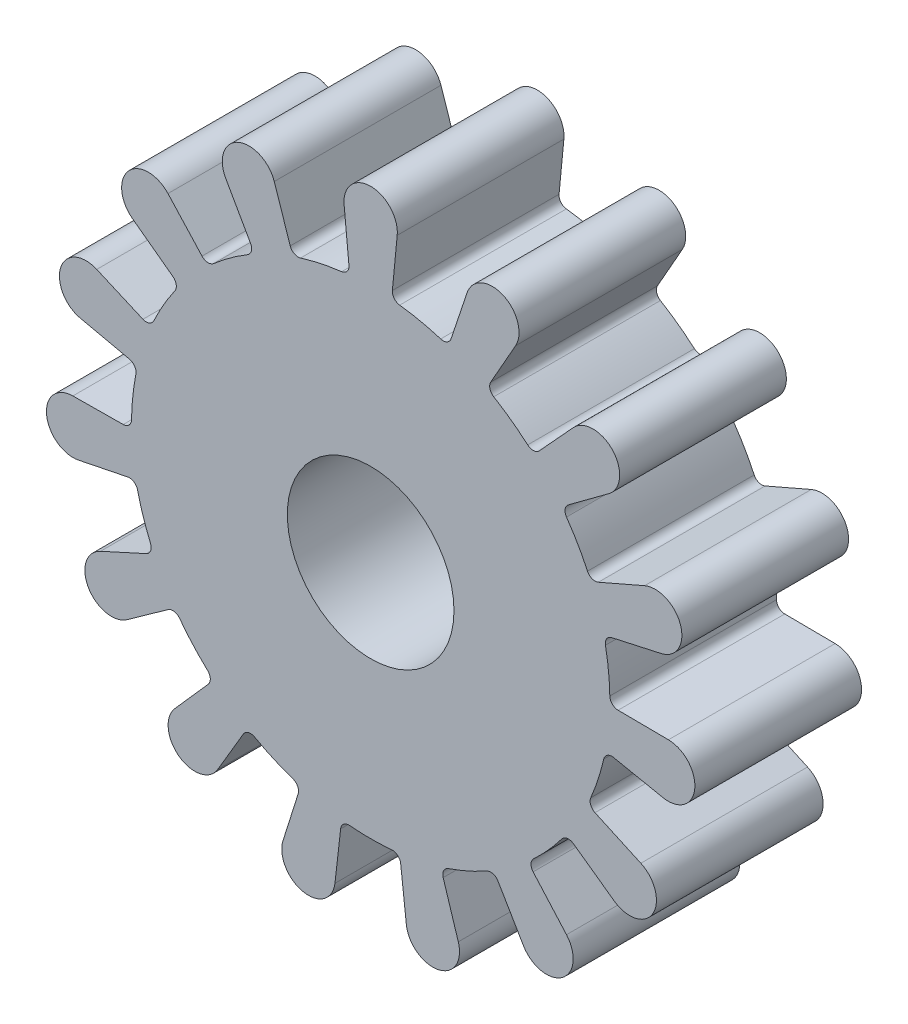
ISO-10303-21;
HEADER;
FILE_DESCRIPTION(('STEP AP214'),'2;1');
FILE_NAME('part.step','',(''),(''),'','','');
FILE_SCHEMA(('AUTOMOTIVE_DESIGN { 1 0 10303 214 1 1 1 1 }'));
ENDSEC;
DATA;
#1=APPLICATION_CONTEXT('core data for automotive mechanical design processes');
#2=APPLICATION_PROTOCOL_DEFINITION('international standard','automotive_design',2000,#1);
#3=PRODUCT_CONTEXT('',#1,'mechanical');
#4=PRODUCT('Part','Part','',(#3));
#5=PRODUCT_RELATED_PRODUCT_CATEGORY('part','',(#4));
#6=PRODUCT_DEFINITION_FORMATION('','',#4);
#7=PRODUCT_DEFINITION_CONTEXT('part definition',#1,'design');
#8=PRODUCT_DEFINITION('design','',#6,#7);
#9=PRODUCT_DEFINITION_SHAPE('','',#8);
#10=(LENGTH_UNIT() NAMED_UNIT(*) SI_UNIT(.MILLI.,.METRE.));
#11=(NAMED_UNIT(*) PLANE_ANGLE_UNIT() SI_UNIT($,.RADIAN.));
#12=(NAMED_UNIT(*) SI_UNIT($,.STERADIAN.) SOLID_ANGLE_UNIT());
#13=UNCERTAINTY_MEASURE_WITH_UNIT(LENGTH_MEASURE(1.E-05),#10,'distance_accuracy_value','');
#14=(GEOMETRIC_REPRESENTATION_CONTEXT(3) GLOBAL_UNCERTAINTY_ASSIGNED_CONTEXT((#13)) GLOBAL_UNIT_ASSIGNED_CONTEXT((#10,
#11,#12)) REPRESENTATION_CONTEXT('',''));
#15=CARTESIAN_POINT('',(0.,0.,0.));
#16=DIRECTION('',(0.,0.,1.));
#17=DIRECTION('',(1.,0.,0.));
#18=AXIS2_PLACEMENT_3D('',#15,#16,#17);
#19=CARTESIAN_POINT('',(-13.4625401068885,6.26757639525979,10.));
#20=DIRECTION('',(0.,0.,1.));
#21=DIRECTION('',(1.,0.,0.));
#22=AXIS2_PLACEMENT_3D('',#19,#20,#21);
#23=PLANE('',#22);
#24=CARTESIAN_POINT('',(-13.4625401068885,6.26757639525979,10.));
#25=DIRECTION('',(0.,0.,-1.));
#26=DIRECTION('',(1.,0.,0.));
#27=AXIS2_PLACEMENT_3D('',#24,#25,#26);
#28=CIRCLE('',#27,0.500000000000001);
#29=CARTESIAN_POINT('',(-13.0092559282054,6.05654688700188,10.));
#30=VERTEX_POINT('',#29);
#31=CARTESIAN_POINT('',(-13.6619146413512,5.80904635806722,10.));
#32=VERTEX_POINT('',#31);
#33=EDGE_CURVE('E799',#30,#32,#28,.T.);
#34=ORIENTED_EDGE('',*,*,#33,.T.);
#35=DIRECTION('',(-0.917060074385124,0.398749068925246,0.));
#36=VECTOR('',#35,1.);
#37=CARTESIAN_POINT('',(-16.4334659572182,7.01415116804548,10.));
#38=LINE('',#37,#36);
#39=CARTESIAN_POINT('',(-16.4334659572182,7.01415116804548,10.));
#40=VERTEX_POINT('',#39);
#41=EDGE_CURVE('E337',#32,#40,#38,.T.);
#42=ORIENTED_EDGE('',*,*,#41,.T.);
#43=CARTESIAN_POINT('',(-17.0714644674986,5.54685504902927,10.));
#44=DIRECTION('',(0.,0.,1.));
#45=DIRECTION('',(1.,0.,0.));
#46=AXIS2_PLACEMENT_3D('',#43,#44,#45);
#47=CIRCLE('',#46,1.6);
#48=CARTESIAN_POINT('',(-17.4177678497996,3.98478143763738,10.));
#49=VERTEX_POINT('',#48);
#50=EDGE_CURVE('E1060',#40,#49,#47,.T.);
#51=ORIENTED_EDGE('',*,*,#50,.T.);
#52=DIRECTION('',(0.976296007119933,-0.216439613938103,0.));
#53=VECTOR('',#52,1.);
#54=CARTESIAN_POINT('',(-17.4177678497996,3.98478143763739,10.));
#55=LINE('',#54,#53);
#56=CARTESIAN_POINT('',(-14.4671928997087,3.33065471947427,10.));
#57=VERTEX_POINT('',#56);
#58=EDGE_CURVE('E1079',#49,#57,#55,.T.);
#59=ORIENTED_EDGE('',*,*,#58,.T.);
#60=CARTESIAN_POINT('',(-14.5754127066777,2.8425067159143,10.));
#61=DIRECTION('',(0.,0.,-1.));
#62=DIRECTION('',(-1.,0.,0.));
#63=AXIS2_PLACEMENT_3D('',#60,#61,#62);
#64=CIRCLE('',#63,0.500000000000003);
#65=CARTESIAN_POINT('',(-14.0846580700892,2.74679941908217,10.));
#66=VERTEX_POINT('',#65);
#67=EDGE_CURVE('E1076',#57,#66,#64,.T.);
#68=ORIENTED_EDGE('',*,*,#67,.T.);
#69=CARTESIAN_POINT('',(0.,0.,10.));
#70=DIRECTION('',(0.,0.,1.));
#71=DIRECTION('',(1.,0.,0.));
#72=AXIS2_PLACEMENT_3D('',#69,#70,#71);
#73=CIRCLE('',#72,14.35);
#74=CARTESIAN_POINT('',(-14.3479662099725,0.241589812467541,10.));
#75=VERTEX_POINT('',#74);
#76=EDGE_CURVE('E1078',#66,#75,#73,.T.);
#77=ORIENTED_EDGE('',*,*,#76,.T.);
#78=CARTESIAN_POINT('',(-14.8478953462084,0.250007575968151,10.));
#79=DIRECTION('',(0.,0.,-1.));
#80=DIRECTION('',(1.,0.,0.));
#81=AXIS2_PLACEMENT_3D('',#78,#79,#80);
#82=CIRCLE('',#81,0.5);
#83=CARTESIAN_POINT('',(-14.8435320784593,-0.249973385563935,10.));
#84=VERTEX_POINT('',#83);
#85=EDGE_CURVE('E1081',#75,#84,#82,.T.);
#86=ORIENTED_EDGE('',*,*,#85,.T.);
#87=DIRECTION('',(-0.999961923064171,-0.00872653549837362,0.));
#88=VECTOR('',#87,1.);
#89=CARTESIAN_POINT('',(-17.8656304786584,-0.276346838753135,10.));
#90=LINE('',#89,#88);
#91=CARTESIAN_POINT('',(-17.8656304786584,-0.276346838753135,10.));
#92=VERTEX_POINT('',#91);
#93=EDGE_CURVE('E1087',#84,#92,#90,.T.);
#94=ORIENTED_EDGE('',*,*,#93,.T.);
#95=CARTESIAN_POINT('',(-17.851668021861,-1.87628591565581,10.));
#96=DIRECTION('',(0.,0.,1.));
#97=DIRECTION('',(1.,0.,0.));
#98=AXIS2_PLACEMENT_3D('',#95,#96,#97);
#99=CIRCLE('',#98,1.6);
#100=CARTESIAN_POINT('',(-17.5326793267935,-3.44416544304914,10.));
#101=VERTEX_POINT('',#100);
#102=EDGE_CURVE('E1089',#92,#101,#99,.T.);
#103=ORIENTED_EDGE('',*,*,#102,.T.);
#104=DIRECTION('',(0.97992470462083,0.199367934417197,0.));
#105=VECTOR('',#104,1.);
#106=CARTESIAN_POINT('',(-17.5326793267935,-3.44416544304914,10.));
#107=LINE('',#106,#105);
#108=CARTESIAN_POINT('',(-14.5711376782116,-2.84163298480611,10.));
#109=VERTEX_POINT('',#108);
#110=EDGE_CURVE('E1091',#101,#109,#107,.T.);
#111=ORIENTED_EDGE('',*,*,#110,.T.);
#112=CARTESIAN_POINT('',(-14.471453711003,-3.33159533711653,10.));
#113=DIRECTION('',(0.,0.,-1.));
#114=DIRECTION('',(-1.,0.,0.));
#115=AXIS2_PLACEMENT_3D('',#112,#113,#114);
#116=CIRCLE('',#115,0.500000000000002);
#117=CARTESIAN_POINT('',(-13.9841993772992,-3.21942040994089,10.));
#118=VERTEX_POINT('',#117);
#119=EDGE_CURVE('E1093',#109,#118,#116,.T.);
#120=ORIENTED_EDGE('',*,*,#119,.T.);
#121=CARTESIAN_POINT('',(0.,0.,10.));
#122=DIRECTION('',(0.,0.,1.));
#123=DIRECTION('',(1.,0.,0.));
#124=AXIS2_PLACEMENT_3D('',#121,#122,#123);
#125=CIRCLE('',#124,14.35);
#126=CARTESIAN_POINT('',(-13.2057827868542,-5.61514033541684,10.));
#127=VERTEX_POINT('',#126);
#128=EDGE_CURVE('E1095',#118,#127,#125,.T.);
#129=ORIENTED_EDGE('',*,*,#128,.T.);
#130=CARTESIAN_POINT('',(-13.6659145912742,-5.81078982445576,10.));
#131=DIRECTION('',(0.,0.,-1.));
#132=DIRECTION('',(1.,0.,0.));
#133=AXIS2_PLACEMENT_3D('',#130,#131,#132);
#134=CIRCLE('',#133,0.500000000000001);
#135=CARTESIAN_POINT('',(-13.4585679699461,-6.26577045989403,10.));
#136=VERTEX_POINT('',#135);
#137=EDGE_CURVE('E1097',#127,#136,#134,.T.);
#138=ORIENTED_EDGE('',*,*,#137,.T.);
#139=DIRECTION('',(-0.909961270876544,-0.414693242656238,0.));
#140=VECTOR('',#139,1.);
#141=CARTESIAN_POINT('',(-16.2086651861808,-7.51906196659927,10.));
#142=LINE('',#141,#140);
#143=CARTESIAN_POINT('',(-16.2086651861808,-7.51906196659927,10.));
#144=VERTEX_POINT('',#143);
#145=EDGE_CURVE('E1099',#136,#144,#142,.T.);
#146=ORIENTED_EDGE('',*,*,#145,.T.);
#147=CARTESIAN_POINT('',(-15.5451559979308,-8.97500000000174,10.));
#148=DIRECTION('',(0.,0.,1.));
#149=DIRECTION('',(1.,0.,0.));
#150=AXIS2_PLACEMENT_3D('',#147,#148,#149);
#151=CIRCLE('',#150,1.6);
#152=CARTESIAN_POINT('',(-14.6160312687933,-10.2775848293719,10.));
#153=VERTEX_POINT('',#152);
#154=EDGE_CURVE('E1101',#144,#153,#151,.T.);
#155=ORIENTED_EDGE('',*,*,#154,.T.);
#156=DIRECTION('',(0.814115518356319,0.58070295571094,0.));
#157=VECTOR('',#156,1.);
#158=CARTESIAN_POINT('',(-14.6160312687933,-10.2775848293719,10.));
#159=LINE('',#158,#157);
#160=CARTESIAN_POINT('',(-12.1556003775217,-8.52257653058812,10.));
#161=VERTEX_POINT('',#160);
#162=EDGE_CURVE('E1103',#153,#161,#159,.T.);
#163=ORIENTED_EDGE('',*,*,#162,.T.);
#164=CARTESIAN_POINT('',(-11.8652488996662,-8.92963428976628,10.));
#165=DIRECTION('',(0.,0.,-1.));
#166=DIRECTION('',(-1.,0.,0.));
#167=AXIS2_PLACEMENT_3D('',#164,#165,#166);
#168=CIRCLE('',#167,0.500000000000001);
#169=CARTESIAN_POINT('',(-11.4657455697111,-8.62897320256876,10.));
#170=VERTEX_POINT('',#169);
#171=EDGE_CURVE('E1105',#161,#170,#168,.T.);
#172=ORIENTED_EDGE('',*,*,#171,.T.);
#173=CARTESIAN_POINT('',(0.,0.,10.));
#174=DIRECTION('',(0.,0.,1.));
#175=DIRECTION('',(1.,0.,0.));
#176=AXIS2_PLACEMENT_3D('',#173,#174,#175);
#177=CIRCLE('',#176,14.35);
#178=CARTESIAN_POINT('',(-9.7801995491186,-10.500961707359,10.));
#179=VERTEX_POINT('',#178);
#180=EDGE_CURVE('E1107',#170,#179,#177,.T.);
#181=ORIENTED_EDGE('',*,*,#180,.T.);
#182=CARTESIAN_POINT('',(-10.1209730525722,-10.8668488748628,10.));
#183=DIRECTION('',(0.,0.,-1.));
#184=DIRECTION('',(1.,0.,0.));
#185=AXIS2_PLACEMENT_3D('',#182,#183,#184);
#186=CIRCLE('',#185,0.500000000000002);
#187=CARTESIAN_POINT('',(-9.74649519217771,-11.1981588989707,10.));
#188=VERTEX_POINT('',#187);
#189=EDGE_CURVE('E1109',#179,#188,#186,.T.);
#190=ORIENTED_EDGE('',*,*,#189,.T.);
#191=DIRECTION('',(-0.662620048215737,-0.748955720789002,0.));
#192=VECTOR('',#191,1.);
#193=CARTESIAN_POINT('',(-11.7490744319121,-13.461662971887,10.));
#194=LINE('',#193,#192);
#195=CARTESIAN_POINT('',(-11.7490744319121,-13.461662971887,10.));
#196=VERTEX_POINT('',#195);
#197=EDGE_CURVE('E1111',#188,#196,#194,.T.);
#198=ORIENTED_EDGE('',*,*,#197,.T.);
#199=CARTESIAN_POINT('',(-10.5507452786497,-14.5218550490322,10.));
#200=DIRECTION('',(0.,0.,1.));
#201=DIRECTION('',(1.,0.,0.));
#202=AXIS2_PLACEMENT_3D('',#199,#200,#201);
#203=CIRCLE('',#202,1.6);
#204=CARTESIAN_POINT('',(-9.17213862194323,-15.3339164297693,10.));
#205=VERTEX_POINT('',#204);
#206=EDGE_CURVE('E1113',#196,#205,#203,.T.);
#207=ORIENTED_EDGE('',*,*,#206,.T.);
#208=DIRECTION('',(0.507538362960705,0.861629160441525,0.));
#209=VECTOR('',#208,1.);
#210=CARTESIAN_POINT('',(-9.17213862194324,-15.3339164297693,10.));
#211=LINE('',#210,#209);
#212=CARTESIAN_POINT('',(-7.63824934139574,-12.7298891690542,10.));
#213=VERTEX_POINT('',#212);
#214=EDGE_CURVE('E1115',#205,#213,#211,.T.);
#215=ORIENTED_EDGE('',*,*,#214,.T.);
#216=CARTESIAN_POINT('',(-7.20743476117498,-12.9836583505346,10.));
#217=DIRECTION('',(0.,0.,-1.));
#218=DIRECTION('',(-1.,0.,0.));
#219=AXIS2_PLACEMENT_3D('',#216,#217,#218);
#220=CIRCLE('',#219,0.499999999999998);
#221=CARTESIAN_POINT('',(-6.96476019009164,-12.5464981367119,10.));
#222=VERTEX_POINT('',#221);
#223=EDGE_CURVE('E1117',#213,#222,#220,.T.);
#224=ORIENTED_EDGE('',*,*,#223,.T.);
#225=CARTESIAN_POINT('',(0.,0.,10.));
#226=DIRECTION('',(0.,0.,1.));
#227=DIRECTION('',(1.,0.,0.));
#228=AXIS2_PLACEMENT_3D('',#225,#226,#227);
#229=CIRCLE('',#228,14.35);
#230=CARTESIAN_POINT('',(-4.663530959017,-13.5710714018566,10.));
#231=VERTEX_POINT('',#230);
#232=EDGE_CURVE('E1119',#222,#231,#229,.T.);
#233=ORIENTED_EDGE('',*,*,#232,.T.);
#234=CARTESIAN_POINT('',(-4.826023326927,-14.0439310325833,10.));
#235=DIRECTION('',(0.,0.,-1.));
#236=DIRECTION('',(1.,0.,0.));
#237=AXIS2_PLACEMENT_3D('',#234,#235,#236);
#238=CIRCLE('',#237,0.5);
#239=CARTESIAN_POINT('',(-4.34916485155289,-14.1942839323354,10.));
#240=VERTEX_POINT('',#239);
#241=EDGE_CURVE('E1121',#231,#240,#238,.T.);
#242=ORIENTED_EDGE('',*,*,#241,.T.);
#243=DIRECTION('',(-0.300705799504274,-0.953716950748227,0.));
#244=VECTOR('',#243,1.);
#245=CARTESIAN_POINT('',(-5.25796197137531,-17.0766201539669,10.));
#246=LINE('',#245,#244);
#247=CARTESIAN_POINT('',(-5.25796197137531,-17.0766201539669,10.));
#248=VERTEX_POINT('',#247);
#249=EDGE_CURVE('E1123',#240,#248,#246,.T.);
#250=ORIENTED_EDGE('',*,*,#249,.T.);
#251=CARTESIAN_POINT('',(-3.73201485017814,-17.5577494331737,10.));
#252=DIRECTION('',(0.,0.,1.));
#253=DIRECTION('',(1.,0.,0.));
#254=AXIS2_PLACEMENT_3D('',#251,#252,#253);
#255=CIRCLE('',#254,1.6);
#256=CARTESIAN_POINT('',(-2.1422998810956,-17.7388745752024,10.));
#257=VERTEX_POINT('',#256);
#258=EDGE_CURVE('E1125',#248,#257,#255,.T.);
#259=ORIENTED_EDGE('',*,*,#258,.T.);
#260=DIRECTION('',(0.113203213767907,0.993571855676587,0.));
#261=VECTOR('',#260,1.);
#262=CARTESIAN_POINT('',(-2.1422998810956,-17.7388745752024,10.));
#263=LINE('',#262,#261);
#264=CARTESIAN_POINT('',(-1.80017560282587,-14.7360883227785,10.));
#265=VERTEX_POINT('',#264);
#266=EDGE_CURVE('E1127',#257,#265,#263,.T.);
#267=ORIENTED_EDGE('',*,*,#266,.T.);
#268=CARTESIAN_POINT('',(-1.30338967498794,-14.7926899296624,10.));
#269=DIRECTION('',(0.,0.,-1.));
#270=DIRECTION('',(-1.,0.,0.));
#271=AXIS2_PLACEMENT_3D('',#268,#269,#270);
#272=CIRCLE('',#271,0.499999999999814);
#273=CARTESIAN_POINT('',(-1.25950450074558,-14.2946195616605,10.));
#274=VERTEX_POINT('',#273);
#275=EDGE_CURVE('E1129',#265,#274,#272,.T.);
#276=ORIENTED_EDGE('',*,*,#275,.T.);
#277=CARTESIAN_POINT('',(0.,0.,10.));
#278=DIRECTION('',(0.,0.,1.));
#279=DIRECTION('',(1.,0.,0.));
#280=AXIS2_PLACEMENT_3D('',#277,#278,#279);
#281=CIRCLE('',#280,14.35);
#282=CARTESIAN_POINT('',(1.25950450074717,-14.2946195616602,10.));
#283=VERTEX_POINT('',#282);
#284=EDGE_CURVE('E1131',#274,#283,#281,.T.);
#285=ORIENTED_EDGE('',*,*,#284,.T.);
#286=CARTESIAN_POINT('',(1.3033896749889,-14.7926899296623,10.));
#287=DIRECTION('',(0.,0.,-1.));
#288=DIRECTION('',(1.,0.,0.));
#289=AXIS2_PLACEMENT_3D('',#286,#287,#288);
#290=CIRCLE('',#289,0.500000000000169);
#291=CARTESIAN_POINT('',(1.80017560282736,-14.7360883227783,10.));
#292=VERTEX_POINT('',#291);
#293=EDGE_CURVE('E1133',#283,#292,#290,.T.);
#294=ORIENTED_EDGE('',*,*,#293,.T.);
#295=DIRECTION('',(0.113203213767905,-0.993571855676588,0.));
#296=VECTOR('',#295,1.);
#297=CARTESIAN_POINT('',(2.14229988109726,-17.7388745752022,10.));
#298=LINE('',#297,#296);
#299=CARTESIAN_POINT('',(2.14229988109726,-17.7388745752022,10.));
#300=VERTEX_POINT('',#299);
#301=EDGE_CURVE('E1135',#292,#300,#298,.T.);
#302=ORIENTED_EDGE('',*,*,#301,.T.);
#303=CARTESIAN_POINT('',(3.7320148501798,-17.5577494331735,10.));
#304=DIRECTION('',(0.,0.,1.));
#305=DIRECTION('',(1.,0.,0.));
#306=AXIS2_PLACEMENT_3D('',#303,#304,#305);
#307=CIRCLE('',#306,1.6);
#308=CARTESIAN_POINT('',(5.25796197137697,-17.0766201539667,10.));
#309=VERTEX_POINT('',#308);
#310=EDGE_CURVE('E1137',#300,#309,#307,.T.);
#311=ORIENTED_EDGE('',*,*,#310,.T.);
#312=DIRECTION('',(-0.300705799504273,0.953716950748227,0.));
#313=VECTOR('',#312,1.);
#314=CARTESIAN_POINT('',(5.25796197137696,-17.0766201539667,10.));
#315=LINE('',#314,#313);
#316=CARTESIAN_POINT('',(4.34916485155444,-14.1942839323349,10.));
#317=VERTEX_POINT('',#316);
#318=EDGE_CURVE('E1139',#309,#317,#315,.T.);
#319=ORIENTED_EDGE('',*,*,#318,.T.);
#320=CARTESIAN_POINT('',(4.82602332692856,-14.0439310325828,10.));
#321=DIRECTION('',(0.,0.,-1.));
#322=DIRECTION('',(-1.,0.,0.));
#323=AXIS2_PLACEMENT_3D('',#320,#321,#322);
#324=CIRCLE('',#323,0.500000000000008);
#325=CARTESIAN_POINT('',(4.66353095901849,-13.5710714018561,10.));
#326=VERTEX_POINT('',#325);
#327=EDGE_CURVE('E1141',#317,#326,#324,.T.);
#328=ORIENTED_EDGE('',*,*,#327,.T.);
#329=CARTESIAN_POINT('',(0.,0.,10.));
#330=DIRECTION('',(0.,0.,1.));
#331=DIRECTION('',(1.,0.,0.));
#332=AXIS2_PLACEMENT_3D('',#329,#330,#331);
#333=CIRCLE('',#332,14.35);
#334=CARTESIAN_POINT('',(6.96476019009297,-12.5464981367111,10.));
#335=VERTEX_POINT('',#334);
#336=EDGE_CURVE('E1143',#326,#335,#333,.T.);
#337=ORIENTED_EDGE('',*,*,#336,.T.);
#338=CARTESIAN_POINT('',(7.20743476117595,-12.983658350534,10.));
#339=DIRECTION('',(0.,0.,-1.));
#340=DIRECTION('',(1.,0.,0.));
#341=AXIS2_PLACEMENT_3D('',#338,#339,#340);
#342=CIRCLE('',#341,0.500000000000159);
#343=CARTESIAN_POINT('',(7.6382493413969,-12.7298891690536,10.));
#344=VERTEX_POINT('',#343);
#345=EDGE_CURVE('E1145',#335,#344,#342,.T.);
#346=ORIENTED_EDGE('',*,*,#345,.T.);
#347=DIRECTION('',(0.507538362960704,-0.861629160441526,0.));
#348=VECTOR('',#347,1.);
#349=CARTESIAN_POINT('',(9.17213862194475,-15.3339164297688,10.));
#350=LINE('',#349,#348);
#351=CARTESIAN_POINT('',(9.17213862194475,-15.3339164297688,10.));
#352=VERTEX_POINT('',#351);
#353=EDGE_CURVE('E1147',#344,#352,#350,.T.);
#354=ORIENTED_EDGE('',*,*,#353,.T.);
#355=CARTESIAN_POINT('',(10.5507452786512,-14.5218550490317,10.));
#356=DIRECTION('',(0.,0.,1.));
#357=DIRECTION('',(1.,0.,0.));
#358=AXIS2_PLACEMENT_3D('',#355,#356,#357);
#359=CIRCLE('',#358,1.6);
#360=CARTESIAN_POINT('',(11.7490744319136,-13.4616629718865,10.));
#361=VERTEX_POINT('',#360);
#362=EDGE_CURVE('E1149',#352,#361,#359,.T.);
#363=ORIENTED_EDGE('',*,*,#362,.T.);
#364=DIRECTION('',(-0.662620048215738,0.748955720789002,0.));
#365=VECTOR('',#364,1.);
#366=CARTESIAN_POINT('',(11.7490744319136,-13.4616629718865,10.));
#367=LINE('',#366,#365);
#368=CARTESIAN_POINT('',(9.74649519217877,-11.1981588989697,10.));
#369=VERTEX_POINT('',#368);
#370=EDGE_CURVE('E1151',#361,#369,#367,.T.);
#371=ORIENTED_EDGE('',*,*,#370,.T.);
#372=CARTESIAN_POINT('',(10.1209730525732,-10.8668488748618,10.));
#373=DIRECTION('',(0.,0.,-1.));
#374=DIRECTION('',(-1.,0.,0.));
#375=AXIS2_PLACEMENT_3D('',#372,#373,#374);
#376=CIRCLE('',#375,0.499999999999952);
#377=CARTESIAN_POINT('',(9.78019954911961,-10.500961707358,10.));
#378=VERTEX_POINT('',#377);
#379=EDGE_CURVE('E1153',#369,#378,#376,.T.);
#380=ORIENTED_EDGE('',*,*,#379,.T.);
#381=CARTESIAN_POINT('',(0.,0.,10.));
#382=DIRECTION('',(0.,0.,1.));
#383=DIRECTION('',(1.,0.,0.));
#384=AXIS2_PLACEMENT_3D('',#381,#382,#383);
#385=CIRCLE('',#384,14.35);
#386=CARTESIAN_POINT('',(11.4657455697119,-8.62897320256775,10.));
#387=VERTEX_POINT('',#386);
#388=EDGE_CURVE('E1155',#378,#387,#385,.T.);
#389=ORIENTED_EDGE('',*,*,#388,.T.);
#390=CARTESIAN_POINT('',(11.8652488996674,-8.92963428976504,10.));
#391=DIRECTION('',(0.,0.,-1.));
#392=DIRECTION('',(1.,0.,0.));
#393=AXIS2_PLACEMENT_3D('',#390,#391,#392);
#394=CIRCLE('',#393,0.499999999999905);
#395=CARTESIAN_POINT('',(12.1556003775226,-8.52257653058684,10.));
#396=VERTEX_POINT('',#395);
#397=EDGE_CURVE('E1157',#387,#396,#394,.T.);
#398=ORIENTED_EDGE('',*,*,#397,.T.);
#399=DIRECTION('',(0.814115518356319,-0.58070295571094,0.));
#400=VECTOR('',#399,1.);
#401=CARTESIAN_POINT('',(14.6160312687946,-10.2775848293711,10.));
#402=LINE('',#401,#400);
#403=CARTESIAN_POINT('',(14.6160312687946,-10.2775848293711,10.));
#404=VERTEX_POINT('',#403);
#405=EDGE_CURVE('E1159',#396,#404,#402,.T.);
#406=ORIENTED_EDGE('',*,*,#405,.T.);
#407=CARTESIAN_POINT('',(15.5451559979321,-8.975000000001,10.));
#408=DIRECTION('',(0.,0.,1.));
#409=DIRECTION('',(1.,0.,0.));
#410=AXIS2_PLACEMENT_3D('',#407,#408,#409);
#411=CIRCLE('',#410,1.6);
#412=CARTESIAN_POINT('',(16.2086651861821,-7.51906196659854,10.));
#413=VERTEX_POINT('',#412);
#414=EDGE_CURVE('E1161',#404,#413,#411,.T.);
#415=ORIENTED_EDGE('',*,*,#414,.T.);
#416=DIRECTION('',(-0.909961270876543,0.41469324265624,0.));
#417=VECTOR('',#416,1.);
#418=CARTESIAN_POINT('',(16.2086651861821,-7.51906196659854,10.));
#419=LINE('',#418,#417);
#420=CARTESIAN_POINT('',(13.4585679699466,-6.26577045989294,10.));
#421=VERTEX_POINT('',#420);
#422=EDGE_CURVE('E1163',#413,#421,#419,.T.);
#423=ORIENTED_EDGE('',*,*,#422,.T.);
#424=CARTESIAN_POINT('',(13.6659145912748,-5.81078982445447,10.));
#425=DIRECTION('',(0.,0.,-1.));
#426=DIRECTION('',(-1.,0.,0.));
#427=AXIS2_PLACEMENT_3D('',#424,#425,#426);
#428=CIRCLE('',#427,0.500000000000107);
#429=CARTESIAN_POINT('',(13.2057827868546,-5.61514033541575,10.));
#430=VERTEX_POINT('',#429);
#431=EDGE_CURVE('E1165',#421,#430,#428,.T.);
#432=ORIENTED_EDGE('',*,*,#431,.T.);
#433=CARTESIAN_POINT('',(0.,0.,10.));
#434=DIRECTION('',(0.,0.,1.));
#435=DIRECTION('',(1.,0.,0.));
#436=AXIS2_PLACEMENT_3D('',#433,#434,#435);
#437=CIRCLE('',#436,14.35);
#438=CARTESIAN_POINT('',(13.9841993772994,-3.21942040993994,10.));
#439=VERTEX_POINT('',#438);
#440=EDGE_CURVE('E1167',#430,#439,#437,.T.);
#441=ORIENTED_EDGE('',*,*,#440,.T.);
#442=CARTESIAN_POINT('',(14.4714537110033,-3.3315953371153,10.));
#443=DIRECTION('',(0.,0.,-1.));
#444=DIRECTION('',(1.,0.,0.));
#445=AXIS2_PLACEMENT_3D('',#442,#443,#444);
#446=CIRCLE('',#445,0.499999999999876);
#447=CARTESIAN_POINT('',(14.5711376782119,-2.84163298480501,10.));
#448=VERTEX_POINT('',#447);
#449=EDGE_CURVE('E1169',#439,#448,#446,.T.);
#450=ORIENTED_EDGE('',*,*,#449,.T.);
#451=DIRECTION('',(0.97992470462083,-0.199367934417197,0.));
#452=VECTOR('',#451,1.);
#453=CARTESIAN_POINT('',(17.5326793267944,-3.4441654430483,10.));
#454=LINE('',#453,#452);
#455=CARTESIAN_POINT('',(17.5326793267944,-3.4441654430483,10.));
#456=VERTEX_POINT('',#455);
#457=EDGE_CURVE('E1171',#448,#456,#454,.T.);
#458=ORIENTED_EDGE('',*,*,#457,.T.);
#459=CARTESIAN_POINT('',(17.8516680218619,-1.87628591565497,10.));
#460=DIRECTION('',(0.,0.,1.));
#461=DIRECTION('',(1.,0.,0.));
#462=AXIS2_PLACEMENT_3D('',#459,#460,#461);
#463=CIRCLE('',#462,1.6);
#464=CARTESIAN_POINT('',(17.8656304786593,-0.276346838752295,10.));
#465=VERTEX_POINT('',#464);
#466=EDGE_CURVE('E1173',#456,#465,#463,.T.);
#467=ORIENTED_EDGE('',*,*,#466,.T.);
#468=DIRECTION('',(-0.999961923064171,0.00872653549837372,0.));
#469=VECTOR('',#468,1.);
#470=CARTESIAN_POINT('',(17.8656304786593,-0.2763468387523,10.));
#471=LINE('',#470,#469);
#472=CARTESIAN_POINT('',(14.8435320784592,-0.249973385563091,10.));
#473=VERTEX_POINT('',#472);
#474=EDGE_CURVE('E1175',#465,#473,#471,.T.);
#475=ORIENTED_EDGE('',*,*,#474,.T.);
#476=CARTESIAN_POINT('',(14.8478953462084,0.250007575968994,10.));
#477=DIRECTION('',(0.,0.,-1.));
#478=DIRECTION('',(-1.,0.,0.));
#479=AXIS2_PLACEMENT_3D('',#476,#477,#478);
#480=CIRCLE('',#479,0.5);
#481=CARTESIAN_POINT('',(14.3479662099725,0.241589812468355,10.));
#482=VERTEX_POINT('',#481);
#483=EDGE_CURVE('E1177',#473,#482,#480,.T.);
#484=ORIENTED_EDGE('',*,*,#483,.T.);
#485=CARTESIAN_POINT('',(0.,0.,10.));
#486=DIRECTION('',(0.,0.,1.));
#487=DIRECTION('',(1.,0.,0.));
#488=AXIS2_PLACEMENT_3D('',#485,#486,#487);
#489=CIRCLE('',#488,14.35);
#490=CARTESIAN_POINT('',(14.0846580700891,2.7467994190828,10.));
#491=VERTEX_POINT('',#490);
#492=EDGE_CURVE('E1179',#482,#491,#489,.T.);
#493=ORIENTED_EDGE('',*,*,#492,.T.);
#494=CARTESIAN_POINT('',(14.5754127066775,2.84250671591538,10.));
#495=DIRECTION('',(0.,0.,-1.));
#496=DIRECTION('',(1.,0.,0.));
#497=AXIS2_PLACEMENT_3D('',#494,#495,#496);
#498=CIRCLE('',#497,0.499999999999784);
#499=CARTESIAN_POINT('',(14.4671928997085,3.33065471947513,10.));
#500=VERTEX_POINT('',#499);
#501=EDGE_CURVE('E1181',#491,#500,#498,.T.);
#502=ORIENTED_EDGE('',*,*,#501,.T.);
#503=DIRECTION('',(0.976296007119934,0.216439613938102,0.));
#504=VECTOR('',#503,1.);
#505=CARTESIAN_POINT('',(17.4177678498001,3.98478143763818,10.));
#506=LINE('',#505,#504);
#507=CARTESIAN_POINT('',(17.4177678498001,3.98478143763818,10.));
#508=VERTEX_POINT('',#507);
#509=EDGE_CURVE('E1183',#500,#508,#506,.T.);
#510=ORIENTED_EDGE('',*,*,#509,.T.);
#511=CARTESIAN_POINT('',(17.0714644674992,5.54685504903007,10.));
#512=DIRECTION('',(0.,0.,1.));
#513=DIRECTION('',(1.,0.,0.));
#514=AXIS2_PLACEMENT_3D('',#511,#512,#513);
#515=CIRCLE('',#514,1.6);
#516=CARTESIAN_POINT('',(16.4334659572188,7.01415116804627,10.));
#517=VERTEX_POINT('',#516);
#518=EDGE_CURVE('E1185',#508,#517,#515,.T.);
#519=ORIENTED_EDGE('',*,*,#518,.T.);
#520=DIRECTION('',(-0.917060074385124,-0.398749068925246,0.));
#521=VECTOR('',#520,1.);
#522=CARTESIAN_POINT('',(16.4334659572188,7.01415116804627,10.));
#523=LINE('',#522,#521);
#524=CARTESIAN_POINT('',(13.6619146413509,5.80904635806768,10.));
#525=VERTEX_POINT('',#524);
#526=EDGE_CURVE('E1187',#517,#525,#523,.T.);
#527=ORIENTED_EDGE('',*,*,#526,.T.);
#528=CARTESIAN_POINT('',(13.4625401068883,6.26757639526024,10.));
#529=DIRECTION('',(0.,0.,-1.));
#530=DIRECTION('',(-1.,0.,0.));
#531=AXIS2_PLACEMENT_3D('',#528,#529,#530);
#532=CIRCLE('',#531,0.5);
#533=CARTESIAN_POINT('',(13.0092559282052,6.05654688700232,10.));
#534=VERTEX_POINT('',#533);
#535=EDGE_CURVE('E1189',#525,#534,#532,.T.);
#536=ORIENTED_EDGE('',*,*,#535,.T.);
#537=CARTESIAN_POINT('',(0.,0.,10.));
#538=DIRECTION('',(0.,0.,1.));
#539=DIRECTION('',(1.,0.,0.));
#540=AXIS2_PLACEMENT_3D('',#537,#538,#539);
#541=CIRCLE('',#540,14.35);
#542=CARTESIAN_POINT('',(11.7497514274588,8.23807267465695,10.));
#543=VERTEX_POINT('',#542);
#544=EDGE_CURVE('E1191',#534,#543,#541,.T.);
#545=ORIENTED_EDGE('',*,*,#544,.T.);
#546=CARTESIAN_POINT('',(12.1591504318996,8.52511353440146,10.));
#547=DIRECTION('',(0.,0.,-1.));
#548=DIRECTION('',(1.,0.,0.));
#549=AXIS2_PLACEMENT_3D('',#546,#547,#548);
#550=CIRCLE('',#549,0.499999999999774);
#551=CARTESIAN_POINT('',(11.8617390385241,8.92704196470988,10.));
#552=VERTEX_POINT('',#551);
#553=EDGE_CURVE('E1193',#543,#552,#550,.T.);
#554=ORIENTED_EDGE('',*,*,#553,.T.);
#555=DIRECTION('',(0.803856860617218,0.59482278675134,0.));
#556=VECTOR('',#555,1.);
#557=CARTESIAN_POINT('',(14.2911660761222,10.724723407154,10.));
#558=LINE('',#557,#556);
#559=CARTESIAN_POINT('',(14.2911660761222,10.724723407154,10.));
#560=VERTEX_POINT('',#559);
#561=EDGE_CURVE('E1195',#552,#560,#558,.T.);
#562=ORIENTED_EDGE('',*,*,#561,.T.);
#563=CARTESIAN_POINT('',(13.33944961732,12.0108943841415,10.));
#564=DIRECTION('',(0.,0.,1.));
#565=DIRECTION('',(1.,0.,0.));
#566=AXIS2_PLACEMENT_3D('',#563,#564,#565);
#567=CIRCLE('',#566,1.6);
#568=CARTESIAN_POINT('',(12.1598058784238,13.0918387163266,10.));
#569=VERTEX_POINT('',#568);
#570=EDGE_CURVE('E1197',#560,#569,#567,.T.);
#571=ORIENTED_EDGE('',*,*,#570,.T.);
#572=DIRECTION('',(-0.67559020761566,-0.737277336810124,0.));
#573=VECTOR('',#572,1.);
#574=CARTESIAN_POINT('',(12.1598058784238,13.0918387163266,10.));
#575=LINE('',#574,#573);
#576=CARTESIAN_POINT('',(10.1180280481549,10.8636292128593,10.));
#577=VERTEX_POINT('',#576);
#578=EDGE_CURVE('E1199',#569,#577,#575,.T.);
#579=ORIENTED_EDGE('',*,*,#578,.T.);
#580=CARTESIAN_POINT('',(9.74938937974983,11.2014243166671,10.));
#581=DIRECTION('',(0.,0.,-1.));
#582=DIRECTION('',(-1.,0.,0.));
#583=AXIS2_PLACEMENT_3D('',#580,#581,#582);
#584=CIRCLE('',#583,0.5);
#585=CARTESIAN_POINT('',(9.42112711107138,10.8242719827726,10.));
#586=VERTEX_POINT('',#585);
#587=EDGE_CURVE('E1201',#577,#586,#584,.T.);
#588=ORIENTED_EDGE('',*,*,#587,.T.);
#589=CARTESIAN_POINT('',(0.,0.,10.));
#590=DIRECTION('',(0.,0.,1.));
#591=DIRECTION('',(1.,0.,0.));
#592=AXIS2_PLACEMENT_3D('',#589,#590,#591);
#593=CIRCLE('',#592,14.35);
#594=CARTESIAN_POINT('',(7.38320601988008,12.3049083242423,10.));
#595=VERTEX_POINT('',#594);
#596=EDGE_CURVE('E1203',#586,#595,#593,.T.);
#597=ORIENTED_EDGE('',*,*,#596,.T.);
#598=CARTESIAN_POINT('',(7.64046058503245,12.7336507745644,10.));
#599=DIRECTION('',(0.,0.,-1.));
#600=DIRECTION('',(1.,0.,0.));
#601=AXIS2_PLACEMENT_3D('',#598,#599,#600);
#602=CIRCLE('',#601,0.499999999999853);
#603=CARTESIAN_POINT('',(7.20528273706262,12.9798625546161,10.));
#604=VERTEX_POINT('',#603);
#605=EDGE_CURVE('E1205',#595,#604,#602,.T.);
#606=ORIENTED_EDGE('',*,*,#605,.T.);
#607=DIRECTION('',(0.492423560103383,0.870355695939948,0.));
#608=VECTOR('',#607,1.);
#609=CARTESIAN_POINT('',(8.69349185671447,15.6102632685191,10.));
#610=LINE('',#609,#608);
#611=CARTESIAN_POINT('',(8.69349185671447,15.6102632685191,10.));
#612=VERTEX_POINT('',#611);
#613=EDGE_CURVE('E1207',#604,#612,#610,.T.);
#614=ORIENTED_EDGE('',*,*,#613,.T.);
#615=CARTESIAN_POINT('',(7.30092274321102,16.3981409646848,10.));
#616=DIRECTION('',(0.,0.,1.));
#617=DIRECTION('',(1.,0.,0.));
#618=AXIS2_PLACEMENT_3D('',#615,#616,#617);
#619=CIRCLE('',#618,1.60000000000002);
#620=CARTESIAN_POINT('',(5.78360489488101,16.9058284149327,10.));
#621=VERTEX_POINT('',#620);
#622=EDGE_CURVE('E1209',#612,#621,#619,.T.);
#623=ORIENTED_EDGE('',*,*,#622,.T.);
#624=DIRECTION('',(-0.317304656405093,-0.948323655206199,0.));
#625=VECTOR('',#624,1.);
#626=CARTESIAN_POINT('',(5.78360489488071,16.9058284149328,10.));
#627=LINE('',#626,#625);
#628=CARTESIAN_POINT('',(4.82464248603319,14.0397918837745,10.));
#629=VERTEX_POINT('',#628);
#630=EDGE_CURVE('E1211',#621,#629,#627,.T.);
#631=ORIENTED_EDGE('',*,*,#630,.T.);
#632=CARTESIAN_POINT('',(4.35048065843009,14.1984442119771,10.));
#633=DIRECTION('',(0.,0.,-1.));
#634=DIRECTION('',(-1.,0.,0.));
#635=AXIS2_PLACEMENT_3D('',#632,#633,#634);
#636=CIRCLE('',#635,0.500000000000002);
#637=CARTESIAN_POINT('',(4.20399982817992,13.7203821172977,10.));
#638=VERTEX_POINT('',#637);
#639=EDGE_CURVE('E1213',#629,#638,#636,.T.);
#640=ORIENTED_EDGE('',*,*,#639,.T.);
#641=CARTESIAN_POINT('',(0.,0.,10.));
#642=DIRECTION('',(0.,0.,1.));
#643=DIRECTION('',(1.,0.,0.));
#644=AXIS2_PLACEMENT_3D('',#641,#642,#643);
#645=CIRCLE('',#644,14.35);
#646=CARTESIAN_POINT('',(1.74003721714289,14.2441135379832,10.));
#647=VERTEX_POINT('',#646);
#648=EDGE_CURVE('E1215',#638,#647,#645,.T.);
#649=ORIENTED_EDGE('',*,*,#648,.T.);
#650=CARTESIAN_POINT('',(1.8006656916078,14.7404241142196,10.));
#651=DIRECTION('',(0.,0.,-1.));
#652=DIRECTION('',(1.,0.,0.));
#653=AXIS2_PLACEMENT_3D('',#650,#651,#652);
#654=CIRCLE('',#653,0.499999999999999);
#655=CARTESIAN_POINT('',(1.30296759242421,14.7883469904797,10.));
#656=VERTEX_POINT('',#655);
#657=EDGE_CURVE('E1217',#647,#656,#654,.T.);
#658=ORIENTED_EDGE('',*,*,#657,.T.);
#659=DIRECTION('',(0.0958457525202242,0.995396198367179,0.));
#660=VECTOR('',#659,1.);
#661=CARTESIAN_POINT('',(1.59263391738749,17.7966467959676,10.));
#662=LINE('',#661,#660);
#663=CARTESIAN_POINT('',(1.59263391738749,17.7966467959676,10.));
#664=VERTEX_POINT('',#663);
#665=EDGE_CURVE('E1219',#656,#664,#662,.T.);
#666=ORIENTED_EDGE('',*,*,#665,.T.);
#667=CARTESIAN_POINT('',(0.,17.95,10.));
#668=DIRECTION('',(0.,0.,1.));
#669=DIRECTION('',(1.,0.,0.));
#670=AXIS2_PLACEMENT_3D('',#667,#668,#669);
#671=CIRCLE('',#670,1.6);
#672=CARTESIAN_POINT('',(-1.59263391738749,17.7966467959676,10.));
#673=VERTEX_POINT('',#672);
#674=EDGE_CURVE('E1221',#664,#673,#671,.T.);
#675=ORIENTED_EDGE('',*,*,#674,.T.);
#676=DIRECTION('',(0.0958457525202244,-0.995396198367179,0.));
#677=VECTOR('',#676,1.);
#678=CARTESIAN_POINT('',(-1.59263391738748,17.7966467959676,10.));
#679=LINE('',#678,#677);
#680=CARTESIAN_POINT('',(-1.30296759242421,14.7883469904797,10.));
#681=VERTEX_POINT('',#680);
#682=EDGE_CURVE('E1223',#673,#681,#679,.T.);
#683=ORIENTED_EDGE('',*,*,#682,.T.);
#684=CARTESIAN_POINT('',(-1.8006656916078,14.7404241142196,10.));
#685=DIRECTION('',(0.,0.,-1.));
#686=DIRECTION('',(-1.,0.,0.));
#687=AXIS2_PLACEMENT_3D('',#684,#685,#686);
#688=CIRCLE('',#687,0.500000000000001);
#689=CARTESIAN_POINT('',(-1.74003721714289,14.2441135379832,10.));
#690=VERTEX_POINT('',#689);
#691=EDGE_CURVE('E1225',#681,#690,#688,.T.);
#692=ORIENTED_EDGE('',*,*,#691,.T.);
#693=CARTESIAN_POINT('',(0.,0.,10.));
#694=DIRECTION('',(0.,0.,1.));
#695=DIRECTION('',(1.,0.,0.));
#696=AXIS2_PLACEMENT_3D('',#693,#694,#695);
#697=CIRCLE('',#696,14.35);
#698=CARTESIAN_POINT('',(-4.20399982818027,13.7203821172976,10.));
#699=VERTEX_POINT('',#698);
#700=EDGE_CURVE('E1227',#690,#699,#697,.T.);
#701=ORIENTED_EDGE('',*,*,#700,.T.);
#702=CARTESIAN_POINT('',(-4.35048065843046,14.198444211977,10.));
#703=DIRECTION('',(0.,0.,-1.));
#704=DIRECTION('',(1.,0.,0.));
#705=AXIS2_PLACEMENT_3D('',#702,#703,#704);
#706=CIRCLE('',#705,0.500000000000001);
#707=CARTESIAN_POINT('',(-4.82464248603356,14.0397918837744,10.));
#708=VERTEX_POINT('',#707);
#709=EDGE_CURVE('E1229',#699,#708,#706,.T.);
#710=ORIENTED_EDGE('',*,*,#709,.T.);
#711=DIRECTION('',(-0.317304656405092,0.9483236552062,0.));
#712=VECTOR('',#711,1.);
#713=CARTESIAN_POINT('',(-5.78360489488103,16.9058284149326,10.));
#714=LINE('',#713,#712);
#715=CARTESIAN_POINT('',(-5.78360489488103,16.9058284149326,10.));
#716=VERTEX_POINT('',#715);
#717=EDGE_CURVE('E1231',#708,#716,#714,.T.);
#718=ORIENTED_EDGE('',*,*,#717,.T.);
#719=CARTESIAN_POINT('',(-7.30092274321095,16.3981409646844,10.));
#720=DIRECTION('',(0.,0.,1.));
#721=DIRECTION('',(1.,0.,0.));
#722=AXIS2_PLACEMENT_3D('',#719,#720,#721);
#723=CIRCLE('',#722,1.6);
#724=CARTESIAN_POINT('',(-8.69349185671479,15.6102632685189,10.));
#725=VERTEX_POINT('',#724);
#726=EDGE_CURVE('E1233',#716,#725,#723,.T.);
#727=ORIENTED_EDGE('',*,*,#726,.T.);
#728=DIRECTION('',(0.492423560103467,-0.870355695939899,0.));
#729=VECTOR('',#728,1.);
#730=CARTESIAN_POINT('',(-8.69349185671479,15.6102632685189,10.));
#731=LINE('',#730,#729);
#732=CARTESIAN_POINT('',(-7.20528273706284,12.979862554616,10.));
#733=VERTEX_POINT('',#732);
#734=EDGE_CURVE('E1235',#725,#733,#731,.T.);
#735=ORIENTED_EDGE('',*,*,#734,.T.);
#736=CARTESIAN_POINT('',(-7.64046058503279,12.7336507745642,10.));
#737=DIRECTION('',(0.,0.,-1.));
#738=DIRECTION('',(-1.,0.,0.));
#739=AXIS2_PLACEMENT_3D('',#736,#737,#738);
#740=CIRCLE('',#739,0.500000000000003);
#741=CARTESIAN_POINT('',(-7.38320601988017,12.3049083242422,10.));
#742=VERTEX_POINT('',#741);
#743=EDGE_CURVE('E1237',#733,#742,#740,.T.);
#744=ORIENTED_EDGE('',*,*,#743,.T.);
#745=CARTESIAN_POINT('',(0.,0.,10.));
#746=DIRECTION('',(0.,0.,1.));
#747=DIRECTION('',(1.,0.,0.));
#748=AXIS2_PLACEMENT_3D('',#745,#746,#747);
#749=CIRCLE('',#748,14.35);
#750=CARTESIAN_POINT('',(-9.42112711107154,10.8242719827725,10.));
#751=VERTEX_POINT('',#750);
#752=EDGE_CURVE('E1239',#742,#751,#749,.T.);
#753=ORIENTED_EDGE('',*,*,#752,.T.);
#754=CARTESIAN_POINT('',(-9.74938937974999,11.201424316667,10.));
#755=DIRECTION('',(0.,0.,-1.));
#756=DIRECTION('',(1.,0.,0.));
#757=AXIS2_PLACEMENT_3D('',#754,#755,#756);
#758=CIRCLE('',#757,0.500000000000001);
#759=CARTESIAN_POINT('',(-10.1180280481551,10.8636292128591,10.));
#760=VERTEX_POINT('',#759);
#761=EDGE_CURVE('E1241',#751,#760,#758,.T.);
#762=ORIENTED_EDGE('',*,*,#761,.T.);
#763=DIRECTION('',(-0.67559020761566,0.737277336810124,0.));
#764=VECTOR('',#763,1.);
#765=CARTESIAN_POINT('',(-12.1598058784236,13.091838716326,10.));
#766=LINE('',#765,#764);
#767=CARTESIAN_POINT('',(-12.1598058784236,13.091838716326,10.));
#768=VERTEX_POINT('',#767);
#769=EDGE_CURVE('E1243',#760,#768,#766,.T.);
#770=ORIENTED_EDGE('',*,*,#769,.T.);
#771=CARTESIAN_POINT('',(-13.3394496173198,12.0108943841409,10.));
#772=DIRECTION('',(0.,0.,1.));
#773=DIRECTION('',(1.,0.,0.));
#774=AXIS2_PLACEMENT_3D('',#771,#772,#773);
#775=CIRCLE('',#774,1.6);
#776=CARTESIAN_POINT('',(-14.2911660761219,10.7247234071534,10.));
#777=VERTEX_POINT('',#776);
#778=EDGE_CURVE('E602',#768,#777,#775,.T.);
#779=ORIENTED_EDGE('',*,*,#778,.T.);
#780=DIRECTION('',(0.803856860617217,-0.594822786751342,0.));
#781=VECTOR('',#780,1.);
#782=CARTESIAN_POINT('',(-14.2911660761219,10.7247234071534,10.));
#783=LINE('',#782,#781);
#784=CARTESIAN_POINT('',(-11.8617390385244,8.92704196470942,10.));
#785=VERTEX_POINT('',#784);
#786=EDGE_CURVE('E596',#777,#785,#783,.T.);
#787=ORIENTED_EDGE('',*,*,#786,.T.);
#788=CARTESIAN_POINT('',(-12.1591504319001,8.52511353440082,10.));
#789=DIRECTION('',(0.,0.,-1.));
#790=DIRECTION('',(-1.,0.,0.));
#791=AXIS2_PLACEMENT_3D('',#788,#789,#790);
#792=CIRCLE('',#791,0.499999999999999);
#793=CARTESIAN_POINT('',(-11.749751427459,8.23807267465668,10.));
#794=VERTEX_POINT('',#793);
#795=EDGE_CURVE('E600',#785,#794,#792,.T.);
#796=ORIENTED_EDGE('',*,*,#795,.T.);
#797=CARTESIAN_POINT('',(0.,0.,10.));
#798=DIRECTION('',(0.,0.,1.));
#799=DIRECTION('',(1.,0.,0.));
#800=AXIS2_PLACEMENT_3D('',#797,#798,#799);
#801=CIRCLE('',#800,14.35);
#802=EDGE_CURVE('E48',#794,#30,#801,.T.);
#803=ORIENTED_EDGE('',*,*,#802,.T.);
#804=EDGE_LOOP('',(#34,#42,#51,#59,#68,#77,#86,#94,#103,#111,#120,#129,#138,#146,#155,#163,#172,
#181,#190,#198,#207,#215,#224,#233,#242,#250,#259,#267,#276,#285,#294,#302,#311,#319,#328,#337,
#346,#354,#363,#371,#380,#389,#398,#406,#415,#423,#432,#441,#450,#458,#467,#475,#484,#493,#502,
#510,#519,#527,#536,#545,#554,#562,#571,#579,#588,#597,#606,#614,#623,#631,#640,#649,#658,#666,
#675,#683,#692,#701,#710,#718,#727,#735,#744,#753,#762,#770,#779,#787,#796,#803));
#805=FACE_BOUND('',#804,.T.);
#806=CARTESIAN_POINT('',(0.,0.,10.));
#807=DIRECTION('',(0.,0.,1.));
#808=DIRECTION('',(1.,0.,0.));
#809=AXIS2_PLACEMENT_3D('',#806,#807,#808);
#810=CIRCLE('',#809,5.);
#811=CARTESIAN_POINT('',(5.,0.,10.));
#812=VERTEX_POINT('',#811);
#813=EDGE_CURVE('E624',#812,#812,#810,.T.);
#814=ORIENTED_EDGE('',*,*,#813,.F.);
#815=EDGE_LOOP('',(#814));
#816=FACE_BOUND('',#815,.T.);
#817=ADVANCED_FACE('F31',(#805,#816),#23,.T.);
#818=CARTESIAN_POINT('',(-13.4625401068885,6.26757639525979,0.));
#819=DIRECTION('',(0.,0.,1.));
#820=DIRECTION('',(1.,0.,0.));
#821=AXIS2_PLACEMENT_3D('',#818,#819,#820);
#822=PLANE('',#821);
#823=CARTESIAN_POINT('',(-13.4625401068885,6.26757639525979,0.));
#824=DIRECTION('',(0.,0.,-1.));
#825=DIRECTION('',(1.,0.,0.));
#826=AXIS2_PLACEMENT_3D('',#823,#824,#825);
#827=CIRCLE('',#826,0.500000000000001);
#828=CARTESIAN_POINT('',(-13.0092559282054,6.05654688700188,0.));
#829=VERTEX_POINT('',#828);
#830=CARTESIAN_POINT('',(-13.6619146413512,5.80904635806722,0.));
#831=VERTEX_POINT('',#830);
#832=EDGE_CURVE('E620',#829,#831,#827,.T.);
#833=ORIENTED_EDGE('',*,*,#832,.F.);
#834=CARTESIAN_POINT('',(0.,0.,0.));
#835=DIRECTION('',(0.,0.,1.));
#836=DIRECTION('',(1.,0.,0.));
#837=AXIS2_PLACEMENT_3D('',#834,#835,#836);
#838=CIRCLE('',#837,14.35);
#839=CARTESIAN_POINT('',(-11.749751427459,8.23807267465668,0.));
#840=VERTEX_POINT('',#839);
#841=EDGE_CURVE('E329',#840,#829,#838,.T.);
#842=ORIENTED_EDGE('',*,*,#841,.F.);
#843=CARTESIAN_POINT('',(-12.1591504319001,8.52511353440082,0.));
#844=DIRECTION('',(0.,0.,-1.));
#845=DIRECTION('',(-1.,0.,0.));
#846=AXIS2_PLACEMENT_3D('',#843,#844,#845);
#847=CIRCLE('',#846,0.499999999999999);
#848=CARTESIAN_POINT('',(-11.8617390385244,8.92704196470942,0.));
#849=VERTEX_POINT('',#848);
#850=EDGE_CURVE('E323',#849,#840,#847,.T.);
#851=ORIENTED_EDGE('',*,*,#850,.F.);
#852=DIRECTION('',(0.803856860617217,-0.594822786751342,0.));
#853=VECTOR('',#852,1.);
#854=CARTESIAN_POINT('',(-14.2911660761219,10.7247234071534,0.));
#855=LINE('',#854,#853);
#856=CARTESIAN_POINT('',(-14.2911660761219,10.7247234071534,0.));
#857=VERTEX_POINT('',#856);
#858=EDGE_CURVE('E610',#857,#849,#855,.T.);
#859=ORIENTED_EDGE('',*,*,#858,.F.);
#860=CARTESIAN_POINT('',(-13.3394496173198,12.0108943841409,0.));
#861=DIRECTION('',(0.,0.,1.));
#862=DIRECTION('',(1.,0.,0.));
#863=AXIS2_PLACEMENT_3D('',#860,#861,#862);
#864=CIRCLE('',#863,1.6);
#865=CARTESIAN_POINT('',(-12.1598058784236,13.091838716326,0.));
#866=VERTEX_POINT('',#865);
#867=EDGE_CURVE('E794',#866,#857,#864,.T.);
#868=ORIENTED_EDGE('',*,*,#867,.F.);
#869=DIRECTION('',(-0.67559020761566,0.737277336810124,0.));
#870=VECTOR('',#869,1.);
#871=CARTESIAN_POINT('',(-12.1598058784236,13.091838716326,0.));
#872=LINE('',#871,#870);
#873=CARTESIAN_POINT('',(-10.1180280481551,10.8636292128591,0.));
#874=VERTEX_POINT('',#873);
#875=EDGE_CURVE('E792',#874,#866,#872,.T.);
#876=ORIENTED_EDGE('',*,*,#875,.F.);
#877=CARTESIAN_POINT('',(-9.74938937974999,11.201424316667,0.));
#878=DIRECTION('',(0.,0.,-1.));
#879=DIRECTION('',(1.,0.,0.));
#880=AXIS2_PLACEMENT_3D('',#877,#878,#879);
#881=CIRCLE('',#880,0.500000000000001);
#882=CARTESIAN_POINT('',(-9.42112711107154,10.8242719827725,0.));
#883=VERTEX_POINT('',#882);
#884=EDGE_CURVE('E790',#883,#874,#881,.T.);
#885=ORIENTED_EDGE('',*,*,#884,.F.);
#886=CARTESIAN_POINT('',(0.,0.,0.));
#887=DIRECTION('',(0.,0.,1.));
#888=DIRECTION('',(1.,0.,0.));
#889=AXIS2_PLACEMENT_3D('',#886,#887,#888);
#890=CIRCLE('',#889,14.35);
#891=CARTESIAN_POINT('',(-7.38320601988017,12.3049083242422,0.));
#892=VERTEX_POINT('',#891);
#893=EDGE_CURVE('E788',#892,#883,#890,.T.);
#894=ORIENTED_EDGE('',*,*,#893,.F.);
#895=CARTESIAN_POINT('',(-7.64046058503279,12.7336507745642,0.));
#896=DIRECTION('',(0.,0.,-1.));
#897=DIRECTION('',(-1.,0.,0.));
#898=AXIS2_PLACEMENT_3D('',#895,#896,#897);
#899=CIRCLE('',#898,0.500000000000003);
#900=CARTESIAN_POINT('',(-7.20528273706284,12.979862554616,0.));
#901=VERTEX_POINT('',#900);
#902=EDGE_CURVE('E786',#901,#892,#899,.T.);
#903=ORIENTED_EDGE('',*,*,#902,.F.);
#904=DIRECTION('',(0.492423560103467,-0.870355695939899,0.));
#905=VECTOR('',#904,1.);
#906=CARTESIAN_POINT('',(-8.69349185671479,15.6102632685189,0.));
#907=LINE('',#906,#905);
#908=CARTESIAN_POINT('',(-8.69349185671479,15.6102632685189,0.));
#909=VERTEX_POINT('',#908);
#910=EDGE_CURVE('E784',#909,#901,#907,.T.);
#911=ORIENTED_EDGE('',*,*,#910,.F.);
#912=CARTESIAN_POINT('',(-7.30092274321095,16.3981409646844,0.));
#913=DIRECTION('',(0.,0.,1.));
#914=DIRECTION('',(1.,0.,0.));
#915=AXIS2_PLACEMENT_3D('',#912,#913,#914);
#916=CIRCLE('',#915,1.6);
#917=CARTESIAN_POINT('',(-5.78360489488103,16.9058284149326,0.));
#918=VERTEX_POINT('',#917);
#919=EDGE_CURVE('E782',#918,#909,#916,.T.);
#920=ORIENTED_EDGE('',*,*,#919,.F.);
#921=DIRECTION('',(-0.317304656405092,0.9483236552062,0.));
#922=VECTOR('',#921,1.);
#923=CARTESIAN_POINT('',(-5.78360489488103,16.9058284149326,0.));
#924=LINE('',#923,#922);
#925=CARTESIAN_POINT('',(-4.82464248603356,14.0397918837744,0.));
#926=VERTEX_POINT('',#925);
#927=EDGE_CURVE('E780',#926,#918,#924,.T.);
#928=ORIENTED_EDGE('',*,*,#927,.F.);
#929=CARTESIAN_POINT('',(-4.35048065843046,14.198444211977,0.));
#930=DIRECTION('',(0.,0.,-1.));
#931=DIRECTION('',(1.,0.,0.));
#932=AXIS2_PLACEMENT_3D('',#929,#930,#931);
#933=CIRCLE('',#932,0.500000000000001);
#934=CARTESIAN_POINT('',(-4.20399982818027,13.7203821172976,0.));
#935=VERTEX_POINT('',#934);
#936=EDGE_CURVE('E778',#935,#926,#933,.T.);
#937=ORIENTED_EDGE('',*,*,#936,.F.);
#938=CARTESIAN_POINT('',(0.,0.,0.));
#939=DIRECTION('',(0.,0.,1.));
#940=DIRECTION('',(1.,0.,0.));
#941=AXIS2_PLACEMENT_3D('',#938,#939,#940);
#942=CIRCLE('',#941,14.35);
#943=CARTESIAN_POINT('',(-1.74003721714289,14.2441135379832,0.));
#944=VERTEX_POINT('',#943);
#945=EDGE_CURVE('E776',#944,#935,#942,.T.);
#946=ORIENTED_EDGE('',*,*,#945,.F.);
#947=CARTESIAN_POINT('',(-1.8006656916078,14.7404241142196,0.));
#948=DIRECTION('',(0.,0.,-1.));
#949=DIRECTION('',(-1.,0.,0.));
#950=AXIS2_PLACEMENT_3D('',#947,#948,#949);
#951=CIRCLE('',#950,0.500000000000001);
#952=CARTESIAN_POINT('',(-1.30296759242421,14.7883469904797,0.));
#953=VERTEX_POINT('',#952);
#954=EDGE_CURVE('E774',#953,#944,#951,.T.);
#955=ORIENTED_EDGE('',*,*,#954,.F.);
#956=DIRECTION('',(0.0958457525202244,-0.995396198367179,0.));
#957=VECTOR('',#956,1.);
#958=CARTESIAN_POINT('',(-1.59263391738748,17.7966467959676,0.));
#959=LINE('',#958,#957);
#960=CARTESIAN_POINT('',(-1.59263391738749,17.7966467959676,0.));
#961=VERTEX_POINT('',#960);
#962=EDGE_CURVE('E772',#961,#953,#959,.T.);
#963=ORIENTED_EDGE('',*,*,#962,.F.);
#964=CARTESIAN_POINT('',(0.,17.95,0.));
#965=DIRECTION('',(0.,0.,1.));
#966=DIRECTION('',(1.,0.,0.));
#967=AXIS2_PLACEMENT_3D('',#964,#965,#966);
#968=CIRCLE('',#967,1.6);
#969=CARTESIAN_POINT('',(1.59263391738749,17.7966467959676,0.));
#970=VERTEX_POINT('',#969);
#971=EDGE_CURVE('E770',#970,#961,#968,.T.);
#972=ORIENTED_EDGE('',*,*,#971,.F.);
#973=DIRECTION('',(0.0958457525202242,0.995396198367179,0.));
#974=VECTOR('',#973,1.);
#975=CARTESIAN_POINT('',(1.59263391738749,17.7966467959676,0.));
#976=LINE('',#975,#974);
#977=CARTESIAN_POINT('',(1.30296759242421,14.7883469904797,0.));
#978=VERTEX_POINT('',#977);
#979=EDGE_CURVE('E768',#978,#970,#976,.T.);
#980=ORIENTED_EDGE('',*,*,#979,.F.);
#981=CARTESIAN_POINT('',(1.8006656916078,14.7404241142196,0.));
#982=DIRECTION('',(0.,0.,-1.));
#983=DIRECTION('',(1.,0.,0.));
#984=AXIS2_PLACEMENT_3D('',#981,#982,#983);
#985=CIRCLE('',#984,0.499999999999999);
#986=CARTESIAN_POINT('',(1.74003721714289,14.2441135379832,0.));
#987=VERTEX_POINT('',#986);
#988=EDGE_CURVE('E766',#987,#978,#985,.T.);
#989=ORIENTED_EDGE('',*,*,#988,.F.);
#990=CARTESIAN_POINT('',(0.,0.,0.));
#991=DIRECTION('',(0.,0.,1.));
#992=DIRECTION('',(1.,0.,0.));
#993=AXIS2_PLACEMENT_3D('',#990,#991,#992);
#994=CIRCLE('',#993,14.35);
#995=CARTESIAN_POINT('',(4.20399982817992,13.7203821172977,0.));
#996=VERTEX_POINT('',#995);
#997=EDGE_CURVE('E764',#996,#987,#994,.T.);
#998=ORIENTED_EDGE('',*,*,#997,.F.);
#999=CARTESIAN_POINT('',(4.35048065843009,14.1984442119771,0.));
#1000=DIRECTION('',(0.,0.,-1.));
#1001=DIRECTION('',(-1.,0.,0.));
#1002=AXIS2_PLACEMENT_3D('',#999,#1000,#1001);
#1003=CIRCLE('',#1002,0.500000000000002);
#1004=CARTESIAN_POINT('',(4.82464248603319,14.0397918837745,0.));
#1005=VERTEX_POINT('',#1004);
#1006=EDGE_CURVE('E762',#1005,#996,#1003,.T.);
#1007=ORIENTED_EDGE('',*,*,#1006,.F.);
#1008=DIRECTION('',(-0.317304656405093,-0.948323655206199,0.));
#1009=VECTOR('',#1008,1.);
#1010=CARTESIAN_POINT('',(5.78360489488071,16.9058284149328,0.));
#1011=LINE('',#1010,#1009);
#1012=CARTESIAN_POINT('',(5.78360489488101,16.9058284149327,0.));
#1013=VERTEX_POINT('',#1012);
#1014=EDGE_CURVE('E760',#1013,#1005,#1011,.T.);
#1015=ORIENTED_EDGE('',*,*,#1014,.F.);
#1016=CARTESIAN_POINT('',(7.30092274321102,16.3981409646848,0.));
#1017=DIRECTION('',(0.,0.,1.));
#1018=DIRECTION('',(1.,0.,0.));
#1019=AXIS2_PLACEMENT_3D('',#1016,#1017,#1018);
#1020=CIRCLE('',#1019,1.60000000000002);
#1021=CARTESIAN_POINT('',(8.69349185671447,15.6102632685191,0.));
#1022=VERTEX_POINT('',#1021);
#1023=EDGE_CURVE('E758',#1022,#1013,#1020,.T.);
#1024=ORIENTED_EDGE('',*,*,#1023,.F.);
#1025=DIRECTION('',(0.492423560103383,0.870355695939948,0.));
#1026=VECTOR('',#1025,1.);
#1027=CARTESIAN_POINT('',(8.69349185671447,15.6102632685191,0.));
#1028=LINE('',#1027,#1026);
#1029=CARTESIAN_POINT('',(7.20528273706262,12.9798625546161,0.));
#1030=VERTEX_POINT('',#1029);
#1031=EDGE_CURVE('E756',#1030,#1022,#1028,.T.);
#1032=ORIENTED_EDGE('',*,*,#1031,.F.);
#1033=CARTESIAN_POINT('',(7.64046058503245,12.7336507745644,0.));
#1034=DIRECTION('',(0.,0.,-1.));
#1035=DIRECTION('',(1.,0.,0.));
#1036=AXIS2_PLACEMENT_3D('',#1033,#1034,#1035);
#1037=CIRCLE('',#1036,0.499999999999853);
#1038=CARTESIAN_POINT('',(7.38320601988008,12.3049083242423,0.));
#1039=VERTEX_POINT('',#1038);
#1040=EDGE_CURVE('E754',#1039,#1030,#1037,.T.);
#1041=ORIENTED_EDGE('',*,*,#1040,.F.);
#1042=CARTESIAN_POINT('',(0.,0.,0.));
#1043=DIRECTION('',(0.,0.,1.));
#1044=DIRECTION('',(1.,0.,0.));
#1045=AXIS2_PLACEMENT_3D('',#1042,#1043,#1044);
#1046=CIRCLE('',#1045,14.35);
#1047=CARTESIAN_POINT('',(9.42112711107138,10.8242719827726,0.));
#1048=VERTEX_POINT('',#1047);
#1049=EDGE_CURVE('E752',#1048,#1039,#1046,.T.);
#1050=ORIENTED_EDGE('',*,*,#1049,.F.);
#1051=CARTESIAN_POINT('',(9.74938937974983,11.2014243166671,0.));
#1052=DIRECTION('',(0.,0.,-1.));
#1053=DIRECTION('',(-1.,0.,0.));
#1054=AXIS2_PLACEMENT_3D('',#1051,#1052,#1053);
#1055=CIRCLE('',#1054,0.5);
#1056=CARTESIAN_POINT('',(10.1180280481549,10.8636292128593,0.));
#1057=VERTEX_POINT('',#1056);
#1058=EDGE_CURVE('E750',#1057,#1048,#1055,.T.);
#1059=ORIENTED_EDGE('',*,*,#1058,.F.);
#1060=DIRECTION('',(-0.67559020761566,-0.737277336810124,0.));
#1061=VECTOR('',#1060,1.);
#1062=CARTESIAN_POINT('',(12.1598058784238,13.0918387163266,0.));
#1063=LINE('',#1062,#1061);
#1064=CARTESIAN_POINT('',(12.1598058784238,13.0918387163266,0.));
#1065=VERTEX_POINT('',#1064);
#1066=EDGE_CURVE('E748',#1065,#1057,#1063,.T.);
#1067=ORIENTED_EDGE('',*,*,#1066,.F.);
#1068=CARTESIAN_POINT('',(13.33944961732,12.0108943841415,0.));
#1069=DIRECTION('',(0.,0.,1.));
#1070=DIRECTION('',(1.,0.,0.));
#1071=AXIS2_PLACEMENT_3D('',#1068,#1069,#1070);
#1072=CIRCLE('',#1071,1.6);
#1073=CARTESIAN_POINT('',(14.2911660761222,10.724723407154,0.));
#1074=VERTEX_POINT('',#1073);
#1075=EDGE_CURVE('E746',#1074,#1065,#1072,.T.);
#1076=ORIENTED_EDGE('',*,*,#1075,.F.);
#1077=DIRECTION('',(0.803856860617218,0.59482278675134,0.));
#1078=VECTOR('',#1077,1.);
#1079=CARTESIAN_POINT('',(14.2911660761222,10.724723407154,0.));
#1080=LINE('',#1079,#1078);
#1081=CARTESIAN_POINT('',(11.8617390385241,8.92704196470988,0.));
#1082=VERTEX_POINT('',#1081);
#1083=EDGE_CURVE('E744',#1082,#1074,#1080,.T.);
#1084=ORIENTED_EDGE('',*,*,#1083,.F.);
#1085=CARTESIAN_POINT('',(12.1591504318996,8.52511353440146,0.));
#1086=DIRECTION('',(0.,0.,-1.));
#1087=DIRECTION('',(1.,0.,0.));
#1088=AXIS2_PLACEMENT_3D('',#1085,#1086,#1087);
#1089=CIRCLE('',#1088,0.499999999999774);
#1090=CARTESIAN_POINT('',(11.7497514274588,8.23807267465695,0.));
#1091=VERTEX_POINT('',#1090);
#1092=EDGE_CURVE('E742',#1091,#1082,#1089,.T.);
#1093=ORIENTED_EDGE('',*,*,#1092,.F.);
#1094=CARTESIAN_POINT('',(0.,0.,0.));
#1095=DIRECTION('',(0.,0.,1.));
#1096=DIRECTION('',(1.,0.,0.));
#1097=AXIS2_PLACEMENT_3D('',#1094,#1095,#1096);
#1098=CIRCLE('',#1097,14.35);
#1099=CARTESIAN_POINT('',(13.0092559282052,6.05654688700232,0.));
#1100=VERTEX_POINT('',#1099);
#1101=EDGE_CURVE('E740',#1100,#1091,#1098,.T.);
#1102=ORIENTED_EDGE('',*,*,#1101,.F.);
#1103=CARTESIAN_POINT('',(13.4625401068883,6.26757639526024,0.));
#1104=DIRECTION('',(0.,0.,-1.));
#1105=DIRECTION('',(-1.,0.,0.));
#1106=AXIS2_PLACEMENT_3D('',#1103,#1104,#1105);
#1107=CIRCLE('',#1106,0.5);
#1108=CARTESIAN_POINT('',(13.6619146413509,5.80904635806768,0.));
#1109=VERTEX_POINT('',#1108);
#1110=EDGE_CURVE('E738',#1109,#1100,#1107,.T.);
#1111=ORIENTED_EDGE('',*,*,#1110,.F.);
#1112=DIRECTION('',(-0.917060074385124,-0.398749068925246,0.));
#1113=VECTOR('',#1112,1.);
#1114=CARTESIAN_POINT('',(16.4334659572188,7.01415116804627,0.));
#1115=LINE('',#1114,#1113);
#1116=CARTESIAN_POINT('',(16.4334659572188,7.01415116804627,0.));
#1117=VERTEX_POINT('',#1116);
#1118=EDGE_CURVE('E736',#1117,#1109,#1115,.T.);
#1119=ORIENTED_EDGE('',*,*,#1118,.F.);
#1120=CARTESIAN_POINT('',(17.0714644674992,5.54685504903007,0.));
#1121=DIRECTION('',(0.,0.,1.));
#1122=DIRECTION('',(1.,0.,0.));
#1123=AXIS2_PLACEMENT_3D('',#1120,#1121,#1122);
#1124=CIRCLE('',#1123,1.6);
#1125=CARTESIAN_POINT('',(17.4177678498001,3.98478143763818,0.));
#1126=VERTEX_POINT('',#1125);
#1127=EDGE_CURVE('E734',#1126,#1117,#1124,.T.);
#1128=ORIENTED_EDGE('',*,*,#1127,.F.);
#1129=DIRECTION('',(0.976296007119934,0.216439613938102,0.));
#1130=VECTOR('',#1129,1.);
#1131=CARTESIAN_POINT('',(17.4177678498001,3.98478143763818,0.));
#1132=LINE('',#1131,#1130);
#1133=CARTESIAN_POINT('',(14.4671928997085,3.33065471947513,0.));
#1134=VERTEX_POINT('',#1133);
#1135=EDGE_CURVE('E732',#1134,#1126,#1132,.T.);
#1136=ORIENTED_EDGE('',*,*,#1135,.F.);
#1137=CARTESIAN_POINT('',(14.5754127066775,2.84250671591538,0.));
#1138=DIRECTION('',(0.,0.,-1.));
#1139=DIRECTION('',(1.,0.,0.));
#1140=AXIS2_PLACEMENT_3D('',#1137,#1138,#1139);
#1141=CIRCLE('',#1140,0.499999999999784);
#1142=CARTESIAN_POINT('',(14.0846580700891,2.7467994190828,0.));
#1143=VERTEX_POINT('',#1142);
#1144=EDGE_CURVE('E730',#1143,#1134,#1141,.T.);
#1145=ORIENTED_EDGE('',*,*,#1144,.F.);
#1146=CARTESIAN_POINT('',(0.,0.,0.));
#1147=DIRECTION('',(0.,0.,1.));
#1148=DIRECTION('',(1.,0.,0.));
#1149=AXIS2_PLACEMENT_3D('',#1146,#1147,#1148);
#1150=CIRCLE('',#1149,14.35);
#1151=CARTESIAN_POINT('',(14.3479662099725,0.241589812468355,0.));
#1152=VERTEX_POINT('',#1151);
#1153=EDGE_CURVE('E728',#1152,#1143,#1150,.T.);
#1154=ORIENTED_EDGE('',*,*,#1153,.F.);
#1155=CARTESIAN_POINT('',(14.8478953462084,0.250007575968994,0.));
#1156=DIRECTION('',(0.,0.,-1.));
#1157=DIRECTION('',(-1.,0.,0.));
#1158=AXIS2_PLACEMENT_3D('',#1155,#1156,#1157);
#1159=CIRCLE('',#1158,0.5);
#1160=CARTESIAN_POINT('',(14.8435320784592,-0.249973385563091,0.));
#1161=VERTEX_POINT('',#1160);
#1162=EDGE_CURVE('E726',#1161,#1152,#1159,.T.);
#1163=ORIENTED_EDGE('',*,*,#1162,.F.);
#1164=DIRECTION('',(-0.999961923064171,0.00872653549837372,0.));
#1165=VECTOR('',#1164,1.);
#1166=CARTESIAN_POINT('',(17.8656304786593,-0.2763468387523,0.));
#1167=LINE('',#1166,#1165);
#1168=CARTESIAN_POINT('',(17.8656304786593,-0.276346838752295,0.));
#1169=VERTEX_POINT('',#1168);
#1170=EDGE_CURVE('E724',#1169,#1161,#1167,.T.);
#1171=ORIENTED_EDGE('',*,*,#1170,.F.);
#1172=CARTESIAN_POINT('',(17.8516680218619,-1.87628591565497,0.));
#1173=DIRECTION('',(0.,0.,1.));
#1174=DIRECTION('',(1.,0.,0.));
#1175=AXIS2_PLACEMENT_3D('',#1172,#1173,#1174);
#1176=CIRCLE('',#1175,1.6);
#1177=CARTESIAN_POINT('',(17.5326793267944,-3.4441654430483,0.));
#1178=VERTEX_POINT('',#1177);
#1179=EDGE_CURVE('E722',#1178,#1169,#1176,.T.);
#1180=ORIENTED_EDGE('',*,*,#1179,.F.);
#1181=DIRECTION('',(0.97992470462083,-0.199367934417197,0.));
#1182=VECTOR('',#1181,1.);
#1183=CARTESIAN_POINT('',(17.5326793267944,-3.4441654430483,0.));
#1184=LINE('',#1183,#1182);
#1185=CARTESIAN_POINT('',(14.5711376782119,-2.84163298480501,0.));
#1186=VERTEX_POINT('',#1185);
#1187=EDGE_CURVE('E720',#1186,#1178,#1184,.T.);
#1188=ORIENTED_EDGE('',*,*,#1187,.F.);
#1189=CARTESIAN_POINT('',(14.4714537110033,-3.3315953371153,0.));
#1190=DIRECTION('',(0.,0.,-1.));
#1191=DIRECTION('',(1.,0.,0.));
#1192=AXIS2_PLACEMENT_3D('',#1189,#1190,#1191);
#1193=CIRCLE('',#1192,0.499999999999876);
#1194=CARTESIAN_POINT('',(13.9841993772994,-3.21942040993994,0.));
#1195=VERTEX_POINT('',#1194);
#1196=EDGE_CURVE('E718',#1195,#1186,#1193,.T.);
#1197=ORIENTED_EDGE('',*,*,#1196,.F.);
#1198=CARTESIAN_POINT('',(0.,0.,0.));
#1199=DIRECTION('',(0.,0.,1.));
#1200=DIRECTION('',(1.,0.,0.));
#1201=AXIS2_PLACEMENT_3D('',#1198,#1199,#1200);
#1202=CIRCLE('',#1201,14.35);
#1203=CARTESIAN_POINT('',(13.2057827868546,-5.61514033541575,0.));
#1204=VERTEX_POINT('',#1203);
#1205=EDGE_CURVE('E716',#1204,#1195,#1202,.T.);
#1206=ORIENTED_EDGE('',*,*,#1205,.F.);
#1207=CARTESIAN_POINT('',(13.6659145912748,-5.81078982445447,0.));
#1208=DIRECTION('',(0.,0.,-1.));
#1209=DIRECTION('',(-1.,0.,0.));
#1210=AXIS2_PLACEMENT_3D('',#1207,#1208,#1209);
#1211=CIRCLE('',#1210,0.500000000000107);
#1212=CARTESIAN_POINT('',(13.4585679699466,-6.26577045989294,0.));
#1213=VERTEX_POINT('',#1212);
#1214=EDGE_CURVE('E714',#1213,#1204,#1211,.T.);
#1215=ORIENTED_EDGE('',*,*,#1214,.F.);
#1216=DIRECTION('',(-0.909961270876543,0.41469324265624,0.));
#1217=VECTOR('',#1216,1.);
#1218=CARTESIAN_POINT('',(16.2086651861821,-7.51906196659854,0.));
#1219=LINE('',#1218,#1217);
#1220=CARTESIAN_POINT('',(16.2086651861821,-7.51906196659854,0.));
#1221=VERTEX_POINT('',#1220);
#1222=EDGE_CURVE('E712',#1221,#1213,#1219,.T.);
#1223=ORIENTED_EDGE('',*,*,#1222,.F.);
#1224=CARTESIAN_POINT('',(15.5451559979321,-8.975000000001,0.));
#1225=DIRECTION('',(0.,0.,1.));
#1226=DIRECTION('',(1.,0.,0.));
#1227=AXIS2_PLACEMENT_3D('',#1224,#1225,#1226);
#1228=CIRCLE('',#1227,1.6);
#1229=CARTESIAN_POINT('',(14.6160312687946,-10.2775848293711,0.));
#1230=VERTEX_POINT('',#1229);
#1231=EDGE_CURVE('E710',#1230,#1221,#1228,.T.);
#1232=ORIENTED_EDGE('',*,*,#1231,.F.);
#1233=DIRECTION('',(0.814115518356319,-0.58070295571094,0.));
#1234=VECTOR('',#1233,1.);
#1235=CARTESIAN_POINT('',(14.6160312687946,-10.2775848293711,0.));
#1236=LINE('',#1235,#1234);
#1237=CARTESIAN_POINT('',(12.1556003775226,-8.52257653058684,0.));
#1238=VERTEX_POINT('',#1237);
#1239=EDGE_CURVE('E708',#1238,#1230,#1236,.T.);
#1240=ORIENTED_EDGE('',*,*,#1239,.F.);
#1241=CARTESIAN_POINT('',(11.8652488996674,-8.92963428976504,0.));
#1242=DIRECTION('',(0.,0.,-1.));
#1243=DIRECTION('',(1.,0.,0.));
#1244=AXIS2_PLACEMENT_3D('',#1241,#1242,#1243);
#1245=CIRCLE('',#1244,0.499999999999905);
#1246=CARTESIAN_POINT('',(11.4657455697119,-8.62897320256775,0.));
#1247=VERTEX_POINT('',#1246);
#1248=EDGE_CURVE('E706',#1247,#1238,#1245,.T.);
#1249=ORIENTED_EDGE('',*,*,#1248,.F.);
#1250=CARTESIAN_POINT('',(0.,0.,0.));
#1251=DIRECTION('',(0.,0.,1.));
#1252=DIRECTION('',(1.,0.,0.));
#1253=AXIS2_PLACEMENT_3D('',#1250,#1251,#1252);
#1254=CIRCLE('',#1253,14.35);
#1255=CARTESIAN_POINT('',(9.78019954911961,-10.500961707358,0.));
#1256=VERTEX_POINT('',#1255);
#1257=EDGE_CURVE('E704',#1256,#1247,#1254,.T.);
#1258=ORIENTED_EDGE('',*,*,#1257,.F.);
#1259=CARTESIAN_POINT('',(10.1209730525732,-10.8668488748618,0.));
#1260=DIRECTION('',(0.,0.,-1.));
#1261=DIRECTION('',(-1.,0.,0.));
#1262=AXIS2_PLACEMENT_3D('',#1259,#1260,#1261);
#1263=CIRCLE('',#1262,0.499999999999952);
#1264=CARTESIAN_POINT('',(9.74649519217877,-11.1981588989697,0.));
#1265=VERTEX_POINT('',#1264);
#1266=EDGE_CURVE('E702',#1265,#1256,#1263,.T.);
#1267=ORIENTED_EDGE('',*,*,#1266,.F.);
#1268=DIRECTION('',(-0.662620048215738,0.748955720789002,0.));
#1269=VECTOR('',#1268,1.);
#1270=CARTESIAN_POINT('',(11.7490744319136,-13.4616629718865,0.));
#1271=LINE('',#1270,#1269);
#1272=CARTESIAN_POINT('',(11.7490744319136,-13.4616629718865,0.));
#1273=VERTEX_POINT('',#1272);
#1274=EDGE_CURVE('E700',#1273,#1265,#1271,.T.);
#1275=ORIENTED_EDGE('',*,*,#1274,.F.);
#1276=CARTESIAN_POINT('',(10.5507452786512,-14.5218550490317,0.));
#1277=DIRECTION('',(0.,0.,1.));
#1278=DIRECTION('',(1.,0.,0.));
#1279=AXIS2_PLACEMENT_3D('',#1276,#1277,#1278);
#1280=CIRCLE('',#1279,1.6);
#1281=CARTESIAN_POINT('',(9.17213862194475,-15.3339164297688,0.));
#1282=VERTEX_POINT('',#1281);
#1283=EDGE_CURVE('E698',#1282,#1273,#1280,.T.);
#1284=ORIENTED_EDGE('',*,*,#1283,.F.);
#1285=DIRECTION('',(0.507538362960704,-0.861629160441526,0.));
#1286=VECTOR('',#1285,1.);
#1287=CARTESIAN_POINT('',(9.17213862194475,-15.3339164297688,0.));
#1288=LINE('',#1287,#1286);
#1289=CARTESIAN_POINT('',(7.6382493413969,-12.7298891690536,0.));
#1290=VERTEX_POINT('',#1289);
#1291=EDGE_CURVE('E696',#1290,#1282,#1288,.T.);
#1292=ORIENTED_EDGE('',*,*,#1291,.F.);
#1293=CARTESIAN_POINT('',(7.20743476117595,-12.983658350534,0.));
#1294=DIRECTION('',(0.,0.,-1.));
#1295=DIRECTION('',(1.,0.,0.));
#1296=AXIS2_PLACEMENT_3D('',#1293,#1294,#1295);
#1297=CIRCLE('',#1296,0.500000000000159);
#1298=CARTESIAN_POINT('',(6.96476019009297,-12.5464981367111,0.));
#1299=VERTEX_POINT('',#1298);
#1300=EDGE_CURVE('E694',#1299,#1290,#1297,.T.);
#1301=ORIENTED_EDGE('',*,*,#1300,.F.);
#1302=CARTESIAN_POINT('',(0.,0.,0.));
#1303=DIRECTION('',(0.,0.,1.));
#1304=DIRECTION('',(1.,0.,0.));
#1305=AXIS2_PLACEMENT_3D('',#1302,#1303,#1304);
#1306=CIRCLE('',#1305,14.35);
#1307=CARTESIAN_POINT('',(4.66353095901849,-13.5710714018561,0.));
#1308=VERTEX_POINT('',#1307);
#1309=EDGE_CURVE('E692',#1308,#1299,#1306,.T.);
#1310=ORIENTED_EDGE('',*,*,#1309,.F.);
#1311=CARTESIAN_POINT('',(4.82602332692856,-14.0439310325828,0.));
#1312=DIRECTION('',(0.,0.,-1.));
#1313=DIRECTION('',(-1.,0.,0.));
#1314=AXIS2_PLACEMENT_3D('',#1311,#1312,#1313);
#1315=CIRCLE('',#1314,0.500000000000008);
#1316=CARTESIAN_POINT('',(4.34916485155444,-14.1942839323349,0.));
#1317=VERTEX_POINT('',#1316);
#1318=EDGE_CURVE('E690',#1317,#1308,#1315,.T.);
#1319=ORIENTED_EDGE('',*,*,#1318,.F.);
#1320=DIRECTION('',(-0.300705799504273,0.953716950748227,0.));
#1321=VECTOR('',#1320,1.);
#1322=CARTESIAN_POINT('',(5.25796197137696,-17.0766201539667,0.));
#1323=LINE('',#1322,#1321);
#1324=CARTESIAN_POINT('',(5.25796197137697,-17.0766201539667,0.));
#1325=VERTEX_POINT('',#1324);
#1326=EDGE_CURVE('E688',#1325,#1317,#1323,.T.);
#1327=ORIENTED_EDGE('',*,*,#1326,.F.);
#1328=CARTESIAN_POINT('',(3.7320148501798,-17.5577494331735,0.));
#1329=DIRECTION('',(0.,0.,1.));
#1330=DIRECTION('',(1.,0.,0.));
#1331=AXIS2_PLACEMENT_3D('',#1328,#1329,#1330);
#1332=CIRCLE('',#1331,1.6);
#1333=CARTESIAN_POINT('',(2.14229988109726,-17.7388745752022,0.));
#1334=VERTEX_POINT('',#1333);
#1335=EDGE_CURVE('E686',#1334,#1325,#1332,.T.);
#1336=ORIENTED_EDGE('',*,*,#1335,.F.);
#1337=DIRECTION('',(0.113203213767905,-0.993571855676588,0.));
#1338=VECTOR('',#1337,1.);
#1339=CARTESIAN_POINT('',(2.14229988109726,-17.7388745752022,0.));
#1340=LINE('',#1339,#1338);
#1341=CARTESIAN_POINT('',(1.80017560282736,-14.7360883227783,0.));
#1342=VERTEX_POINT('',#1341);
#1343=EDGE_CURVE('E684',#1342,#1334,#1340,.T.);
#1344=ORIENTED_EDGE('',*,*,#1343,.F.);
#1345=CARTESIAN_POINT('',(1.3033896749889,-14.7926899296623,0.));
#1346=DIRECTION('',(0.,0.,-1.));
#1347=DIRECTION('',(1.,0.,0.));
#1348=AXIS2_PLACEMENT_3D('',#1345,#1346,#1347);
#1349=CIRCLE('',#1348,0.500000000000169);
#1350=CARTESIAN_POINT('',(1.25950450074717,-14.2946195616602,0.));
#1351=VERTEX_POINT('',#1350);
#1352=EDGE_CURVE('E682',#1351,#1342,#1349,.T.);
#1353=ORIENTED_EDGE('',*,*,#1352,.F.);
#1354=CARTESIAN_POINT('',(0.,0.,0.));
#1355=DIRECTION('',(0.,0.,1.));
#1356=DIRECTION('',(1.,0.,0.));
#1357=AXIS2_PLACEMENT_3D('',#1354,#1355,#1356);
#1358=CIRCLE('',#1357,14.35);
#1359=CARTESIAN_POINT('',(-1.25950450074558,-14.2946195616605,0.));
#1360=VERTEX_POINT('',#1359);
#1361=EDGE_CURVE('E680',#1360,#1351,#1358,.T.);
#1362=ORIENTED_EDGE('',*,*,#1361,.F.);
#1363=CARTESIAN_POINT('',(-1.30338967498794,-14.7926899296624,0.));
#1364=DIRECTION('',(0.,0.,-1.));
#1365=DIRECTION('',(-1.,0.,0.));
#1366=AXIS2_PLACEMENT_3D('',#1363,#1364,#1365);
#1367=CIRCLE('',#1366,0.499999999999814);
#1368=CARTESIAN_POINT('',(-1.80017560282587,-14.7360883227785,0.));
#1369=VERTEX_POINT('',#1368);
#1370=EDGE_CURVE('E678',#1369,#1360,#1367,.T.);
#1371=ORIENTED_EDGE('',*,*,#1370,.F.);
#1372=DIRECTION('',(0.113203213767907,0.993571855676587,0.));
#1373=VECTOR('',#1372,1.);
#1374=CARTESIAN_POINT('',(-2.1422998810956,-17.7388745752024,0.));
#1375=LINE('',#1374,#1373);
#1376=CARTESIAN_POINT('',(-2.1422998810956,-17.7388745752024,0.));
#1377=VERTEX_POINT('',#1376);
#1378=EDGE_CURVE('E676',#1377,#1369,#1375,.T.);
#1379=ORIENTED_EDGE('',*,*,#1378,.F.);
#1380=CARTESIAN_POINT('',(-3.73201485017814,-17.5577494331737,0.));
#1381=DIRECTION('',(0.,0.,1.));
#1382=DIRECTION('',(1.,0.,0.));
#1383=AXIS2_PLACEMENT_3D('',#1380,#1381,#1382);
#1384=CIRCLE('',#1383,1.6);
#1385=CARTESIAN_POINT('',(-5.25796197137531,-17.0766201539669,0.));
#1386=VERTEX_POINT('',#1385);
#1387=EDGE_CURVE('E674',#1386,#1377,#1384,.T.);
#1388=ORIENTED_EDGE('',*,*,#1387,.F.);
#1389=DIRECTION('',(-0.300705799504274,-0.953716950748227,0.));
#1390=VECTOR('',#1389,1.);
#1391=CARTESIAN_POINT('',(-5.25796197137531,-17.0766201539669,0.));
#1392=LINE('',#1391,#1390);
#1393=CARTESIAN_POINT('',(-4.34916485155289,-14.1942839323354,0.));
#1394=VERTEX_POINT('',#1393);
#1395=EDGE_CURVE('E672',#1394,#1386,#1392,.T.);
#1396=ORIENTED_EDGE('',*,*,#1395,.F.);
#1397=CARTESIAN_POINT('',(-4.826023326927,-14.0439310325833,0.));
#1398=DIRECTION('',(0.,0.,-1.));
#1399=DIRECTION('',(1.,0.,0.));
#1400=AXIS2_PLACEMENT_3D('',#1397,#1398,#1399);
#1401=CIRCLE('',#1400,0.5);
#1402=CARTESIAN_POINT('',(-4.663530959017,-13.5710714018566,0.));
#1403=VERTEX_POINT('',#1402);
#1404=EDGE_CURVE('E670',#1403,#1394,#1401,.T.);
#1405=ORIENTED_EDGE('',*,*,#1404,.F.);
#1406=CARTESIAN_POINT('',(0.,0.,0.));
#1407=DIRECTION('',(0.,0.,1.));
#1408=DIRECTION('',(1.,0.,0.));
#1409=AXIS2_PLACEMENT_3D('',#1406,#1407,#1408);
#1410=CIRCLE('',#1409,14.35);
#1411=CARTESIAN_POINT('',(-6.96476019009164,-12.5464981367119,0.));
#1412=VERTEX_POINT('',#1411);
#1413=EDGE_CURVE('E668',#1412,#1403,#1410,.T.);
#1414=ORIENTED_EDGE('',*,*,#1413,.F.);
#1415=CARTESIAN_POINT('',(-7.20743476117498,-12.9836583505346,0.));
#1416=DIRECTION('',(0.,0.,-1.));
#1417=DIRECTION('',(-1.,0.,0.));
#1418=AXIS2_PLACEMENT_3D('',#1415,#1416,#1417);
#1419=CIRCLE('',#1418,0.499999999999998);
#1420=CARTESIAN_POINT('',(-7.63824934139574,-12.7298891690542,0.));
#1421=VERTEX_POINT('',#1420);
#1422=EDGE_CURVE('E666',#1421,#1412,#1419,.T.);
#1423=ORIENTED_EDGE('',*,*,#1422,.F.);
#1424=DIRECTION('',(0.507538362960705,0.861629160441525,0.));
#1425=VECTOR('',#1424,1.);
#1426=CARTESIAN_POINT('',(-9.17213862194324,-15.3339164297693,0.));
#1427=LINE('',#1426,#1425);
#1428=CARTESIAN_POINT('',(-9.17213862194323,-15.3339164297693,0.));
#1429=VERTEX_POINT('',#1428);
#1430=EDGE_CURVE('E664',#1429,#1421,#1427,.T.);
#1431=ORIENTED_EDGE('',*,*,#1430,.F.);
#1432=CARTESIAN_POINT('',(-10.5507452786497,-14.5218550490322,0.));
#1433=DIRECTION('',(0.,0.,1.));
#1434=DIRECTION('',(1.,0.,0.));
#1435=AXIS2_PLACEMENT_3D('',#1432,#1433,#1434);
#1436=CIRCLE('',#1435,1.6);
#1437=CARTESIAN_POINT('',(-11.7490744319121,-13.461662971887,0.));
#1438=VERTEX_POINT('',#1437);
#1439=EDGE_CURVE('E662',#1438,#1429,#1436,.T.);
#1440=ORIENTED_EDGE('',*,*,#1439,.F.);
#1441=DIRECTION('',(-0.662620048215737,-0.748955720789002,0.));
#1442=VECTOR('',#1441,1.);
#1443=CARTESIAN_POINT('',(-11.7490744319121,-13.461662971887,0.));
#1444=LINE('',#1443,#1442);
#1445=CARTESIAN_POINT('',(-9.74649519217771,-11.1981588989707,0.));
#1446=VERTEX_POINT('',#1445);
#1447=EDGE_CURVE('E660',#1446,#1438,#1444,.T.);
#1448=ORIENTED_EDGE('',*,*,#1447,.F.);
#1449=CARTESIAN_POINT('',(-10.1209730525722,-10.8668488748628,0.));
#1450=DIRECTION('',(0.,0.,-1.));
#1451=DIRECTION('',(1.,0.,0.));
#1452=AXIS2_PLACEMENT_3D('',#1449,#1450,#1451);
#1453=CIRCLE('',#1452,0.500000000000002);
#1454=CARTESIAN_POINT('',(-9.7801995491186,-10.500961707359,0.));
#1455=VERTEX_POINT('',#1454);
#1456=EDGE_CURVE('E658',#1455,#1446,#1453,.T.);
#1457=ORIENTED_EDGE('',*,*,#1456,.F.);
#1458=CARTESIAN_POINT('',(0.,0.,0.));
#1459=DIRECTION('',(0.,0.,1.));
#1460=DIRECTION('',(1.,0.,0.));
#1461=AXIS2_PLACEMENT_3D('',#1458,#1459,#1460);
#1462=CIRCLE('',#1461,14.35);
#1463=CARTESIAN_POINT('',(-11.4657455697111,-8.62897320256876,0.));
#1464=VERTEX_POINT('',#1463);
#1465=EDGE_CURVE('E656',#1464,#1455,#1462,.T.);
#1466=ORIENTED_EDGE('',*,*,#1465,.F.);
#1467=CARTESIAN_POINT('',(-11.8652488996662,-8.92963428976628,0.));
#1468=DIRECTION('',(0.,0.,-1.));
#1469=DIRECTION('',(-1.,0.,0.));
#1470=AXIS2_PLACEMENT_3D('',#1467,#1468,#1469);
#1471=CIRCLE('',#1470,0.500000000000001);
#1472=CARTESIAN_POINT('',(-12.1556003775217,-8.52257653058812,0.));
#1473=VERTEX_POINT('',#1472);
#1474=EDGE_CURVE('E654',#1473,#1464,#1471,.T.);
#1475=ORIENTED_EDGE('',*,*,#1474,.F.);
#1476=DIRECTION('',(0.814115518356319,0.58070295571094,0.));
#1477=VECTOR('',#1476,1.);
#1478=CARTESIAN_POINT('',(-14.6160312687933,-10.2775848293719,0.));
#1479=LINE('',#1478,#1477);
#1480=CARTESIAN_POINT('',(-14.6160312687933,-10.2775848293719,0.));
#1481=VERTEX_POINT('',#1480);
#1482=EDGE_CURVE('E652',#1481,#1473,#1479,.T.);
#1483=ORIENTED_EDGE('',*,*,#1482,.F.);
#1484=CARTESIAN_POINT('',(-15.5451559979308,-8.97500000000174,0.));
#1485=DIRECTION('',(0.,0.,1.));
#1486=DIRECTION('',(1.,0.,0.));
#1487=AXIS2_PLACEMENT_3D('',#1484,#1485,#1486);
#1488=CIRCLE('',#1487,1.6);
#1489=CARTESIAN_POINT('',(-16.2086651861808,-7.51906196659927,0.));
#1490=VERTEX_POINT('',#1489);
#1491=EDGE_CURVE('E650',#1490,#1481,#1488,.T.);
#1492=ORIENTED_EDGE('',*,*,#1491,.F.);
#1493=DIRECTION('',(-0.909961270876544,-0.414693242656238,0.));
#1494=VECTOR('',#1493,1.);
#1495=CARTESIAN_POINT('',(-16.2086651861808,-7.51906196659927,0.));
#1496=LINE('',#1495,#1494);
#1497=CARTESIAN_POINT('',(-13.4585679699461,-6.26577045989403,0.));
#1498=VERTEX_POINT('',#1497);
#1499=EDGE_CURVE('E648',#1498,#1490,#1496,.T.);
#1500=ORIENTED_EDGE('',*,*,#1499,.F.);
#1501=CARTESIAN_POINT('',(-13.6659145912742,-5.81078982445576,0.));
#1502=DIRECTION('',(0.,0.,-1.));
#1503=DIRECTION('',(1.,0.,0.));
#1504=AXIS2_PLACEMENT_3D('',#1501,#1502,#1503);
#1505=CIRCLE('',#1504,0.500000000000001);
#1506=CARTESIAN_POINT('',(-13.2057827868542,-5.61514033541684,0.));
#1507=VERTEX_POINT('',#1506);
#1508=EDGE_CURVE('E646',#1507,#1498,#1505,.T.);
#1509=ORIENTED_EDGE('',*,*,#1508,.F.);
#1510=CARTESIAN_POINT('',(0.,0.,0.));
#1511=DIRECTION('',(0.,0.,1.));
#1512=DIRECTION('',(1.,0.,0.));
#1513=AXIS2_PLACEMENT_3D('',#1510,#1511,#1512);
#1514=CIRCLE('',#1513,14.35);
#1515=CARTESIAN_POINT('',(-13.9841993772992,-3.21942040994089,0.));
#1516=VERTEX_POINT('',#1515);
#1517=EDGE_CURVE('E644',#1516,#1507,#1514,.T.);
#1518=ORIENTED_EDGE('',*,*,#1517,.F.);
#1519=CARTESIAN_POINT('',(-14.471453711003,-3.33159533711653,0.));
#1520=DIRECTION('',(0.,0.,-1.));
#1521=DIRECTION('',(-1.,0.,0.));
#1522=AXIS2_PLACEMENT_3D('',#1519,#1520,#1521);
#1523=CIRCLE('',#1522,0.500000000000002);
#1524=CARTESIAN_POINT('',(-14.5711376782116,-2.84163298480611,0.));
#1525=VERTEX_POINT('',#1524);
#1526=EDGE_CURVE('E642',#1525,#1516,#1523,.T.);
#1527=ORIENTED_EDGE('',*,*,#1526,.F.);
#1528=DIRECTION('',(0.97992470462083,0.199367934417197,0.));
#1529=VECTOR('',#1528,1.);
#1530=CARTESIAN_POINT('',(-17.5326793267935,-3.44416544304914,0.));
#1531=LINE('',#1530,#1529);
#1532=CARTESIAN_POINT('',(-17.5326793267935,-3.44416544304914,0.));
#1533=VERTEX_POINT('',#1532);
#1534=EDGE_CURVE('E640',#1533,#1525,#1531,.T.);
#1535=ORIENTED_EDGE('',*,*,#1534,.F.);
#1536=CARTESIAN_POINT('',(-17.851668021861,-1.87628591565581,0.));
#1537=DIRECTION('',(0.,0.,1.));
#1538=DIRECTION('',(1.,0.,0.));
#1539=AXIS2_PLACEMENT_3D('',#1536,#1537,#1538);
#1540=CIRCLE('',#1539,1.6);
#1541=CARTESIAN_POINT('',(-17.8656304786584,-0.276346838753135,0.));
#1542=VERTEX_POINT('',#1541);
#1543=EDGE_CURVE('E638',#1542,#1533,#1540,.T.);
#1544=ORIENTED_EDGE('',*,*,#1543,.F.);
#1545=DIRECTION('',(-0.999961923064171,-0.00872653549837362,0.));
#1546=VECTOR('',#1545,1.);
#1547=CARTESIAN_POINT('',(-17.8656304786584,-0.276346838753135,0.));
#1548=LINE('',#1547,#1546);
#1549=CARTESIAN_POINT('',(-14.8435320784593,-0.249973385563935,0.));
#1550=VERTEX_POINT('',#1549);
#1551=EDGE_CURVE('E636',#1550,#1542,#1548,.T.);
#1552=ORIENTED_EDGE('',*,*,#1551,.F.);
#1553=CARTESIAN_POINT('',(-14.8478953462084,0.250007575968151,0.));
#1554=DIRECTION('',(0.,0.,-1.));
#1555=DIRECTION('',(1.,0.,0.));
#1556=AXIS2_PLACEMENT_3D('',#1553,#1554,#1555);
#1557=CIRCLE('',#1556,0.5);
#1558=CARTESIAN_POINT('',(-14.3479662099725,0.241589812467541,0.));
#1559=VERTEX_POINT('',#1558);
#1560=EDGE_CURVE('E634',#1559,#1550,#1557,.T.);
#1561=ORIENTED_EDGE('',*,*,#1560,.F.);
#1562=CARTESIAN_POINT('',(0.,0.,0.));
#1563=DIRECTION('',(0.,0.,1.));
#1564=DIRECTION('',(1.,0.,0.));
#1565=AXIS2_PLACEMENT_3D('',#1562,#1563,#1564);
#1566=CIRCLE('',#1565,14.35);
#1567=CARTESIAN_POINT('',(-14.0846580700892,2.74679941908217,0.));
#1568=VERTEX_POINT('',#1567);
#1569=EDGE_CURVE('E632',#1568,#1559,#1566,.T.);
#1570=ORIENTED_EDGE('',*,*,#1569,.F.);
#1571=CARTESIAN_POINT('',(-14.5754127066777,2.8425067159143,0.));
#1572=DIRECTION('',(0.,0.,-1.));
#1573=DIRECTION('',(-1.,0.,0.));
#1574=AXIS2_PLACEMENT_3D('',#1571,#1572,#1573);
#1575=CIRCLE('',#1574,0.500000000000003);
#1576=CARTESIAN_POINT('',(-14.4671928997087,3.33065471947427,0.));
#1577=VERTEX_POINT('',#1576);
#1578=EDGE_CURVE('E630',#1577,#1568,#1575,.T.);
#1579=ORIENTED_EDGE('',*,*,#1578,.F.);
#1580=DIRECTION('',(0.976296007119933,-0.216439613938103,0.));
#1581=VECTOR('',#1580,1.);
#1582=CARTESIAN_POINT('',(-17.4177678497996,3.98478143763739,0.));
#1583=LINE('',#1582,#1581);
#1584=CARTESIAN_POINT('',(-17.4177678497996,3.98478143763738,0.));
#1585=VERTEX_POINT('',#1584);
#1586=EDGE_CURVE('E628',#1585,#1577,#1583,.T.);
#1587=ORIENTED_EDGE('',*,*,#1586,.F.);
#1588=CARTESIAN_POINT('',(-17.0714644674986,5.54685504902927,0.));
#1589=DIRECTION('',(0.,0.,1.));
#1590=DIRECTION('',(1.,0.,0.));
#1591=AXIS2_PLACEMENT_3D('',#1588,#1589,#1590);
#1592=CIRCLE('',#1591,1.6);
#1593=CARTESIAN_POINT('',(-16.4334659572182,7.01415116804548,0.));
#1594=VERTEX_POINT('',#1593);
#1595=EDGE_CURVE('E626',#1594,#1585,#1592,.T.);
#1596=ORIENTED_EDGE('',*,*,#1595,.F.);
#1597=DIRECTION('',(-0.917060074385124,0.398749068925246,0.));
#1598=VECTOR('',#1597,1.);
#1599=CARTESIAN_POINT('',(-16.4334659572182,7.01415116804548,0.));
#1600=LINE('',#1599,#1598);
#1601=EDGE_CURVE('E623',#831,#1594,#1600,.T.);
#1602=ORIENTED_EDGE('',*,*,#1601,.F.);
#1603=EDGE_LOOP('',(#833,#842,#851,#859,#868,#876,#885,#894,#903,#911,#920,#928,#937,#946,#955,
#963,#972,#980,#989,#998,#1007,#1015,#1024,#1032,#1041,#1050,#1059,#1067,#1076,#1084,#1093,
#1102,#1111,#1119,#1128,#1136,#1145,#1154,#1163,#1171,#1180,#1188,#1197,#1206,#1215,#1223,#1232,
#1240,#1249,#1258,#1267,#1275,#1284,#1292,#1301,#1310,#1319,#1327,#1336,#1344,#1353,#1362,#1371,
#1379,#1388,#1396,#1405,#1414,#1423,#1431,#1440,#1448,#1457,#1466,#1475,#1483,#1492,#1500,#1509,
#1518,#1527,#1535,#1544,#1552,#1561,#1570,#1579,#1587,#1596,#1602));
#1604=FACE_BOUND('',#1603,.T.);
#1605=CARTESIAN_POINT('',(0.,0.,0.));
#1606=DIRECTION('',(0.,0.,1.));
#1607=DIRECTION('',(1.,0.,0.));
#1608=AXIS2_PLACEMENT_3D('',#1605,#1606,#1607);
#1609=CIRCLE('',#1608,5.);
#1610=CARTESIAN_POINT('',(5.,0.,0.));
#1611=VERTEX_POINT('',#1610);
#1612=EDGE_CURVE('E2404',#1611,#1611,#1609,.T.);
#1613=ORIENTED_EDGE('',*,*,#1612,.T.);
#1614=EDGE_LOOP('',(#1613));
#1615=FACE_BOUND('',#1614,.T.);
#1616=ADVANCED_FACE('F1064',(#1604,#1615),#822,.F.);
#1617=CARTESIAN_POINT('',(-13.4625401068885,6.26757639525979,10.));
#1618=DIRECTION('',(0.,0.,-1.));
#1619=DIRECTION('',(-1.,0.,0.));
#1620=AXIS2_PLACEMENT_3D('',#1617,#1618,#1619);
#1621=CYLINDRICAL_SURFACE('',#1620,0.500000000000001);
#1622=ORIENTED_EDGE('',*,*,#832,.T.);
#1623=DIRECTION('',(0.,0.,-1.));
#1624=VECTOR('',#1623,1.);
#1625=CARTESIAN_POINT('',(-13.6619146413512,5.80904635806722,10.));
#1626=LINE('',#1625,#1624);
#1627=EDGE_CURVE('E11',#32,#831,#1626,.T.);
#1628=ORIENTED_EDGE('',*,*,#1627,.F.);
#1629=ORIENTED_EDGE('',*,*,#33,.F.);
#1630=DIRECTION('',(0.,0.,-1.));
#1631=VECTOR('',#1630,1.);
#1632=CARTESIAN_POINT('',(-13.0092559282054,6.05654688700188,10.));
#1633=LINE('',#1632,#1631);
#1634=EDGE_CURVE('E616',#30,#829,#1633,.T.);
#1635=ORIENTED_EDGE('',*,*,#1634,.T.);
#1636=EDGE_LOOP('',(#1622,#1628,#1629,#1635));
#1637=FACE_BOUND('',#1636,.T.);
#1638=ADVANCED_FACE('F33',(#1637),#1621,.F.);
#1639=CARTESIAN_POINT('',(-16.4334659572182,7.01415116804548,10.));
#1640=DIRECTION('',(-0.398749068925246,-0.917060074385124,0.));
#1641=DIRECTION('',(0.917060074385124,-0.398749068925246,0.));
#1642=AXIS2_PLACEMENT_3D('',#1639,#1640,#1641);
#1643=PLANE('',#1642);
#1644=ORIENTED_EDGE('',*,*,#1601,.T.);
#1645=DIRECTION('',(0.,0.,-1.));
#1646=VECTOR('',#1645,1.);
#1647=CARTESIAN_POINT('',(-16.4334659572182,7.01415116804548,10.));
#1648=LINE('',#1647,#1646);
#1649=EDGE_CURVE('E40',#40,#1594,#1648,.T.);
#1650=ORIENTED_EDGE('',*,*,#1649,.F.);
#1651=ORIENTED_EDGE('',*,*,#41,.F.);
#1652=ORIENTED_EDGE('',*,*,#1627,.T.);
#1653=EDGE_LOOP('',(#1644,#1650,#1651,#1652));
#1654=FACE_BOUND('',#1653,.T.);
#1655=ADVANCED_FACE('F1277',(#1654),#1643,.F.);
#1656=CARTESIAN_POINT('',(-17.0714644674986,5.54685504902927,10.));
#1657=DIRECTION('',(0.,0.,-1.));
#1658=DIRECTION('',(-1.,0.,0.));
#1659=AXIS2_PLACEMENT_3D('',#1656,#1657,#1658);
#1660=CYLINDRICAL_SURFACE('',#1659,1.6);
#1661=ORIENTED_EDGE('',*,*,#1595,.T.);
#1662=DIRECTION('',(0.,0.,-1.));
#1663=VECTOR('',#1662,1.);
#1664=CARTESIAN_POINT('',(-17.4177678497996,3.98478143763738,10.));
#1665=LINE('',#1664,#1663);
#1666=EDGE_CURVE('E1052',#49,#1585,#1665,.T.);
#1667=ORIENTED_EDGE('',*,*,#1666,.F.);
#1668=ORIENTED_EDGE('',*,*,#50,.F.);
#1669=ORIENTED_EDGE('',*,*,#1649,.T.);
#1670=EDGE_LOOP('',(#1661,#1667,#1668,#1669));
#1671=FACE_BOUND('',#1670,.T.);
#1672=ADVANCED_FACE('F1058',(#1671),#1660,.T.);
#1673=CARTESIAN_POINT('',(-17.4177678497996,3.98478143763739,10.));
#1674=DIRECTION('',(0.216439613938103,0.976296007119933,0.));
#1675=DIRECTION('',(-0.976296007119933,0.216439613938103,0.));
#1676=AXIS2_PLACEMENT_3D('',#1673,#1674,#1675);
#1677=PLANE('',#1676);
#1678=ORIENTED_EDGE('',*,*,#1586,.T.);
#1679=DIRECTION('',(0.,0.,-1.));
#1680=VECTOR('',#1679,1.);
#1681=CARTESIAN_POINT('',(-14.4671928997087,3.33065471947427,10.));
#1682=LINE('',#1681,#1680);
#1683=EDGE_CURVE('E1049',#57,#1577,#1682,.T.);
#1684=ORIENTED_EDGE('',*,*,#1683,.F.);
#1685=ORIENTED_EDGE('',*,*,#58,.F.);
#1686=ORIENTED_EDGE('',*,*,#1666,.T.);
#1687=EDGE_LOOP('',(#1678,#1684,#1685,#1686));
#1688=FACE_BOUND('',#1687,.T.);
#1689=ADVANCED_FACE('F1070',(#1688),#1677,.F.);
#1690=CARTESIAN_POINT('',(-14.5754127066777,2.8425067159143,10.));
#1691=DIRECTION('',(0.,0.,-1.));
#1692=DIRECTION('',(-1.,0.,0.));
#1693=AXIS2_PLACEMENT_3D('',#1690,#1691,#1692);
#1694=CYLINDRICAL_SURFACE('',#1693,0.500000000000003);
#1695=ORIENTED_EDGE('',*,*,#1578,.T.);
#1696=DIRECTION('',(0.,0.,-1.));
#1697=VECTOR('',#1696,1.);
#1698=CARTESIAN_POINT('',(-14.0846580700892,2.74679941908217,10.));
#1699=LINE('',#1698,#1697);
#1700=EDGE_CURVE('E1046',#66,#1568,#1699,.T.);
#1701=ORIENTED_EDGE('',*,*,#1700,.F.);
#1702=ORIENTED_EDGE('',*,*,#67,.F.);
#1703=ORIENTED_EDGE('',*,*,#1683,.T.);
#1704=EDGE_LOOP('',(#1695,#1701,#1702,#1703));
#1705=FACE_BOUND('',#1704,.T.);
#1706=ADVANCED_FACE('F1074',(#1705),#1694,.F.);
#1707=CARTESIAN_POINT('',(0.,0.,10.));
#1708=DIRECTION('',(0.,0.,-1.));
#1709=DIRECTION('',(-1.,0.,0.));
#1710=AXIS2_PLACEMENT_3D('',#1707,#1708,#1709);
#1711=CYLINDRICAL_SURFACE('',#1710,14.35);
#1712=ORIENTED_EDGE('',*,*,#1569,.T.);
#1713=DIRECTION('',(0.,0.,-1.));
#1714=VECTOR('',#1713,1.);
#1715=CARTESIAN_POINT('',(-14.3479662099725,0.241589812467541,10.));
#1716=LINE('',#1715,#1714);
#1717=EDGE_CURVE('E1043',#75,#1559,#1716,.T.);
#1718=ORIENTED_EDGE('',*,*,#1717,.F.);
#1719=ORIENTED_EDGE('',*,*,#76,.F.);
#1720=ORIENTED_EDGE('',*,*,#1700,.T.);
#1721=EDGE_LOOP('',(#1712,#1718,#1719,#1720));
#1722=FACE_BOUND('',#1721,.T.);
#1723=ADVANCED_FACE('F1290',(#1722),#1711,.T.);
#1724=CARTESIAN_POINT('',(-14.8478953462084,0.250007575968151,10.));
#1725=DIRECTION('',(0.,0.,-1.));
#1726=DIRECTION('',(-1.,0.,0.));
#1727=AXIS2_PLACEMENT_3D('',#1724,#1725,#1726);
#1728=CYLINDRICAL_SURFACE('',#1727,0.5);
#1729=ORIENTED_EDGE('',*,*,#1560,.T.);
#1730=DIRECTION('',(0.,0.,-1.));
#1731=VECTOR('',#1730,1.);
#1732=CARTESIAN_POINT('',(-14.8435320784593,-0.249973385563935,10.));
#1733=LINE('',#1732,#1731);
#1734=EDGE_CURVE('E1040',#84,#1550,#1733,.T.);
#1735=ORIENTED_EDGE('',*,*,#1734,.F.);
#1736=ORIENTED_EDGE('',*,*,#85,.F.);
#1737=ORIENTED_EDGE('',*,*,#1717,.T.);
#1738=EDGE_LOOP('',(#1729,#1735,#1736,#1737));
#1739=FACE_BOUND('',#1738,.T.);
#1740=ADVANCED_FACE('F1293',(#1739),#1728,.F.);
#1741=CARTESIAN_POINT('',(-17.8656304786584,-0.276346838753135,10.));
#1742=DIRECTION('',(0.00872653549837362,-0.999961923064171,0.));
#1743=DIRECTION('',(0.999961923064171,0.00872653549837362,0.));
#1744=AXIS2_PLACEMENT_3D('',#1741,#1742,#1743);
#1745=PLANE('',#1744);
#1746=ORIENTED_EDGE('',*,*,#1551,.T.);
#1747=DIRECTION('',(0.,0.,-1.));
#1748=VECTOR('',#1747,1.);
#1749=CARTESIAN_POINT('',(-17.8656304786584,-0.276346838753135,10.));
#1750=LINE('',#1749,#1748);
#1751=EDGE_CURVE('E1037',#92,#1542,#1750,.T.);
#1752=ORIENTED_EDGE('',*,*,#1751,.F.);
#1753=ORIENTED_EDGE('',*,*,#93,.F.);
#1754=ORIENTED_EDGE('',*,*,#1734,.T.);
#1755=EDGE_LOOP('',(#1746,#1752,#1753,#1754));
#1756=FACE_BOUND('',#1755,.T.);
#1757=ADVANCED_FACE('F1297',(#1756),#1745,.F.);
#1758=CARTESIAN_POINT('',(-17.851668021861,-1.87628591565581,10.));
#1759=DIRECTION('',(0.,0.,-1.));
#1760=DIRECTION('',(-1.,0.,0.));
#1761=AXIS2_PLACEMENT_3D('',#1758,#1759,#1760);
#1762=CYLINDRICAL_SURFACE('',#1761,1.6);
#1763=ORIENTED_EDGE('',*,*,#1543,.T.);
#1764=DIRECTION('',(0.,0.,-1.));
#1765=VECTOR('',#1764,1.);
#1766=CARTESIAN_POINT('',(-17.5326793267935,-3.44416544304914,10.));
#1767=LINE('',#1766,#1765);
#1768=EDGE_CURVE('E1034',#101,#1533,#1767,.T.);
#1769=ORIENTED_EDGE('',*,*,#1768,.F.);
#1770=ORIENTED_EDGE('',*,*,#102,.F.);
#1771=ORIENTED_EDGE('',*,*,#1751,.T.);
#1772=EDGE_LOOP('',(#1763,#1769,#1770,#1771));
#1773=FACE_BOUND('',#1772,.T.);
#1774=ADVANCED_FACE('F1301',(#1773),#1762,.T.);
#1775=CARTESIAN_POINT('',(-17.5326793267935,-3.44416544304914,10.));
#1776=DIRECTION('',(-0.199367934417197,0.97992470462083,0.));
#1777=DIRECTION('',(-0.97992470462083,-0.199367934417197,0.));
#1778=AXIS2_PLACEMENT_3D('',#1775,#1776,#1777);
#1779=PLANE('',#1778);
#1780=ORIENTED_EDGE('',*,*,#1534,.T.);
#1781=DIRECTION('',(0.,0.,-1.));
#1782=VECTOR('',#1781,1.);
#1783=CARTESIAN_POINT('',(-14.5711376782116,-2.84163298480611,10.));
#1784=LINE('',#1783,#1782);
#1785=EDGE_CURVE('E1031',#109,#1525,#1784,.T.);
#1786=ORIENTED_EDGE('',*,*,#1785,.F.);
#1787=ORIENTED_EDGE('',*,*,#110,.F.);
#1788=ORIENTED_EDGE('',*,*,#1768,.T.);
#1789=EDGE_LOOP('',(#1780,#1786,#1787,#1788));
#1790=FACE_BOUND('',#1789,.T.);
#1791=ADVANCED_FACE('F1305',(#1790),#1779,.F.);
#1792=CARTESIAN_POINT('',(-14.471453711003,-3.33159533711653,10.));
#1793=DIRECTION('',(0.,0.,-1.));
#1794=DIRECTION('',(-1.,0.,0.));
#1795=AXIS2_PLACEMENT_3D('',#1792,#1793,#1794);
#1796=CYLINDRICAL_SURFACE('',#1795,0.500000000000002);
#1797=ORIENTED_EDGE('',*,*,#1526,.T.);
#1798=DIRECTION('',(0.,0.,-1.));
#1799=VECTOR('',#1798,1.);
#1800=CARTESIAN_POINT('',(-13.9841993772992,-3.21942040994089,10.));
#1801=LINE('',#1800,#1799);
#1802=EDGE_CURVE('E1028',#118,#1516,#1801,.T.);
#1803=ORIENTED_EDGE('',*,*,#1802,.F.);
#1804=ORIENTED_EDGE('',*,*,#119,.F.);
#1805=ORIENTED_EDGE('',*,*,#1785,.T.);
#1806=EDGE_LOOP('',(#1797,#1803,#1804,#1805));
#1807=FACE_BOUND('',#1806,.T.);
#1808=ADVANCED_FACE('F1309',(#1807),#1796,.F.);
#1809=CARTESIAN_POINT('',(0.,0.,10.));
#1810=DIRECTION('',(0.,0.,-1.));
#1811=DIRECTION('',(-1.,0.,0.));
#1812=AXIS2_PLACEMENT_3D('',#1809,#1810,#1811);
#1813=CYLINDRICAL_SURFACE('',#1812,14.35);
#1814=ORIENTED_EDGE('',*,*,#1517,.T.);
#1815=DIRECTION('',(0.,0.,-1.));
#1816=VECTOR('',#1815,1.);
#1817=CARTESIAN_POINT('',(-13.2057827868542,-5.61514033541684,10.));
#1818=LINE('',#1817,#1816);
#1819=EDGE_CURVE('E1025',#127,#1507,#1818,.T.);
#1820=ORIENTED_EDGE('',*,*,#1819,.F.);
#1821=ORIENTED_EDGE('',*,*,#128,.F.);
#1822=ORIENTED_EDGE('',*,*,#1802,.T.);
#1823=EDGE_LOOP('',(#1814,#1820,#1821,#1822));
#1824=FACE_BOUND('',#1823,.T.);
#1825=ADVANCED_FACE('F1313',(#1824),#1813,.T.);
#1826=CARTESIAN_POINT('',(-13.6659145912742,-5.81078982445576,10.));
#1827=DIRECTION('',(0.,0.,-1.));
#1828=DIRECTION('',(-1.,0.,0.));
#1829=AXIS2_PLACEMENT_3D('',#1826,#1827,#1828);
#1830=CYLINDRICAL_SURFACE('',#1829,0.500000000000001);
#1831=ORIENTED_EDGE('',*,*,#1508,.T.);
#1832=DIRECTION('',(0.,0.,-1.));
#1833=VECTOR('',#1832,1.);
#1834=CARTESIAN_POINT('',(-13.4585679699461,-6.26577045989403,10.));
#1835=LINE('',#1834,#1833);
#1836=EDGE_CURVE('E1022',#136,#1498,#1835,.T.);
#1837=ORIENTED_EDGE('',*,*,#1836,.F.);
#1838=ORIENTED_EDGE('',*,*,#137,.F.);
#1839=ORIENTED_EDGE('',*,*,#1819,.T.);
#1840=EDGE_LOOP('',(#1831,#1837,#1838,#1839));
#1841=FACE_BOUND('',#1840,.T.);
#1842=ADVANCED_FACE('F1317',(#1841),#1830,.F.);
#1843=CARTESIAN_POINT('',(-16.2086651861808,-7.51906196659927,10.));
#1844=DIRECTION('',(0.414693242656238,-0.909961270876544,0.));
#1845=DIRECTION('',(0.909961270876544,0.414693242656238,0.));
#1846=AXIS2_PLACEMENT_3D('',#1843,#1844,#1845);
#1847=PLANE('',#1846);
#1848=ORIENTED_EDGE('',*,*,#1499,.T.);
#1849=DIRECTION('',(0.,0.,-1.));
#1850=VECTOR('',#1849,1.);
#1851=CARTESIAN_POINT('',(-16.2086651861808,-7.51906196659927,10.));
#1852=LINE('',#1851,#1850);
#1853=EDGE_CURVE('E1019',#144,#1490,#1852,.T.);
#1854=ORIENTED_EDGE('',*,*,#1853,.F.);
#1855=ORIENTED_EDGE('',*,*,#145,.F.);
#1856=ORIENTED_EDGE('',*,*,#1836,.T.);
#1857=EDGE_LOOP('',(#1848,#1854,#1855,#1856));
#1858=FACE_BOUND('',#1857,.T.);
#1859=ADVANCED_FACE('F1321',(#1858),#1847,.F.);
#1860=CARTESIAN_POINT('',(-15.5451559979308,-8.97500000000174,10.));
#1861=DIRECTION('',(0.,0.,-1.));
#1862=DIRECTION('',(-1.,0.,0.));
#1863=AXIS2_PLACEMENT_3D('',#1860,#1861,#1862);
#1864=CYLINDRICAL_SURFACE('',#1863,1.6);
#1865=ORIENTED_EDGE('',*,*,#1491,.T.);
#1866=DIRECTION('',(0.,0.,-1.));
#1867=VECTOR('',#1866,1.);
#1868=CARTESIAN_POINT('',(-14.6160312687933,-10.2775848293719,10.));
#1869=LINE('',#1868,#1867);
#1870=EDGE_CURVE('E1016',#153,#1481,#1869,.T.);
#1871=ORIENTED_EDGE('',*,*,#1870,.F.);
#1872=ORIENTED_EDGE('',*,*,#154,.F.);
#1873=ORIENTED_EDGE('',*,*,#1853,.T.);
#1874=EDGE_LOOP('',(#1865,#1871,#1872,#1873));
#1875=FACE_BOUND('',#1874,.T.);
#1876=ADVANCED_FACE('F1325',(#1875),#1864,.T.);
#1877=CARTESIAN_POINT('',(-14.6160312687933,-10.2775848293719,10.));
#1878=DIRECTION('',(-0.58070295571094,0.814115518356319,0.));
#1879=DIRECTION('',(-0.814115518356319,-0.58070295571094,0.));
#1880=AXIS2_PLACEMENT_3D('',#1877,#1878,#1879);
#1881=PLANE('',#1880);
#1882=ORIENTED_EDGE('',*,*,#1482,.T.);
#1883=DIRECTION('',(0.,0.,-1.));
#1884=VECTOR('',#1883,1.);
#1885=CARTESIAN_POINT('',(-12.1556003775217,-8.52257653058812,10.));
#1886=LINE('',#1885,#1884);
#1887=EDGE_CURVE('E1013',#161,#1473,#1886,.T.);
#1888=ORIENTED_EDGE('',*,*,#1887,.F.);
#1889=ORIENTED_EDGE('',*,*,#162,.F.);
#1890=ORIENTED_EDGE('',*,*,#1870,.T.);
#1891=EDGE_LOOP('',(#1882,#1888,#1889,#1890));
#1892=FACE_BOUND('',#1891,.T.);
#1893=ADVANCED_FACE('F1329',(#1892),#1881,.F.);
#1894=CARTESIAN_POINT('',(-11.8652488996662,-8.92963428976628,10.));
#1895=DIRECTION('',(0.,0.,-1.));
#1896=DIRECTION('',(-1.,0.,0.));
#1897=AXIS2_PLACEMENT_3D('',#1894,#1895,#1896);
#1898=CYLINDRICAL_SURFACE('',#1897,0.500000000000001);
#1899=ORIENTED_EDGE('',*,*,#1474,.T.);
#1900=DIRECTION('',(0.,0.,-1.));
#1901=VECTOR('',#1900,1.);
#1902=CARTESIAN_POINT('',(-11.4657455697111,-8.62897320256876,10.));
#1903=LINE('',#1902,#1901);
#1904=EDGE_CURVE('E1010',#170,#1464,#1903,.T.);
#1905=ORIENTED_EDGE('',*,*,#1904,.F.);
#1906=ORIENTED_EDGE('',*,*,#171,.F.);
#1907=ORIENTED_EDGE('',*,*,#1887,.T.);
#1908=EDGE_LOOP('',(#1899,#1905,#1906,#1907));
#1909=FACE_BOUND('',#1908,.T.);
#1910=ADVANCED_FACE('F1333',(#1909),#1898,.F.);
#1911=CARTESIAN_POINT('',(0.,0.,10.));
#1912=DIRECTION('',(0.,0.,-1.));
#1913=DIRECTION('',(-1.,0.,0.));
#1914=AXIS2_PLACEMENT_3D('',#1911,#1912,#1913);
#1915=CYLINDRICAL_SURFACE('',#1914,14.35);
#1916=ORIENTED_EDGE('',*,*,#1465,.T.);
#1917=DIRECTION('',(0.,0.,-1.));
#1918=VECTOR('',#1917,1.);
#1919=CARTESIAN_POINT('',(-9.7801995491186,-10.500961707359,10.));
#1920=LINE('',#1919,#1918);
#1921=EDGE_CURVE('E1007',#179,#1455,#1920,.T.);
#1922=ORIENTED_EDGE('',*,*,#1921,.F.);
#1923=ORIENTED_EDGE('',*,*,#180,.F.);
#1924=ORIENTED_EDGE('',*,*,#1904,.T.);
#1925=EDGE_LOOP('',(#1916,#1922,#1923,#1924));
#1926=FACE_BOUND('',#1925,.T.);
#1927=ADVANCED_FACE('F1337',(#1926),#1915,.T.);
#1928=CARTESIAN_POINT('',(-10.1209730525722,-10.8668488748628,10.));
#1929=DIRECTION('',(0.,0.,-1.));
#1930=DIRECTION('',(-1.,0.,0.));
#1931=AXIS2_PLACEMENT_3D('',#1928,#1929,#1930);
#1932=CYLINDRICAL_SURFACE('',#1931,0.500000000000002);
#1933=ORIENTED_EDGE('',*,*,#1456,.T.);
#1934=DIRECTION('',(0.,0.,-1.));
#1935=VECTOR('',#1934,1.);
#1936=CARTESIAN_POINT('',(-9.74649519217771,-11.1981588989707,10.));
#1937=LINE('',#1936,#1935);
#1938=EDGE_CURVE('E1004',#188,#1446,#1937,.T.);
#1939=ORIENTED_EDGE('',*,*,#1938,.F.);
#1940=ORIENTED_EDGE('',*,*,#189,.F.);
#1941=ORIENTED_EDGE('',*,*,#1921,.T.);
#1942=EDGE_LOOP('',(#1933,#1939,#1940,#1941));
#1943=FACE_BOUND('',#1942,.T.);
#1944=ADVANCED_FACE('F1341',(#1943),#1932,.F.);
#1945=CARTESIAN_POINT('',(-11.7490744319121,-13.461662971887,10.));
#1946=DIRECTION('',(0.748955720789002,-0.662620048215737,0.));
#1947=DIRECTION('',(0.662620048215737,0.748955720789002,0.));
#1948=AXIS2_PLACEMENT_3D('',#1945,#1946,#1947);
#1949=PLANE('',#1948);
#1950=ORIENTED_EDGE('',*,*,#1447,.T.);
#1951=DIRECTION('',(0.,0.,-1.));
#1952=VECTOR('',#1951,1.);
#1953=CARTESIAN_POINT('',(-11.7490744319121,-13.461662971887,10.));
#1954=LINE('',#1953,#1952);
#1955=EDGE_CURVE('E1001',#196,#1438,#1954,.T.);
#1956=ORIENTED_EDGE('',*,*,#1955,.F.);
#1957=ORIENTED_EDGE('',*,*,#197,.F.);
#1958=ORIENTED_EDGE('',*,*,#1938,.T.);
#1959=EDGE_LOOP('',(#1950,#1956,#1957,#1958));
#1960=FACE_BOUND('',#1959,.T.);
#1961=ADVANCED_FACE('F1345',(#1960),#1949,.F.);
#1962=CARTESIAN_POINT('',(-10.5507452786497,-14.5218550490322,10.));
#1963=DIRECTION('',(0.,0.,-1.));
#1964=DIRECTION('',(-1.,0.,0.));
#1965=AXIS2_PLACEMENT_3D('',#1962,#1963,#1964);
#1966=CYLINDRICAL_SURFACE('',#1965,1.6);
#1967=ORIENTED_EDGE('',*,*,#1439,.T.);
#1968=DIRECTION('',(0.,0.,-1.));
#1969=VECTOR('',#1968,1.);
#1970=CARTESIAN_POINT('',(-9.17213862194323,-15.3339164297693,10.));
#1971=LINE('',#1970,#1969);
#1972=EDGE_CURVE('E998',#205,#1429,#1971,.T.);
#1973=ORIENTED_EDGE('',*,*,#1972,.F.);
#1974=ORIENTED_EDGE('',*,*,#206,.F.);
#1975=ORIENTED_EDGE('',*,*,#1955,.T.);
#1976=EDGE_LOOP('',(#1967,#1973,#1974,#1975));
#1977=FACE_BOUND('',#1976,.T.);
#1978=ADVANCED_FACE('F1349',(#1977),#1966,.T.);
#1979=CARTESIAN_POINT('',(-9.17213862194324,-15.3339164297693,10.));
#1980=DIRECTION('',(-0.861629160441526,0.507538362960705,0.));
#1981=DIRECTION('',(-0.507538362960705,-0.861629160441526,0.));
#1982=AXIS2_PLACEMENT_3D('',#1979,#1980,#1981);
#1983=PLANE('',#1982);
#1984=ORIENTED_EDGE('',*,*,#1430,.T.);
#1985=DIRECTION('',(0.,0.,-1.));
#1986=VECTOR('',#1985,1.);
#1987=CARTESIAN_POINT('',(-7.63824934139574,-12.7298891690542,10.));
#1988=LINE('',#1987,#1986);
#1989=EDGE_CURVE('E995',#213,#1421,#1988,.T.);
#1990=ORIENTED_EDGE('',*,*,#1989,.F.);
#1991=ORIENTED_EDGE('',*,*,#214,.F.);
#1992=ORIENTED_EDGE('',*,*,#1972,.T.);
#1993=EDGE_LOOP('',(#1984,#1990,#1991,#1992));
#1994=FACE_BOUND('',#1993,.T.);
#1995=ADVANCED_FACE('F1353',(#1994),#1983,.F.);
#1996=CARTESIAN_POINT('',(-7.20743476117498,-12.9836583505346,10.));
#1997=DIRECTION('',(0.,0.,-1.));
#1998=DIRECTION('',(-1.,0.,0.));
#1999=AXIS2_PLACEMENT_3D('',#1996,#1997,#1998);
#2000=CYLINDRICAL_SURFACE('',#1999,0.499999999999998);
#2001=ORIENTED_EDGE('',*,*,#1422,.T.);
#2002=DIRECTION('',(0.,0.,-1.));
#2003=VECTOR('',#2002,1.);
#2004=CARTESIAN_POINT('',(-6.96476019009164,-12.5464981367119,10.));
#2005=LINE('',#2004,#2003);
#2006=EDGE_CURVE('E992',#222,#1412,#2005,.T.);
#2007=ORIENTED_EDGE('',*,*,#2006,.F.);
#2008=ORIENTED_EDGE('',*,*,#223,.F.);
#2009=ORIENTED_EDGE('',*,*,#1989,.T.);
#2010=EDGE_LOOP('',(#2001,#2007,#2008,#2009));
#2011=FACE_BOUND('',#2010,.T.);
#2012=ADVANCED_FACE('F1357',(#2011),#2000,.F.);
#2013=CARTESIAN_POINT('',(0.,0.,10.));
#2014=DIRECTION('',(0.,0.,-1.));
#2015=DIRECTION('',(-1.,0.,0.));
#2016=AXIS2_PLACEMENT_3D('',#2013,#2014,#2015);
#2017=CYLINDRICAL_SURFACE('',#2016,14.35);
#2018=ORIENTED_EDGE('',*,*,#1413,.T.);
#2019=DIRECTION('',(0.,0.,-1.));
#2020=VECTOR('',#2019,1.);
#2021=CARTESIAN_POINT('',(-4.663530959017,-13.5710714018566,10.));
#2022=LINE('',#2021,#2020);
#2023=EDGE_CURVE('E989',#231,#1403,#2022,.T.);
#2024=ORIENTED_EDGE('',*,*,#2023,.F.);
#2025=ORIENTED_EDGE('',*,*,#232,.F.);
#2026=ORIENTED_EDGE('',*,*,#2006,.T.);
#2027=EDGE_LOOP('',(#2018,#2024,#2025,#2026));
#2028=FACE_BOUND('',#2027,.T.);
#2029=ADVANCED_FACE('F1361',(#2028),#2017,.T.);
#2030=CARTESIAN_POINT('',(-4.826023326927,-14.0439310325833,10.));
#2031=DIRECTION('',(0.,0.,-1.));
#2032=DIRECTION('',(-1.,0.,0.));
#2033=AXIS2_PLACEMENT_3D('',#2030,#2031,#2032);
#2034=CYLINDRICAL_SURFACE('',#2033,0.5);
#2035=ORIENTED_EDGE('',*,*,#1404,.T.);
#2036=DIRECTION('',(0.,0.,-1.));
#2037=VECTOR('',#2036,1.);
#2038=CARTESIAN_POINT('',(-4.34916485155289,-14.1942839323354,10.));
#2039=LINE('',#2038,#2037);
#2040=EDGE_CURVE('E986',#240,#1394,#2039,.T.);
#2041=ORIENTED_EDGE('',*,*,#2040,.F.);
#2042=ORIENTED_EDGE('',*,*,#241,.F.);
#2043=ORIENTED_EDGE('',*,*,#2023,.T.);
#2044=EDGE_LOOP('',(#2035,#2041,#2042,#2043));
#2045=FACE_BOUND('',#2044,.T.);
#2046=ADVANCED_FACE('F1365',(#2045),#2034,.F.);
#2047=CARTESIAN_POINT('',(-5.25796197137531,-17.0766201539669,10.));
#2048=DIRECTION('',(0.953716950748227,-0.300705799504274,0.));
#2049=DIRECTION('',(0.300705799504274,0.953716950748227,0.));
#2050=AXIS2_PLACEMENT_3D('',#2047,#2048,#2049);
#2051=PLANE('',#2050);
#2052=ORIENTED_EDGE('',*,*,#1395,.T.);
#2053=DIRECTION('',(0.,0.,-1.));
#2054=VECTOR('',#2053,1.);
#2055=CARTESIAN_POINT('',(-5.25796197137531,-17.0766201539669,10.));
#2056=LINE('',#2055,#2054);
#2057=EDGE_CURVE('E983',#248,#1386,#2056,.T.);
#2058=ORIENTED_EDGE('',*,*,#2057,.F.);
#2059=ORIENTED_EDGE('',*,*,#249,.F.);
#2060=ORIENTED_EDGE('',*,*,#2040,.T.);
#2061=EDGE_LOOP('',(#2052,#2058,#2059,#2060));
#2062=FACE_BOUND('',#2061,.T.);
#2063=ADVANCED_FACE('F1369',(#2062),#2051,.F.);
#2064=CARTESIAN_POINT('',(-3.73201485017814,-17.5577494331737,10.));
#2065=DIRECTION('',(0.,0.,-1.));
#2066=DIRECTION('',(-1.,0.,0.));
#2067=AXIS2_PLACEMENT_3D('',#2064,#2065,#2066);
#2068=CYLINDRICAL_SURFACE('',#2067,1.6);
#2069=ORIENTED_EDGE('',*,*,#1387,.T.);
#2070=DIRECTION('',(0.,0.,-1.));
#2071=VECTOR('',#2070,1.);
#2072=CARTESIAN_POINT('',(-2.1422998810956,-17.7388745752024,10.));
#2073=LINE('',#2072,#2071);
#2074=EDGE_CURVE('E980',#257,#1377,#2073,.T.);
#2075=ORIENTED_EDGE('',*,*,#2074,.F.);
#2076=ORIENTED_EDGE('',*,*,#258,.F.);
#2077=ORIENTED_EDGE('',*,*,#2057,.T.);
#2078=EDGE_LOOP('',(#2069,#2075,#2076,#2077));
#2079=FACE_BOUND('',#2078,.T.);
#2080=ADVANCED_FACE('F1373',(#2079),#2068,.T.);
#2081=CARTESIAN_POINT('',(-2.1422998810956,-17.7388745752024,10.));
#2082=DIRECTION('',(-0.993571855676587,0.113203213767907,0.));
#2083=DIRECTION('',(-0.113203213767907,-0.993571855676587,0.));
#2084=AXIS2_PLACEMENT_3D('',#2081,#2082,#2083);
#2085=PLANE('',#2084);
#2086=ORIENTED_EDGE('',*,*,#1378,.T.);
#2087=DIRECTION('',(0.,0.,-1.));
#2088=VECTOR('',#2087,1.);
#2089=CARTESIAN_POINT('',(-1.80017560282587,-14.7360883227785,10.));
#2090=LINE('',#2089,#2088);
#2091=EDGE_CURVE('E977',#265,#1369,#2090,.T.);
#2092=ORIENTED_EDGE('',*,*,#2091,.F.);
#2093=ORIENTED_EDGE('',*,*,#266,.F.);
#2094=ORIENTED_EDGE('',*,*,#2074,.T.);
#2095=EDGE_LOOP('',(#2086,#2092,#2093,#2094));
#2096=FACE_BOUND('',#2095,.T.);
#2097=ADVANCED_FACE('F1377',(#2096),#2085,.F.);
#2098=CARTESIAN_POINT('',(-1.30338967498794,-14.7926899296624,10.));
#2099=DIRECTION('',(0.,0.,-1.));
#2100=DIRECTION('',(-1.,0.,0.));
#2101=AXIS2_PLACEMENT_3D('',#2098,#2099,#2100);
#2102=CYLINDRICAL_SURFACE('',#2101,0.499999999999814);
#2103=ORIENTED_EDGE('',*,*,#1370,.T.);
#2104=DIRECTION('',(0.,0.,-1.));
#2105=VECTOR('',#2104,1.);
#2106=CARTESIAN_POINT('',(-1.25950450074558,-14.2946195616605,10.));
#2107=LINE('',#2106,#2105);
#2108=EDGE_CURVE('E974',#274,#1360,#2107,.T.);
#2109=ORIENTED_EDGE('',*,*,#2108,.F.);
#2110=ORIENTED_EDGE('',*,*,#275,.F.);
#2111=ORIENTED_EDGE('',*,*,#2091,.T.);
#2112=EDGE_LOOP('',(#2103,#2109,#2110,#2111));
#2113=FACE_BOUND('',#2112,.T.);
#2114=ADVANCED_FACE('F1381',(#2113),#2102,.F.);
#2115=CARTESIAN_POINT('',(0.,0.,10.));
#2116=DIRECTION('',(0.,0.,-1.));
#2117=DIRECTION('',(-1.,0.,0.));
#2118=AXIS2_PLACEMENT_3D('',#2115,#2116,#2117);
#2119=CYLINDRICAL_SURFACE('',#2118,14.35);
#2120=ORIENTED_EDGE('',*,*,#1361,.T.);
#2121=DIRECTION('',(0.,0.,-1.));
#2122=VECTOR('',#2121,1.);
#2123=CARTESIAN_POINT('',(1.25950450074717,-14.2946195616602,10.));
#2124=LINE('',#2123,#2122);
#2125=EDGE_CURVE('E971',#283,#1351,#2124,.T.);
#2126=ORIENTED_EDGE('',*,*,#2125,.F.);
#2127=ORIENTED_EDGE('',*,*,#284,.F.);
#2128=ORIENTED_EDGE('',*,*,#2108,.T.);
#2129=EDGE_LOOP('',(#2120,#2126,#2127,#2128));
#2130=FACE_BOUND('',#2129,.T.);
#2131=ADVANCED_FACE('F1385',(#2130),#2119,.T.);
#2132=CARTESIAN_POINT('',(1.3033896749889,-14.7926899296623,10.));
#2133=DIRECTION('',(0.,0.,-1.));
#2134=DIRECTION('',(-1.,0.,0.));
#2135=AXIS2_PLACEMENT_3D('',#2132,#2133,#2134);
#2136=CYLINDRICAL_SURFACE('',#2135,0.500000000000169);
#2137=ORIENTED_EDGE('',*,*,#1352,.T.);
#2138=DIRECTION('',(0.,0.,-1.));
#2139=VECTOR('',#2138,1.);
#2140=CARTESIAN_POINT('',(1.80017560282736,-14.7360883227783,10.));
#2141=LINE('',#2140,#2139);
#2142=EDGE_CURVE('E968',#292,#1342,#2141,.T.);
#2143=ORIENTED_EDGE('',*,*,#2142,.F.);
#2144=ORIENTED_EDGE('',*,*,#293,.F.);
#2145=ORIENTED_EDGE('',*,*,#2125,.T.);
#2146=EDGE_LOOP('',(#2137,#2143,#2144,#2145));
#2147=FACE_BOUND('',#2146,.T.);
#2148=ADVANCED_FACE('F1389',(#2147),#2136,.F.);
#2149=CARTESIAN_POINT('',(2.14229988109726,-17.7388745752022,10.));
#2150=DIRECTION('',(0.993571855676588,0.113203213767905,0.));
#2151=DIRECTION('',(-0.113203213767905,0.993571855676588,0.));
#2152=AXIS2_PLACEMENT_3D('',#2149,#2150,#2151);
#2153=PLANE('',#2152);
#2154=ORIENTED_EDGE('',*,*,#1343,.T.);
#2155=DIRECTION('',(0.,0.,-1.));
#2156=VECTOR('',#2155,1.);
#2157=CARTESIAN_POINT('',(2.14229988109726,-17.7388745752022,10.));
#2158=LINE('',#2157,#2156);
#2159=EDGE_CURVE('E965',#300,#1334,#2158,.T.);
#2160=ORIENTED_EDGE('',*,*,#2159,.F.);
#2161=ORIENTED_EDGE('',*,*,#301,.F.);
#2162=ORIENTED_EDGE('',*,*,#2142,.T.);
#2163=EDGE_LOOP('',(#2154,#2160,#2161,#2162));
#2164=FACE_BOUND('',#2163,.T.);
#2165=ADVANCED_FACE('F1393',(#2164),#2153,.F.);
#2166=CARTESIAN_POINT('',(3.7320148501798,-17.5577494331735,10.));
#2167=DIRECTION('',(0.,0.,-1.));
#2168=DIRECTION('',(-1.,0.,0.));
#2169=AXIS2_PLACEMENT_3D('',#2166,#2167,#2168);
#2170=CYLINDRICAL_SURFACE('',#2169,1.6);
#2171=ORIENTED_EDGE('',*,*,#1335,.T.);
#2172=DIRECTION('',(0.,0.,-1.));
#2173=VECTOR('',#2172,1.);
#2174=CARTESIAN_POINT('',(5.25796197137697,-17.0766201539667,10.));
#2175=LINE('',#2174,#2173);
#2176=EDGE_CURVE('E962',#309,#1325,#2175,.T.);
#2177=ORIENTED_EDGE('',*,*,#2176,.F.);
#2178=ORIENTED_EDGE('',*,*,#310,.F.);
#2179=ORIENTED_EDGE('',*,*,#2159,.T.);
#2180=EDGE_LOOP('',(#2171,#2177,#2178,#2179));
#2181=FACE_BOUND('',#2180,.T.);
#2182=ADVANCED_FACE('F1397',(#2181),#2170,.T.);
#2183=CARTESIAN_POINT('',(5.25796197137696,-17.0766201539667,10.));
#2184=DIRECTION('',(-0.953716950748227,-0.300705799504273,0.));
#2185=DIRECTION('',(0.300705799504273,-0.953716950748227,0.));
#2186=AXIS2_PLACEMENT_3D('',#2183,#2184,#2185);
#2187=PLANE('',#2186);
#2188=ORIENTED_EDGE('',*,*,#1326,.T.);
#2189=DIRECTION('',(0.,0.,-1.));
#2190=VECTOR('',#2189,1.);
#2191=CARTESIAN_POINT('',(4.34916485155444,-14.1942839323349,10.));
#2192=LINE('',#2191,#2190);
#2193=EDGE_CURVE('E959',#317,#1317,#2192,.T.);
#2194=ORIENTED_EDGE('',*,*,#2193,.F.);
#2195=ORIENTED_EDGE('',*,*,#318,.F.);
#2196=ORIENTED_EDGE('',*,*,#2176,.T.);
#2197=EDGE_LOOP('',(#2188,#2194,#2195,#2196));
#2198=FACE_BOUND('',#2197,.T.);
#2199=ADVANCED_FACE('F1401',(#2198),#2187,.F.);
#2200=CARTESIAN_POINT('',(4.82602332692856,-14.0439310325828,10.));
#2201=DIRECTION('',(0.,0.,-1.));
#2202=DIRECTION('',(-1.,0.,0.));
#2203=AXIS2_PLACEMENT_3D('',#2200,#2201,#2202);
#2204=CYLINDRICAL_SURFACE('',#2203,0.500000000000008);
#2205=ORIENTED_EDGE('',*,*,#1318,.T.);
#2206=DIRECTION('',(0.,0.,-1.));
#2207=VECTOR('',#2206,1.);
#2208=CARTESIAN_POINT('',(4.66353095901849,-13.5710714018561,10.));
#2209=LINE('',#2208,#2207);
#2210=EDGE_CURVE('E956',#326,#1308,#2209,.T.);
#2211=ORIENTED_EDGE('',*,*,#2210,.F.);
#2212=ORIENTED_EDGE('',*,*,#327,.F.);
#2213=ORIENTED_EDGE('',*,*,#2193,.T.);
#2214=EDGE_LOOP('',(#2205,#2211,#2212,#2213));
#2215=FACE_BOUND('',#2214,.T.);
#2216=ADVANCED_FACE('F1405',(#2215),#2204,.F.);
#2217=CARTESIAN_POINT('',(0.,0.,10.));
#2218=DIRECTION('',(0.,0.,-1.));
#2219=DIRECTION('',(-1.,0.,0.));
#2220=AXIS2_PLACEMENT_3D('',#2217,#2218,#2219);
#2221=CYLINDRICAL_SURFACE('',#2220,14.35);
#2222=ORIENTED_EDGE('',*,*,#1309,.T.);
#2223=DIRECTION('',(0.,0.,-1.));
#2224=VECTOR('',#2223,1.);
#2225=CARTESIAN_POINT('',(6.96476019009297,-12.5464981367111,10.));
#2226=LINE('',#2225,#2224);
#2227=EDGE_CURVE('E953',#335,#1299,#2226,.T.);
#2228=ORIENTED_EDGE('',*,*,#2227,.F.);
#2229=ORIENTED_EDGE('',*,*,#336,.F.);
#2230=ORIENTED_EDGE('',*,*,#2210,.T.);
#2231=EDGE_LOOP('',(#2222,#2228,#2229,#2230));
#2232=FACE_BOUND('',#2231,.T.);
#2233=ADVANCED_FACE('F1409',(#2232),#2221,.T.);
#2234=CARTESIAN_POINT('',(7.20743476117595,-12.983658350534,10.));
#2235=DIRECTION('',(0.,0.,-1.));
#2236=DIRECTION('',(-1.,0.,0.));
#2237=AXIS2_PLACEMENT_3D('',#2234,#2235,#2236);
#2238=CYLINDRICAL_SURFACE('',#2237,0.500000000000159);
#2239=ORIENTED_EDGE('',*,*,#1300,.T.);
#2240=DIRECTION('',(0.,0.,-1.));
#2241=VECTOR('',#2240,1.);
#2242=CARTESIAN_POINT('',(7.6382493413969,-12.7298891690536,10.));
#2243=LINE('',#2242,#2241);
#2244=EDGE_CURVE('E950',#344,#1290,#2243,.T.);
#2245=ORIENTED_EDGE('',*,*,#2244,.F.);
#2246=ORIENTED_EDGE('',*,*,#345,.F.);
#2247=ORIENTED_EDGE('',*,*,#2227,.T.);
#2248=EDGE_LOOP('',(#2239,#2245,#2246,#2247));
#2249=FACE_BOUND('',#2248,.T.);
#2250=ADVANCED_FACE('F1413',(#2249),#2238,.F.);
#2251=CARTESIAN_POINT('',(9.17213862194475,-15.3339164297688,10.));
#2252=DIRECTION('',(0.861629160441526,0.507538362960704,0.));
#2253=DIRECTION('',(-0.507538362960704,0.861629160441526,0.));
#2254=AXIS2_PLACEMENT_3D('',#2251,#2252,#2253);
#2255=PLANE('',#2254);
#2256=ORIENTED_EDGE('',*,*,#1291,.T.);
#2257=DIRECTION('',(0.,0.,-1.));
#2258=VECTOR('',#2257,1.);
#2259=CARTESIAN_POINT('',(9.17213862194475,-15.3339164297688,10.));
#2260=LINE('',#2259,#2258);
#2261=EDGE_CURVE('E947',#352,#1282,#2260,.T.);
#2262=ORIENTED_EDGE('',*,*,#2261,.F.);
#2263=ORIENTED_EDGE('',*,*,#353,.F.);
#2264=ORIENTED_EDGE('',*,*,#2244,.T.);
#2265=EDGE_LOOP('',(#2256,#2262,#2263,#2264));
#2266=FACE_BOUND('',#2265,.T.);
#2267=ADVANCED_FACE('F1417',(#2266),#2255,.F.);
#2268=CARTESIAN_POINT('',(10.5507452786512,-14.5218550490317,10.));
#2269=DIRECTION('',(0.,0.,-1.));
#2270=DIRECTION('',(-1.,0.,0.));
#2271=AXIS2_PLACEMENT_3D('',#2268,#2269,#2270);
#2272=CYLINDRICAL_SURFACE('',#2271,1.6);
#2273=ORIENTED_EDGE('',*,*,#1283,.T.);
#2274=DIRECTION('',(0.,0.,-1.));
#2275=VECTOR('',#2274,1.);
#2276=CARTESIAN_POINT('',(11.7490744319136,-13.4616629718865,10.));
#2277=LINE('',#2276,#2275);
#2278=EDGE_CURVE('E944',#361,#1273,#2277,.T.);
#2279=ORIENTED_EDGE('',*,*,#2278,.F.);
#2280=ORIENTED_EDGE('',*,*,#362,.F.);
#2281=ORIENTED_EDGE('',*,*,#2261,.T.);
#2282=EDGE_LOOP('',(#2273,#2279,#2280,#2281));
#2283=FACE_BOUND('',#2282,.T.);
#2284=ADVANCED_FACE('F1421',(#2283),#2272,.T.);
#2285=CARTESIAN_POINT('',(11.7490744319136,-13.4616629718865,10.));
#2286=DIRECTION('',(-0.748955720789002,-0.662620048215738,0.));
#2287=DIRECTION('',(0.662620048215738,-0.748955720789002,0.));
#2288=AXIS2_PLACEMENT_3D('',#2285,#2286,#2287);
#2289=PLANE('',#2288);
#2290=ORIENTED_EDGE('',*,*,#1274,.T.);
#2291=DIRECTION('',(0.,0.,-1.));
#2292=VECTOR('',#2291,1.);
#2293=CARTESIAN_POINT('',(9.74649519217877,-11.1981588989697,10.));
#2294=LINE('',#2293,#2292);
#2295=EDGE_CURVE('E941',#369,#1265,#2294,.T.);
#2296=ORIENTED_EDGE('',*,*,#2295,.F.);
#2297=ORIENTED_EDGE('',*,*,#370,.F.);
#2298=ORIENTED_EDGE('',*,*,#2278,.T.);
#2299=EDGE_LOOP('',(#2290,#2296,#2297,#2298));
#2300=FACE_BOUND('',#2299,.T.);
#2301=ADVANCED_FACE('F1425',(#2300),#2289,.F.);
#2302=CARTESIAN_POINT('',(10.1209730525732,-10.8668488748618,10.));
#2303=DIRECTION('',(0.,0.,-1.));
#2304=DIRECTION('',(-1.,0.,0.));
#2305=AXIS2_PLACEMENT_3D('',#2302,#2303,#2304);
#2306=CYLINDRICAL_SURFACE('',#2305,0.499999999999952);
#2307=ORIENTED_EDGE('',*,*,#1266,.T.);
#2308=DIRECTION('',(0.,0.,-1.));
#2309=VECTOR('',#2308,1.);
#2310=CARTESIAN_POINT('',(9.78019954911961,-10.500961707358,10.));
#2311=LINE('',#2310,#2309);
#2312=EDGE_CURVE('E938',#378,#1256,#2311,.T.);
#2313=ORIENTED_EDGE('',*,*,#2312,.F.);
#2314=ORIENTED_EDGE('',*,*,#379,.F.);
#2315=ORIENTED_EDGE('',*,*,#2295,.T.);
#2316=EDGE_LOOP('',(#2307,#2313,#2314,#2315));
#2317=FACE_BOUND('',#2316,.T.);
#2318=ADVANCED_FACE('F1429',(#2317),#2306,.F.);
#2319=CARTESIAN_POINT('',(0.,0.,10.));
#2320=DIRECTION('',(0.,0.,-1.));
#2321=DIRECTION('',(-1.,0.,0.));
#2322=AXIS2_PLACEMENT_3D('',#2319,#2320,#2321);
#2323=CYLINDRICAL_SURFACE('',#2322,14.35);
#2324=ORIENTED_EDGE('',*,*,#1257,.T.);
#2325=DIRECTION('',(0.,0.,-1.));
#2326=VECTOR('',#2325,1.);
#2327=CARTESIAN_POINT('',(11.4657455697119,-8.62897320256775,10.));
#2328=LINE('',#2327,#2326);
#2329=EDGE_CURVE('E935',#387,#1247,#2328,.T.);
#2330=ORIENTED_EDGE('',*,*,#2329,.F.);
#2331=ORIENTED_EDGE('',*,*,#388,.F.);
#2332=ORIENTED_EDGE('',*,*,#2312,.T.);
#2333=EDGE_LOOP('',(#2324,#2330,#2331,#2332));
#2334=FACE_BOUND('',#2333,.T.);
#2335=ADVANCED_FACE('F1433',(#2334),#2323,.T.);
#2336=CARTESIAN_POINT('',(11.8652488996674,-8.92963428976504,10.));
#2337=DIRECTION('',(0.,0.,-1.));
#2338=DIRECTION('',(-1.,0.,0.));
#2339=AXIS2_PLACEMENT_3D('',#2336,#2337,#2338);
#2340=CYLINDRICAL_SURFACE('',#2339,0.499999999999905);
#2341=ORIENTED_EDGE('',*,*,#1248,.T.);
#2342=DIRECTION('',(0.,0.,-1.));
#2343=VECTOR('',#2342,1.);
#2344=CARTESIAN_POINT('',(12.1556003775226,-8.52257653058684,10.));
#2345=LINE('',#2344,#2343);
#2346=EDGE_CURVE('E932',#396,#1238,#2345,.T.);
#2347=ORIENTED_EDGE('',*,*,#2346,.F.);
#2348=ORIENTED_EDGE('',*,*,#397,.F.);
#2349=ORIENTED_EDGE('',*,*,#2329,.T.);
#2350=EDGE_LOOP('',(#2341,#2347,#2348,#2349));
#2351=FACE_BOUND('',#2350,.T.);
#2352=ADVANCED_FACE('F1437',(#2351),#2340,.F.);
#2353=CARTESIAN_POINT('',(14.6160312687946,-10.2775848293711,10.));
#2354=DIRECTION('',(0.58070295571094,0.814115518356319,0.));
#2355=DIRECTION('',(-0.814115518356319,0.58070295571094,0.));
#2356=AXIS2_PLACEMENT_3D('',#2353,#2354,#2355);
#2357=PLANE('',#2356);
#2358=ORIENTED_EDGE('',*,*,#1239,.T.);
#2359=DIRECTION('',(0.,0.,-1.));
#2360=VECTOR('',#2359,1.);
#2361=CARTESIAN_POINT('',(14.6160312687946,-10.2775848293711,10.));
#2362=LINE('',#2361,#2360);
#2363=EDGE_CURVE('E929',#404,#1230,#2362,.T.);
#2364=ORIENTED_EDGE('',*,*,#2363,.F.);
#2365=ORIENTED_EDGE('',*,*,#405,.F.);
#2366=ORIENTED_EDGE('',*,*,#2346,.T.);
#2367=EDGE_LOOP('',(#2358,#2364,#2365,#2366));
#2368=FACE_BOUND('',#2367,.T.);
#2369=ADVANCED_FACE('F1441',(#2368),#2357,.F.);
#2370=CARTESIAN_POINT('',(15.5451559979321,-8.975000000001,10.));
#2371=DIRECTION('',(0.,0.,-1.));
#2372=DIRECTION('',(-1.,0.,0.));
#2373=AXIS2_PLACEMENT_3D('',#2370,#2371,#2372);
#2374=CYLINDRICAL_SURFACE('',#2373,1.6);
#2375=ORIENTED_EDGE('',*,*,#1231,.T.);
#2376=DIRECTION('',(0.,0.,-1.));
#2377=VECTOR('',#2376,1.);
#2378=CARTESIAN_POINT('',(16.2086651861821,-7.51906196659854,10.));
#2379=LINE('',#2378,#2377);
#2380=EDGE_CURVE('E926',#413,#1221,#2379,.T.);
#2381=ORIENTED_EDGE('',*,*,#2380,.F.);
#2382=ORIENTED_EDGE('',*,*,#414,.F.);
#2383=ORIENTED_EDGE('',*,*,#2363,.T.);
#2384=EDGE_LOOP('',(#2375,#2381,#2382,#2383));
#2385=FACE_BOUND('',#2384,.T.);
#2386=ADVANCED_FACE('F1445',(#2385),#2374,.T.);
#2387=CARTESIAN_POINT('',(16.2086651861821,-7.51906196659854,10.));
#2388=DIRECTION('',(-0.414693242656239,-0.909961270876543,0.));
#2389=DIRECTION('',(0.909961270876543,-0.414693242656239,0.));
#2390=AXIS2_PLACEMENT_3D('',#2387,#2388,#2389);
#2391=PLANE('',#2390);
#2392=ORIENTED_EDGE('',*,*,#1222,.T.);
#2393=DIRECTION('',(0.,0.,-1.));
#2394=VECTOR('',#2393,1.);
#2395=CARTESIAN_POINT('',(13.4585679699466,-6.26577045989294,10.));
#2396=LINE('',#2395,#2394);
#2397=EDGE_CURVE('E923',#421,#1213,#2396,.T.);
#2398=ORIENTED_EDGE('',*,*,#2397,.F.);
#2399=ORIENTED_EDGE('',*,*,#422,.F.);
#2400=ORIENTED_EDGE('',*,*,#2380,.T.);
#2401=EDGE_LOOP('',(#2392,#2398,#2399,#2400));
#2402=FACE_BOUND('',#2401,.T.);
#2403=ADVANCED_FACE('F1449',(#2402),#2391,.F.);
#2404=CARTESIAN_POINT('',(13.6659145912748,-5.81078982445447,10.));
#2405=DIRECTION('',(0.,0.,-1.));
#2406=DIRECTION('',(-1.,0.,0.));
#2407=AXIS2_PLACEMENT_3D('',#2404,#2405,#2406);
#2408=CYLINDRICAL_SURFACE('',#2407,0.500000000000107);
#2409=ORIENTED_EDGE('',*,*,#1214,.T.);
#2410=DIRECTION('',(0.,0.,-1.));
#2411=VECTOR('',#2410,1.);
#2412=CARTESIAN_POINT('',(13.2057827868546,-5.61514033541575,10.));
#2413=LINE('',#2412,#2411);
#2414=EDGE_CURVE('E920',#430,#1204,#2413,.T.);
#2415=ORIENTED_EDGE('',*,*,#2414,.F.);
#2416=ORIENTED_EDGE('',*,*,#431,.F.);
#2417=ORIENTED_EDGE('',*,*,#2397,.T.);
#2418=EDGE_LOOP('',(#2409,#2415,#2416,#2417));
#2419=FACE_BOUND('',#2418,.T.);
#2420=ADVANCED_FACE('F1453',(#2419),#2408,.F.);
#2421=CARTESIAN_POINT('',(0.,0.,10.));
#2422=DIRECTION('',(0.,0.,-1.));
#2423=DIRECTION('',(-1.,0.,0.));
#2424=AXIS2_PLACEMENT_3D('',#2421,#2422,#2423);
#2425=CYLINDRICAL_SURFACE('',#2424,14.35);
#2426=ORIENTED_EDGE('',*,*,#1205,.T.);
#2427=DIRECTION('',(0.,0.,-1.));
#2428=VECTOR('',#2427,1.);
#2429=CARTESIAN_POINT('',(13.9841993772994,-3.21942040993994,10.));
#2430=LINE('',#2429,#2428);
#2431=EDGE_CURVE('E917',#439,#1195,#2430,.T.);
#2432=ORIENTED_EDGE('',*,*,#2431,.F.);
#2433=ORIENTED_EDGE('',*,*,#440,.F.);
#2434=ORIENTED_EDGE('',*,*,#2414,.T.);
#2435=EDGE_LOOP('',(#2426,#2432,#2433,#2434));
#2436=FACE_BOUND('',#2435,.T.);
#2437=ADVANCED_FACE('F1457',(#2436),#2425,.T.);
#2438=CARTESIAN_POINT('',(14.4714537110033,-3.3315953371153,10.));
#2439=DIRECTION('',(0.,0.,-1.));
#2440=DIRECTION('',(-1.,0.,0.));
#2441=AXIS2_PLACEMENT_3D('',#2438,#2439,#2440);
#2442=CYLINDRICAL_SURFACE('',#2441,0.499999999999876);
#2443=ORIENTED_EDGE('',*,*,#1196,.T.);
#2444=DIRECTION('',(0.,0.,-1.));
#2445=VECTOR('',#2444,1.);
#2446=CARTESIAN_POINT('',(14.5711376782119,-2.84163298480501,10.));
#2447=LINE('',#2446,#2445);
#2448=EDGE_CURVE('E914',#448,#1186,#2447,.T.);
#2449=ORIENTED_EDGE('',*,*,#2448,.F.);
#2450=ORIENTED_EDGE('',*,*,#449,.F.);
#2451=ORIENTED_EDGE('',*,*,#2431,.T.);
#2452=EDGE_LOOP('',(#2443,#2449,#2450,#2451));
#2453=FACE_BOUND('',#2452,.T.);
#2454=ADVANCED_FACE('F1461',(#2453),#2442,.F.);
#2455=CARTESIAN_POINT('',(17.5326793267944,-3.4441654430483,10.));
#2456=DIRECTION('',(0.199367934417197,0.97992470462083,0.));
#2457=DIRECTION('',(-0.97992470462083,0.199367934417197,0.));
#2458=AXIS2_PLACEMENT_3D('',#2455,#2456,#2457);
#2459=PLANE('',#2458);
#2460=ORIENTED_EDGE('',*,*,#1187,.T.);
#2461=DIRECTION('',(0.,0.,-1.));
#2462=VECTOR('',#2461,1.);
#2463=CARTESIAN_POINT('',(17.5326793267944,-3.4441654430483,10.));
#2464=LINE('',#2463,#2462);
#2465=EDGE_CURVE('E911',#456,#1178,#2464,.T.);
#2466=ORIENTED_EDGE('',*,*,#2465,.F.);
#2467=ORIENTED_EDGE('',*,*,#457,.F.);
#2468=ORIENTED_EDGE('',*,*,#2448,.T.);
#2469=EDGE_LOOP('',(#2460,#2466,#2467,#2468));
#2470=FACE_BOUND('',#2469,.T.);
#2471=ADVANCED_FACE('F1465',(#2470),#2459,.F.);
#2472=CARTESIAN_POINT('',(17.8516680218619,-1.87628591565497,10.));
#2473=DIRECTION('',(0.,0.,-1.));
#2474=DIRECTION('',(-1.,0.,0.));
#2475=AXIS2_PLACEMENT_3D('',#2472,#2473,#2474);
#2476=CYLINDRICAL_SURFACE('',#2475,1.6);
#2477=ORIENTED_EDGE('',*,*,#1179,.T.);
#2478=DIRECTION('',(0.,0.,-1.));
#2479=VECTOR('',#2478,1.);
#2480=CARTESIAN_POINT('',(17.8656304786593,-0.276346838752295,10.));
#2481=LINE('',#2480,#2479);
#2482=EDGE_CURVE('E908',#465,#1169,#2481,.T.);
#2483=ORIENTED_EDGE('',*,*,#2482,.F.);
#2484=ORIENTED_EDGE('',*,*,#466,.F.);
#2485=ORIENTED_EDGE('',*,*,#2465,.T.);
#2486=EDGE_LOOP('',(#2477,#2483,#2484,#2485));
#2487=FACE_BOUND('',#2486,.T.);
#2488=ADVANCED_FACE('F1469',(#2487),#2476,.T.);
#2489=CARTESIAN_POINT('',(17.8656304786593,-0.2763468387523,10.));
#2490=DIRECTION('',(-0.00872653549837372,-0.999961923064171,0.));
#2491=DIRECTION('',(0.999961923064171,-0.00872653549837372,0.));
#2492=AXIS2_PLACEMENT_3D('',#2489,#2490,#2491);
#2493=PLANE('',#2492);
#2494=ORIENTED_EDGE('',*,*,#1170,.T.);
#2495=DIRECTION('',(0.,0.,-1.));
#2496=VECTOR('',#2495,1.);
#2497=CARTESIAN_POINT('',(14.8435320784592,-0.249973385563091,10.));
#2498=LINE('',#2497,#2496);
#2499=EDGE_CURVE('E905',#473,#1161,#2498,.T.);
#2500=ORIENTED_EDGE('',*,*,#2499,.F.);
#2501=ORIENTED_EDGE('',*,*,#474,.F.);
#2502=ORIENTED_EDGE('',*,*,#2482,.T.);
#2503=EDGE_LOOP('',(#2494,#2500,#2501,#2502));
#2504=FACE_BOUND('',#2503,.T.);
#2505=ADVANCED_FACE('F1473',(#2504),#2493,.F.);
#2506=CARTESIAN_POINT('',(14.8478953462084,0.250007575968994,10.));
#2507=DIRECTION('',(0.,0.,-1.));
#2508=DIRECTION('',(-1.,0.,0.));
#2509=AXIS2_PLACEMENT_3D('',#2506,#2507,#2508);
#2510=CYLINDRICAL_SURFACE('',#2509,0.5);
#2511=ORIENTED_EDGE('',*,*,#1162,.T.);
#2512=DIRECTION('',(0.,0.,-1.));
#2513=VECTOR('',#2512,1.);
#2514=CARTESIAN_POINT('',(14.3479662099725,0.241589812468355,10.));
#2515=LINE('',#2514,#2513);
#2516=EDGE_CURVE('E902',#482,#1152,#2515,.T.);
#2517=ORIENTED_EDGE('',*,*,#2516,.F.);
#2518=ORIENTED_EDGE('',*,*,#483,.F.);
#2519=ORIENTED_EDGE('',*,*,#2499,.T.);
#2520=EDGE_LOOP('',(#2511,#2517,#2518,#2519));
#2521=FACE_BOUND('',#2520,.T.);
#2522=ADVANCED_FACE('F1477',(#2521),#2510,.F.);
#2523=CARTESIAN_POINT('',(0.,0.,10.));
#2524=DIRECTION('',(0.,0.,-1.));
#2525=DIRECTION('',(-1.,0.,0.));
#2526=AXIS2_PLACEMENT_3D('',#2523,#2524,#2525);
#2527=CYLINDRICAL_SURFACE('',#2526,14.35);
#2528=ORIENTED_EDGE('',*,*,#1153,.T.);
#2529=DIRECTION('',(0.,0.,-1.));
#2530=VECTOR('',#2529,1.);
#2531=CARTESIAN_POINT('',(14.0846580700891,2.7467994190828,10.));
#2532=LINE('',#2531,#2530);
#2533=EDGE_CURVE('E899',#491,#1143,#2532,.T.);
#2534=ORIENTED_EDGE('',*,*,#2533,.F.);
#2535=ORIENTED_EDGE('',*,*,#492,.F.);
#2536=ORIENTED_EDGE('',*,*,#2516,.T.);
#2537=EDGE_LOOP('',(#2528,#2534,#2535,#2536));
#2538=FACE_BOUND('',#2537,.T.);
#2539=ADVANCED_FACE('F1481',(#2538),#2527,.T.);
#2540=CARTESIAN_POINT('',(14.5754127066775,2.84250671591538,10.));
#2541=DIRECTION('',(0.,0.,-1.));
#2542=DIRECTION('',(-1.,0.,0.));
#2543=AXIS2_PLACEMENT_3D('',#2540,#2541,#2542);
#2544=CYLINDRICAL_SURFACE('',#2543,0.499999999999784);
#2545=ORIENTED_EDGE('',*,*,#1144,.T.);
#2546=DIRECTION('',(0.,0.,-1.));
#2547=VECTOR('',#2546,1.);
#2548=CARTESIAN_POINT('',(14.4671928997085,3.33065471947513,10.));
#2549=LINE('',#2548,#2547);
#2550=EDGE_CURVE('E896',#500,#1134,#2549,.T.);
#2551=ORIENTED_EDGE('',*,*,#2550,.F.);
#2552=ORIENTED_EDGE('',*,*,#501,.F.);
#2553=ORIENTED_EDGE('',*,*,#2533,.T.);
#2554=EDGE_LOOP('',(#2545,#2551,#2552,#2553));
#2555=FACE_BOUND('',#2554,.T.);
#2556=ADVANCED_FACE('F1485',(#2555),#2544,.F.);
#2557=CARTESIAN_POINT('',(17.4177678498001,3.98478143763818,10.));
#2558=DIRECTION('',(-0.216439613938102,0.976296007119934,0.));
#2559=DIRECTION('',(-0.976296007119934,-0.216439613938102,0.));
#2560=AXIS2_PLACEMENT_3D('',#2557,#2558,#2559);
#2561=PLANE('',#2560);
#2562=ORIENTED_EDGE('',*,*,#1135,.T.);
#2563=DIRECTION('',(0.,0.,-1.));
#2564=VECTOR('',#2563,1.);
#2565=CARTESIAN_POINT('',(17.4177678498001,3.98478143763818,10.));
#2566=LINE('',#2565,#2564);
#2567=EDGE_CURVE('E893',#508,#1126,#2566,.T.);
#2568=ORIENTED_EDGE('',*,*,#2567,.F.);
#2569=ORIENTED_EDGE('',*,*,#509,.F.);
#2570=ORIENTED_EDGE('',*,*,#2550,.T.);
#2571=EDGE_LOOP('',(#2562,#2568,#2569,#2570));
#2572=FACE_BOUND('',#2571,.T.);
#2573=ADVANCED_FACE('F1489',(#2572),#2561,.F.);
#2574=CARTESIAN_POINT('',(17.0714644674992,5.54685504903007,10.));
#2575=DIRECTION('',(0.,0.,-1.));
#2576=DIRECTION('',(-1.,0.,0.));
#2577=AXIS2_PLACEMENT_3D('',#2574,#2575,#2576);
#2578=CYLINDRICAL_SURFACE('',#2577,1.6);
#2579=ORIENTED_EDGE('',*,*,#1127,.T.);
#2580=DIRECTION('',(0.,0.,-1.));
#2581=VECTOR('',#2580,1.);
#2582=CARTESIAN_POINT('',(16.4334659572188,7.01415116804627,10.));
#2583=LINE('',#2582,#2581);
#2584=EDGE_CURVE('E890',#517,#1117,#2583,.T.);
#2585=ORIENTED_EDGE('',*,*,#2584,.F.);
#2586=ORIENTED_EDGE('',*,*,#518,.F.);
#2587=ORIENTED_EDGE('',*,*,#2567,.T.);
#2588=EDGE_LOOP('',(#2579,#2585,#2586,#2587));
#2589=FACE_BOUND('',#2588,.T.);
#2590=ADVANCED_FACE('F1493',(#2589),#2578,.T.);
#2591=CARTESIAN_POINT('',(16.4334659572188,7.01415116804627,10.));
#2592=DIRECTION('',(0.398749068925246,-0.917060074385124,0.));
#2593=DIRECTION('',(0.917060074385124,0.398749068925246,0.));
#2594=AXIS2_PLACEMENT_3D('',#2591,#2592,#2593);
#2595=PLANE('',#2594);
#2596=ORIENTED_EDGE('',*,*,#1118,.T.);
#2597=DIRECTION('',(0.,0.,-1.));
#2598=VECTOR('',#2597,1.);
#2599=CARTESIAN_POINT('',(13.6619146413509,5.80904635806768,10.));
#2600=LINE('',#2599,#2598);
#2601=EDGE_CURVE('E887',#525,#1109,#2600,.T.);
#2602=ORIENTED_EDGE('',*,*,#2601,.F.);
#2603=ORIENTED_EDGE('',*,*,#526,.F.);
#2604=ORIENTED_EDGE('',*,*,#2584,.T.);
#2605=EDGE_LOOP('',(#2596,#2602,#2603,#2604));
#2606=FACE_BOUND('',#2605,.T.);
#2607=ADVANCED_FACE('F1497',(#2606),#2595,.F.);
#2608=CARTESIAN_POINT('',(13.4625401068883,6.26757639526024,10.));
#2609=DIRECTION('',(0.,0.,-1.));
#2610=DIRECTION('',(-1.,0.,0.));
#2611=AXIS2_PLACEMENT_3D('',#2608,#2609,#2610);
#2612=CYLINDRICAL_SURFACE('',#2611,0.5);
#2613=ORIENTED_EDGE('',*,*,#1110,.T.);
#2614=DIRECTION('',(0.,0.,-1.));
#2615=VECTOR('',#2614,1.);
#2616=CARTESIAN_POINT('',(13.0092559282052,6.05654688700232,10.));
#2617=LINE('',#2616,#2615);
#2618=EDGE_CURVE('E884',#534,#1100,#2617,.T.);
#2619=ORIENTED_EDGE('',*,*,#2618,.F.);
#2620=ORIENTED_EDGE('',*,*,#535,.F.);
#2621=ORIENTED_EDGE('',*,*,#2601,.T.);
#2622=EDGE_LOOP('',(#2613,#2619,#2620,#2621));
#2623=FACE_BOUND('',#2622,.T.);
#2624=ADVANCED_FACE('F1501',(#2623),#2612,.F.);
#2625=CARTESIAN_POINT('',(0.,0.,10.));
#2626=DIRECTION('',(0.,0.,-1.));
#2627=DIRECTION('',(-1.,0.,0.));
#2628=AXIS2_PLACEMENT_3D('',#2625,#2626,#2627);
#2629=CYLINDRICAL_SURFACE('',#2628,14.35);
#2630=ORIENTED_EDGE('',*,*,#1101,.T.);
#2631=DIRECTION('',(0.,0.,-1.));
#2632=VECTOR('',#2631,1.);
#2633=CARTESIAN_POINT('',(11.7497514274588,8.23807267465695,10.));
#2634=LINE('',#2633,#2632);
#2635=EDGE_CURVE('E881',#543,#1091,#2634,.T.);
#2636=ORIENTED_EDGE('',*,*,#2635,.F.);
#2637=ORIENTED_EDGE('',*,*,#544,.F.);
#2638=ORIENTED_EDGE('',*,*,#2618,.T.);
#2639=EDGE_LOOP('',(#2630,#2636,#2637,#2638));
#2640=FACE_BOUND('',#2639,.T.);
#2641=ADVANCED_FACE('F1505',(#2640),#2629,.T.);
#2642=CARTESIAN_POINT('',(12.1591504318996,8.52511353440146,10.));
#2643=DIRECTION('',(0.,0.,-1.));
#2644=DIRECTION('',(-1.,0.,0.));
#2645=AXIS2_PLACEMENT_3D('',#2642,#2643,#2644);
#2646=CYLINDRICAL_SURFACE('',#2645,0.499999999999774);
#2647=ORIENTED_EDGE('',*,*,#1092,.T.);
#2648=DIRECTION('',(0.,0.,-1.));
#2649=VECTOR('',#2648,1.);
#2650=CARTESIAN_POINT('',(11.8617390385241,8.92704196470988,10.));
#2651=LINE('',#2650,#2649);
#2652=EDGE_CURVE('E878',#552,#1082,#2651,.T.);
#2653=ORIENTED_EDGE('',*,*,#2652,.F.);
#2654=ORIENTED_EDGE('',*,*,#553,.F.);
#2655=ORIENTED_EDGE('',*,*,#2635,.T.);
#2656=EDGE_LOOP('',(#2647,#2653,#2654,#2655));
#2657=FACE_BOUND('',#2656,.T.);
#2658=ADVANCED_FACE('F1509',(#2657),#2646,.F.);
#2659=CARTESIAN_POINT('',(14.2911660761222,10.724723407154,10.));
#2660=DIRECTION('',(-0.59482278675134,0.803856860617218,0.));
#2661=DIRECTION('',(-0.803856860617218,-0.59482278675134,0.));
#2662=AXIS2_PLACEMENT_3D('',#2659,#2660,#2661);
#2663=PLANE('',#2662);
#2664=ORIENTED_EDGE('',*,*,#1083,.T.);
#2665=DIRECTION('',(0.,0.,-1.));
#2666=VECTOR('',#2665,1.);
#2667=CARTESIAN_POINT('',(14.2911660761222,10.724723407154,10.));
#2668=LINE('',#2667,#2666);
#2669=EDGE_CURVE('E875',#560,#1074,#2668,.T.);
#2670=ORIENTED_EDGE('',*,*,#2669,.F.);
#2671=ORIENTED_EDGE('',*,*,#561,.F.);
#2672=ORIENTED_EDGE('',*,*,#2652,.T.);
#2673=EDGE_LOOP('',(#2664,#2670,#2671,#2672));
#2674=FACE_BOUND('',#2673,.T.);
#2675=ADVANCED_FACE('F1513',(#2674),#2663,.F.);
#2676=CARTESIAN_POINT('',(13.33944961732,12.0108943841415,10.));
#2677=DIRECTION('',(0.,0.,-1.));
#2678=DIRECTION('',(-1.,0.,0.));
#2679=AXIS2_PLACEMENT_3D('',#2676,#2677,#2678);
#2680=CYLINDRICAL_SURFACE('',#2679,1.6);
#2681=ORIENTED_EDGE('',*,*,#1075,.T.);
#2682=DIRECTION('',(0.,0.,-1.));
#2683=VECTOR('',#2682,1.);
#2684=CARTESIAN_POINT('',(12.1598058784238,13.0918387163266,10.));
#2685=LINE('',#2684,#2683);
#2686=EDGE_CURVE('E872',#569,#1065,#2685,.T.);
#2687=ORIENTED_EDGE('',*,*,#2686,.F.);
#2688=ORIENTED_EDGE('',*,*,#570,.F.);
#2689=ORIENTED_EDGE('',*,*,#2669,.T.);
#2690=EDGE_LOOP('',(#2681,#2687,#2688,#2689));
#2691=FACE_BOUND('',#2690,.T.);
#2692=ADVANCED_FACE('F1517',(#2691),#2680,.T.);
#2693=CARTESIAN_POINT('',(12.1598058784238,13.0918387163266,10.));
#2694=DIRECTION('',(0.737277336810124,-0.67559020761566,0.));
#2695=DIRECTION('',(0.67559020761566,0.737277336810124,0.));
#2696=AXIS2_PLACEMENT_3D('',#2693,#2694,#2695);
#2697=PLANE('',#2696);
#2698=ORIENTED_EDGE('',*,*,#1066,.T.);
#2699=DIRECTION('',(0.,0.,-1.));
#2700=VECTOR('',#2699,1.);
#2701=CARTESIAN_POINT('',(10.1180280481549,10.8636292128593,10.));
#2702=LINE('',#2701,#2700);
#2703=EDGE_CURVE('E869',#577,#1057,#2702,.T.);
#2704=ORIENTED_EDGE('',*,*,#2703,.F.);
#2705=ORIENTED_EDGE('',*,*,#578,.F.);
#2706=ORIENTED_EDGE('',*,*,#2686,.T.);
#2707=EDGE_LOOP('',(#2698,#2704,#2705,#2706));
#2708=FACE_BOUND('',#2707,.T.);
#2709=ADVANCED_FACE('F1521',(#2708),#2697,.F.);
#2710=CARTESIAN_POINT('',(9.74938937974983,11.2014243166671,10.));
#2711=DIRECTION('',(0.,0.,-1.));
#2712=DIRECTION('',(-1.,0.,0.));
#2713=AXIS2_PLACEMENT_3D('',#2710,#2711,#2712);
#2714=CYLINDRICAL_SURFACE('',#2713,0.5);
#2715=ORIENTED_EDGE('',*,*,#1058,.T.);
#2716=DIRECTION('',(0.,0.,-1.));
#2717=VECTOR('',#2716,1.);
#2718=CARTESIAN_POINT('',(9.42112711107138,10.8242719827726,10.));
#2719=LINE('',#2718,#2717);
#2720=EDGE_CURVE('E866',#586,#1048,#2719,.T.);
#2721=ORIENTED_EDGE('',*,*,#2720,.F.);
#2722=ORIENTED_EDGE('',*,*,#587,.F.);
#2723=ORIENTED_EDGE('',*,*,#2703,.T.);
#2724=EDGE_LOOP('',(#2715,#2721,#2722,#2723));
#2725=FACE_BOUND('',#2724,.T.);
#2726=ADVANCED_FACE('F1525',(#2725),#2714,.F.);
#2727=CARTESIAN_POINT('',(0.,0.,10.));
#2728=DIRECTION('',(0.,0.,-1.));
#2729=DIRECTION('',(-1.,0.,0.));
#2730=AXIS2_PLACEMENT_3D('',#2727,#2728,#2729);
#2731=CYLINDRICAL_SURFACE('',#2730,14.35);
#2732=ORIENTED_EDGE('',*,*,#1049,.T.);
#2733=DIRECTION('',(0.,0.,-1.));
#2734=VECTOR('',#2733,1.);
#2735=CARTESIAN_POINT('',(7.38320601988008,12.3049083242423,10.));
#2736=LINE('',#2735,#2734);
#2737=EDGE_CURVE('E863',#595,#1039,#2736,.T.);
#2738=ORIENTED_EDGE('',*,*,#2737,.F.);
#2739=ORIENTED_EDGE('',*,*,#596,.F.);
#2740=ORIENTED_EDGE('',*,*,#2720,.T.);
#2741=EDGE_LOOP('',(#2732,#2738,#2739,#2740));
#2742=FACE_BOUND('',#2741,.T.);
#2743=ADVANCED_FACE('F1529',(#2742),#2731,.T.);
#2744=CARTESIAN_POINT('',(7.64046058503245,12.7336507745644,10.));
#2745=DIRECTION('',(0.,0.,-1.));
#2746=DIRECTION('',(-1.,0.,0.));
#2747=AXIS2_PLACEMENT_3D('',#2744,#2745,#2746);
#2748=CYLINDRICAL_SURFACE('',#2747,0.499999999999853);
#2749=ORIENTED_EDGE('',*,*,#1040,.T.);
#2750=DIRECTION('',(0.,0.,-1.));
#2751=VECTOR('',#2750,1.);
#2752=CARTESIAN_POINT('',(7.20528273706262,12.9798625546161,10.));
#2753=LINE('',#2752,#2751);
#2754=EDGE_CURVE('E860',#604,#1030,#2753,.T.);
#2755=ORIENTED_EDGE('',*,*,#2754,.F.);
#2756=ORIENTED_EDGE('',*,*,#605,.F.);
#2757=ORIENTED_EDGE('',*,*,#2737,.T.);
#2758=EDGE_LOOP('',(#2749,#2755,#2756,#2757));
#2759=FACE_BOUND('',#2758,.T.);
#2760=ADVANCED_FACE('F1533',(#2759),#2748,.F.);
#2761=CARTESIAN_POINT('',(8.69349185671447,15.6102632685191,10.));
#2762=DIRECTION('',(-0.870355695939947,0.492423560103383,0.));
#2763=DIRECTION('',(-0.492423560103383,-0.870355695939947,0.));
#2764=AXIS2_PLACEMENT_3D('',#2761,#2762,#2763);
#2765=PLANE('',#2764);
#2766=ORIENTED_EDGE('',*,*,#1031,.T.);
#2767=DIRECTION('',(0.,0.,-1.));
#2768=VECTOR('',#2767,1.);
#2769=CARTESIAN_POINT('',(8.69349185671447,15.6102632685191,10.));
#2770=LINE('',#2769,#2768);
#2771=EDGE_CURVE('E857',#612,#1022,#2770,.T.);
#2772=ORIENTED_EDGE('',*,*,#2771,.F.);
#2773=ORIENTED_EDGE('',*,*,#613,.F.);
#2774=ORIENTED_EDGE('',*,*,#2754,.T.);
#2775=EDGE_LOOP('',(#2766,#2772,#2773,#2774));
#2776=FACE_BOUND('',#2775,.T.);
#2777=ADVANCED_FACE('F1537',(#2776),#2765,.F.);
#2778=CARTESIAN_POINT('',(7.30092274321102,16.3981409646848,10.));
#2779=DIRECTION('',(0.,0.,-1.));
#2780=DIRECTION('',(-1.,0.,0.));
#2781=AXIS2_PLACEMENT_3D('',#2778,#2779,#2780);
#2782=CYLINDRICAL_SURFACE('',#2781,1.60000000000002);
#2783=ORIENTED_EDGE('',*,*,#1023,.T.);
#2784=DIRECTION('',(0.,0.,-1.));
#2785=VECTOR('',#2784,1.);
#2786=CARTESIAN_POINT('',(5.78360489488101,16.9058284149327,10.));
#2787=LINE('',#2786,#2785);
#2788=EDGE_CURVE('E854',#621,#1013,#2787,.T.);
#2789=ORIENTED_EDGE('',*,*,#2788,.F.);
#2790=ORIENTED_EDGE('',*,*,#622,.F.);
#2791=ORIENTED_EDGE('',*,*,#2771,.T.);
#2792=EDGE_LOOP('',(#2783,#2789,#2790,#2791));
#2793=FACE_BOUND('',#2792,.T.);
#2794=ADVANCED_FACE('F1541',(#2793),#2782,.T.);
#2795=CARTESIAN_POINT('',(5.78360489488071,16.9058284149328,10.));
#2796=DIRECTION('',(0.948323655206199,-0.317304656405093,0.));
#2797=DIRECTION('',(0.317304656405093,0.948323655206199,0.));
#2798=AXIS2_PLACEMENT_3D('',#2795,#2796,#2797);
#2799=PLANE('',#2798);
#2800=ORIENTED_EDGE('',*,*,#1014,.T.);
#2801=DIRECTION('',(0.,0.,-1.));
#2802=VECTOR('',#2801,1.);
#2803=CARTESIAN_POINT('',(4.82464248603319,14.0397918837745,10.));
#2804=LINE('',#2803,#2802);
#2805=EDGE_CURVE('E851',#629,#1005,#2804,.T.);
#2806=ORIENTED_EDGE('',*,*,#2805,.F.);
#2807=ORIENTED_EDGE('',*,*,#630,.F.);
#2808=ORIENTED_EDGE('',*,*,#2788,.T.);
#2809=EDGE_LOOP('',(#2800,#2806,#2807,#2808));
#2810=FACE_BOUND('',#2809,.T.);
#2811=ADVANCED_FACE('F1545',(#2810),#2799,.F.);
#2812=CARTESIAN_POINT('',(4.35048065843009,14.1984442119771,10.));
#2813=DIRECTION('',(0.,0.,-1.));
#2814=DIRECTION('',(-1.,0.,0.));
#2815=AXIS2_PLACEMENT_3D('',#2812,#2813,#2814);
#2816=CYLINDRICAL_SURFACE('',#2815,0.500000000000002);
#2817=ORIENTED_EDGE('',*,*,#1006,.T.);
#2818=DIRECTION('',(0.,0.,-1.));
#2819=VECTOR('',#2818,1.);
#2820=CARTESIAN_POINT('',(4.20399982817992,13.7203821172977,10.));
#2821=LINE('',#2820,#2819);
#2822=EDGE_CURVE('E848',#638,#996,#2821,.T.);
#2823=ORIENTED_EDGE('',*,*,#2822,.F.);
#2824=ORIENTED_EDGE('',*,*,#639,.F.);
#2825=ORIENTED_EDGE('',*,*,#2805,.T.);
#2826=EDGE_LOOP('',(#2817,#2823,#2824,#2825));
#2827=FACE_BOUND('',#2826,.T.);
#2828=ADVANCED_FACE('F1549',(#2827),#2816,.F.);
#2829=CARTESIAN_POINT('',(0.,0.,10.));
#2830=DIRECTION('',(0.,0.,-1.));
#2831=DIRECTION('',(-1.,0.,0.));
#2832=AXIS2_PLACEMENT_3D('',#2829,#2830,#2831);
#2833=CYLINDRICAL_SURFACE('',#2832,14.35);
#2834=ORIENTED_EDGE('',*,*,#997,.T.);
#2835=DIRECTION('',(0.,0.,-1.));
#2836=VECTOR('',#2835,1.);
#2837=CARTESIAN_POINT('',(1.74003721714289,14.2441135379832,10.));
#2838=LINE('',#2837,#2836);
#2839=EDGE_CURVE('E845',#647,#987,#2838,.T.);
#2840=ORIENTED_EDGE('',*,*,#2839,.F.);
#2841=ORIENTED_EDGE('',*,*,#648,.F.);
#2842=ORIENTED_EDGE('',*,*,#2822,.T.);
#2843=EDGE_LOOP('',(#2834,#2840,#2841,#2842));
#2844=FACE_BOUND('',#2843,.T.);
#2845=ADVANCED_FACE('F1553',(#2844),#2833,.T.);
#2846=CARTESIAN_POINT('',(1.8006656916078,14.7404241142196,10.));
#2847=DIRECTION('',(0.,0.,-1.));
#2848=DIRECTION('',(-1.,0.,0.));
#2849=AXIS2_PLACEMENT_3D('',#2846,#2847,#2848);
#2850=CYLINDRICAL_SURFACE('',#2849,0.499999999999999);
#2851=ORIENTED_EDGE('',*,*,#988,.T.);
#2852=DIRECTION('',(0.,0.,-1.));
#2853=VECTOR('',#2852,1.);
#2854=CARTESIAN_POINT('',(1.30296759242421,14.7883469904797,10.));
#2855=LINE('',#2854,#2853);
#2856=EDGE_CURVE('E842',#656,#978,#2855,.T.);
#2857=ORIENTED_EDGE('',*,*,#2856,.F.);
#2858=ORIENTED_EDGE('',*,*,#657,.F.);
#2859=ORIENTED_EDGE('',*,*,#2839,.T.);
#2860=EDGE_LOOP('',(#2851,#2857,#2858,#2859));
#2861=FACE_BOUND('',#2860,.T.);
#2862=ADVANCED_FACE('F1557',(#2861),#2850,.F.);
#2863=CARTESIAN_POINT('',(1.59263391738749,17.7966467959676,10.));
#2864=DIRECTION('',(-0.995396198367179,0.0958457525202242,0.));
#2865=DIRECTION('',(-0.0958457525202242,-0.995396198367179,0.));
#2866=AXIS2_PLACEMENT_3D('',#2863,#2864,#2865);
#2867=PLANE('',#2866);
#2868=ORIENTED_EDGE('',*,*,#979,.T.);
#2869=DIRECTION('',(0.,0.,-1.));
#2870=VECTOR('',#2869,1.);
#2871=CARTESIAN_POINT('',(1.59263391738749,17.7966467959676,10.));
#2872=LINE('',#2871,#2870);
#2873=EDGE_CURVE('E839',#664,#970,#2872,.T.);
#2874=ORIENTED_EDGE('',*,*,#2873,.F.);
#2875=ORIENTED_EDGE('',*,*,#665,.F.);
#2876=ORIENTED_EDGE('',*,*,#2856,.T.);
#2877=EDGE_LOOP('',(#2868,#2874,#2875,#2876));
#2878=FACE_BOUND('',#2877,.T.);
#2879=ADVANCED_FACE('F1561',(#2878),#2867,.F.);
#2880=CARTESIAN_POINT('',(0.,17.95,10.));
#2881=DIRECTION('',(0.,0.,-1.));
#2882=DIRECTION('',(-1.,0.,0.));
#2883=AXIS2_PLACEMENT_3D('',#2880,#2881,#2882);
#2884=CYLINDRICAL_SURFACE('',#2883,1.6);
#2885=ORIENTED_EDGE('',*,*,#971,.T.);
#2886=DIRECTION('',(0.,0.,-1.));
#2887=VECTOR('',#2886,1.);
#2888=CARTESIAN_POINT('',(-1.59263391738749,17.7966467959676,10.));
#2889=LINE('',#2888,#2887);
#2890=EDGE_CURVE('E836',#673,#961,#2889,.T.);
#2891=ORIENTED_EDGE('',*,*,#2890,.F.);
#2892=ORIENTED_EDGE('',*,*,#674,.F.);
#2893=ORIENTED_EDGE('',*,*,#2873,.T.);
#2894=EDGE_LOOP('',(#2885,#2891,#2892,#2893));
#2895=FACE_BOUND('',#2894,.T.);
#2896=ADVANCED_FACE('F1565',(#2895),#2884,.T.);
#2897=CARTESIAN_POINT('',(-1.59263391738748,17.7966467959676,10.));
#2898=DIRECTION('',(0.995396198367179,0.0958457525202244,0.));
#2899=DIRECTION('',(-0.0958457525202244,0.995396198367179,0.));
#2900=AXIS2_PLACEMENT_3D('',#2897,#2898,#2899);
#2901=PLANE('',#2900);
#2902=ORIENTED_EDGE('',*,*,#962,.T.);
#2903=DIRECTION('',(0.,0.,-1.));
#2904=VECTOR('',#2903,1.);
#2905=CARTESIAN_POINT('',(-1.30296759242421,14.7883469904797,10.));
#2906=LINE('',#2905,#2904);
#2907=EDGE_CURVE('E833',#681,#953,#2906,.T.);
#2908=ORIENTED_EDGE('',*,*,#2907,.F.);
#2909=ORIENTED_EDGE('',*,*,#682,.F.);
#2910=ORIENTED_EDGE('',*,*,#2890,.T.);
#2911=EDGE_LOOP('',(#2902,#2908,#2909,#2910));
#2912=FACE_BOUND('',#2911,.T.);
#2913=ADVANCED_FACE('F1569',(#2912),#2901,.F.);
#2914=CARTESIAN_POINT('',(-1.8006656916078,14.7404241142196,10.));
#2915=DIRECTION('',(0.,0.,-1.));
#2916=DIRECTION('',(-1.,0.,0.));
#2917=AXIS2_PLACEMENT_3D('',#2914,#2915,#2916);
#2918=CYLINDRICAL_SURFACE('',#2917,0.500000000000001);
#2919=ORIENTED_EDGE('',*,*,#954,.T.);
#2920=DIRECTION('',(0.,0.,-1.));
#2921=VECTOR('',#2920,1.);
#2922=CARTESIAN_POINT('',(-1.74003721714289,14.2441135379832,10.));
#2923=LINE('',#2922,#2921);
#2924=EDGE_CURVE('E830',#690,#944,#2923,.T.);
#2925=ORIENTED_EDGE('',*,*,#2924,.F.);
#2926=ORIENTED_EDGE('',*,*,#691,.F.);
#2927=ORIENTED_EDGE('',*,*,#2907,.T.);
#2928=EDGE_LOOP('',(#2919,#2925,#2926,#2927));
#2929=FACE_BOUND('',#2928,.T.);
#2930=ADVANCED_FACE('F1573',(#2929),#2918,.F.);
#2931=CARTESIAN_POINT('',(0.,0.,10.));
#2932=DIRECTION('',(0.,0.,-1.));
#2933=DIRECTION('',(-1.,0.,0.));
#2934=AXIS2_PLACEMENT_3D('',#2931,#2932,#2933);
#2935=CYLINDRICAL_SURFACE('',#2934,14.35);
#2936=ORIENTED_EDGE('',*,*,#945,.T.);
#2937=DIRECTION('',(0.,0.,-1.));
#2938=VECTOR('',#2937,1.);
#2939=CARTESIAN_POINT('',(-4.20399982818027,13.7203821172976,10.));
#2940=LINE('',#2939,#2938);
#2941=EDGE_CURVE('E827',#699,#935,#2940,.T.);
#2942=ORIENTED_EDGE('',*,*,#2941,.F.);
#2943=ORIENTED_EDGE('',*,*,#700,.F.);
#2944=ORIENTED_EDGE('',*,*,#2924,.T.);
#2945=EDGE_LOOP('',(#2936,#2942,#2943,#2944));
#2946=FACE_BOUND('',#2945,.T.);
#2947=ADVANCED_FACE('F1577',(#2946),#2935,.T.);
#2948=CARTESIAN_POINT('',(-4.35048065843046,14.198444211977,10.));
#2949=DIRECTION('',(0.,0.,-1.));
#2950=DIRECTION('',(-1.,0.,0.));
#2951=AXIS2_PLACEMENT_3D('',#2948,#2949,#2950);
#2952=CYLINDRICAL_SURFACE('',#2951,0.500000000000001);
#2953=ORIENTED_EDGE('',*,*,#936,.T.);
#2954=DIRECTION('',(0.,0.,-1.));
#2955=VECTOR('',#2954,1.);
#2956=CARTESIAN_POINT('',(-4.82464248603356,14.0397918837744,10.));
#2957=LINE('',#2956,#2955);
#2958=EDGE_CURVE('E824',#708,#926,#2957,.T.);
#2959=ORIENTED_EDGE('',*,*,#2958,.F.);
#2960=ORIENTED_EDGE('',*,*,#709,.F.);
#2961=ORIENTED_EDGE('',*,*,#2941,.T.);
#2962=EDGE_LOOP('',(#2953,#2959,#2960,#2961));
#2963=FACE_BOUND('',#2962,.T.);
#2964=ADVANCED_FACE('F1581',(#2963),#2952,.F.);
#2965=CARTESIAN_POINT('',(-5.78360489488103,16.9058284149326,10.));
#2966=DIRECTION('',(-0.948323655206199,-0.317304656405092,0.));
#2967=DIRECTION('',(0.317304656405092,-0.9483236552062,0.));
#2968=AXIS2_PLACEMENT_3D('',#2965,#2966,#2967);
#2969=PLANE('',#2968);
#2970=ORIENTED_EDGE('',*,*,#927,.T.);
#2971=DIRECTION('',(0.,0.,-1.));
#2972=VECTOR('',#2971,1.);
#2973=CARTESIAN_POINT('',(-5.78360489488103,16.9058284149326,10.));
#2974=LINE('',#2973,#2972);
#2975=EDGE_CURVE('E821',#716,#918,#2974,.T.);
#2976=ORIENTED_EDGE('',*,*,#2975,.F.);
#2977=ORIENTED_EDGE('',*,*,#717,.F.);
#2978=ORIENTED_EDGE('',*,*,#2958,.T.);
#2979=EDGE_LOOP('',(#2970,#2976,#2977,#2978));
#2980=FACE_BOUND('',#2979,.T.);
#2981=ADVANCED_FACE('F1585',(#2980),#2969,.F.);
#2982=CARTESIAN_POINT('',(-7.30092274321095,16.3981409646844,10.));
#2983=DIRECTION('',(0.,0.,-1.));
#2984=DIRECTION('',(-1.,0.,0.));
#2985=AXIS2_PLACEMENT_3D('',#2982,#2983,#2984);
#2986=CYLINDRICAL_SURFACE('',#2985,1.6);
#2987=ORIENTED_EDGE('',*,*,#919,.T.);
#2988=DIRECTION('',(0.,0.,-1.));
#2989=VECTOR('',#2988,1.);
#2990=CARTESIAN_POINT('',(-8.69349185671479,15.6102632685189,10.));
#2991=LINE('',#2990,#2989);
#2992=EDGE_CURVE('E818',#725,#909,#2991,.T.);
#2993=ORIENTED_EDGE('',*,*,#2992,.F.);
#2994=ORIENTED_EDGE('',*,*,#726,.F.);
#2995=ORIENTED_EDGE('',*,*,#2975,.T.);
#2996=EDGE_LOOP('',(#2987,#2993,#2994,#2995));
#2997=FACE_BOUND('',#2996,.T.);
#2998=ADVANCED_FACE('F1589',(#2997),#2986,.T.);
#2999=CARTESIAN_POINT('',(-8.69349185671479,15.6102632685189,10.));
#3000=DIRECTION('',(0.870355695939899,0.492423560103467,0.));
#3001=DIRECTION('',(-0.492423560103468,0.8703556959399,0.));
#3002=AXIS2_PLACEMENT_3D('',#2999,#3000,#3001);
#3003=PLANE('',#3002);
#3004=ORIENTED_EDGE('',*,*,#910,.T.);
#3005=DIRECTION('',(0.,0.,-1.));
#3006=VECTOR('',#3005,1.);
#3007=CARTESIAN_POINT('',(-7.20528273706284,12.979862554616,10.));
#3008=LINE('',#3007,#3006);
#3009=EDGE_CURVE('E815',#733,#901,#3008,.T.);
#3010=ORIENTED_EDGE('',*,*,#3009,.F.);
#3011=ORIENTED_EDGE('',*,*,#734,.F.);
#3012=ORIENTED_EDGE('',*,*,#2992,.T.);
#3013=EDGE_LOOP('',(#3004,#3010,#3011,#3012));
#3014=FACE_BOUND('',#3013,.T.);
#3015=ADVANCED_FACE('F1593',(#3014),#3003,.F.);
#3016=CARTESIAN_POINT('',(-7.64046058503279,12.7336507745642,10.));
#3017=DIRECTION('',(0.,0.,-1.));
#3018=DIRECTION('',(-1.,0.,0.));
#3019=AXIS2_PLACEMENT_3D('',#3016,#3017,#3018);
#3020=CYLINDRICAL_SURFACE('',#3019,0.500000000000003);
#3021=ORIENTED_EDGE('',*,*,#902,.T.);
#3022=DIRECTION('',(0.,0.,-1.));
#3023=VECTOR('',#3022,1.);
#3024=CARTESIAN_POINT('',(-7.38320601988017,12.3049083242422,10.));
#3025=LINE('',#3024,#3023);
#3026=EDGE_CURVE('E812',#742,#892,#3025,.T.);
#3027=ORIENTED_EDGE('',*,*,#3026,.F.);
#3028=ORIENTED_EDGE('',*,*,#743,.F.);
#3029=ORIENTED_EDGE('',*,*,#3009,.T.);
#3030=EDGE_LOOP('',(#3021,#3027,#3028,#3029));
#3031=FACE_BOUND('',#3030,.T.);
#3032=ADVANCED_FACE('F1597',(#3031),#3020,.F.);
#3033=CARTESIAN_POINT('',(0.,0.,10.));
#3034=DIRECTION('',(0.,0.,-1.));
#3035=DIRECTION('',(-1.,0.,0.));
#3036=AXIS2_PLACEMENT_3D('',#3033,#3034,#3035);
#3037=CYLINDRICAL_SURFACE('',#3036,14.35);
#3038=ORIENTED_EDGE('',*,*,#893,.T.);
#3039=DIRECTION('',(0.,0.,-1.));
#3040=VECTOR('',#3039,1.);
#3041=CARTESIAN_POINT('',(-9.42112711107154,10.8242719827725,10.));
#3042=LINE('',#3041,#3040);
#3043=EDGE_CURVE('E809',#751,#883,#3042,.T.);
#3044=ORIENTED_EDGE('',*,*,#3043,.F.);
#3045=ORIENTED_EDGE('',*,*,#752,.F.);
#3046=ORIENTED_EDGE('',*,*,#3026,.T.);
#3047=EDGE_LOOP('',(#3038,#3044,#3045,#3046));
#3048=FACE_BOUND('',#3047,.T.);
#3049=ADVANCED_FACE('F1601',(#3048),#3037,.T.);
#3050=CARTESIAN_POINT('',(-9.74938937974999,11.201424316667,10.));
#3051=DIRECTION('',(0.,0.,-1.));
#3052=DIRECTION('',(-1.,0.,0.));
#3053=AXIS2_PLACEMENT_3D('',#3050,#3051,#3052);
#3054=CYLINDRICAL_SURFACE('',#3053,0.500000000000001);
#3055=ORIENTED_EDGE('',*,*,#884,.T.);
#3056=DIRECTION('',(0.,0.,-1.));
#3057=VECTOR('',#3056,1.);
#3058=CARTESIAN_POINT('',(-10.1180280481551,10.8636292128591,10.));
#3059=LINE('',#3058,#3057);
#3060=EDGE_CURVE('E806',#760,#874,#3059,.T.);
#3061=ORIENTED_EDGE('',*,*,#3060,.F.);
#3062=ORIENTED_EDGE('',*,*,#761,.F.);
#3063=ORIENTED_EDGE('',*,*,#3043,.T.);
#3064=EDGE_LOOP('',(#3055,#3061,#3062,#3063));
#3065=FACE_BOUND('',#3064,.T.);
#3066=ADVANCED_FACE('F1605',(#3065),#3054,.F.);
#3067=CARTESIAN_POINT('',(-12.1598058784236,13.091838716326,10.));
#3068=DIRECTION('',(-0.737277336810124,-0.67559020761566,0.));
#3069=DIRECTION('',(0.67559020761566,-0.737277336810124,0.));
#3070=AXIS2_PLACEMENT_3D('',#3067,#3068,#3069);
#3071=PLANE('',#3070);
#3072=ORIENTED_EDGE('',*,*,#875,.T.);
#3073=DIRECTION('',(0.,0.,-1.));
#3074=VECTOR('',#3073,1.);
#3075=CARTESIAN_POINT('',(-12.1598058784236,13.091838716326,10.));
#3076=LINE('',#3075,#3074);
#3077=EDGE_CURVE('E803',#768,#866,#3076,.T.);
#3078=ORIENTED_EDGE('',*,*,#3077,.F.);
#3079=ORIENTED_EDGE('',*,*,#769,.F.);
#3080=ORIENTED_EDGE('',*,*,#3060,.T.);
#3081=EDGE_LOOP('',(#3072,#3078,#3079,#3080));
#3082=FACE_BOUND('',#3081,.T.);
#3083=ADVANCED_FACE('F1249',(#3082),#3071,.F.);
#3084=CARTESIAN_POINT('',(-13.3394496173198,12.0108943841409,10.));
#3085=DIRECTION('',(0.,0.,-1.));
#3086=DIRECTION('',(-1.,0.,0.));
#3087=AXIS2_PLACEMENT_3D('',#3084,#3085,#3086);
#3088=CYLINDRICAL_SURFACE('',#3087,1.6);
#3089=ORIENTED_EDGE('',*,*,#867,.T.);
#3090=DIRECTION('',(0.,0.,-1.));
#3091=VECTOR('',#3090,1.);
#3092=CARTESIAN_POINT('',(-14.2911660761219,10.7247234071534,10.));
#3093=LINE('',#3092,#3091);
#3094=EDGE_CURVE('E611',#777,#857,#3093,.T.);
#3095=ORIENTED_EDGE('',*,*,#3094,.F.);
#3096=ORIENTED_EDGE('',*,*,#778,.F.);
#3097=ORIENTED_EDGE('',*,*,#3077,.T.);
#3098=EDGE_LOOP('',(#3089,#3095,#3096,#3097));
#3099=FACE_BOUND('',#3098,.T.);
#3100=ADVANCED_FACE('F1253',(#3099),#3088,.T.);
#3101=CARTESIAN_POINT('',(-14.2911660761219,10.7247234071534,10.));
#3102=DIRECTION('',(0.594822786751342,0.803856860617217,0.));
#3103=DIRECTION('',(-0.803856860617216,0.594822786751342,0.));
#3104=AXIS2_PLACEMENT_3D('',#3101,#3102,#3103);
#3105=PLANE('',#3104);
#3106=ORIENTED_EDGE('',*,*,#858,.T.);
#3107=DIRECTION('',(0.,0.,-1.));
#3108=VECTOR('',#3107,1.);
#3109=CARTESIAN_POINT('',(-11.8617390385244,8.92704196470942,10.));
#3110=LINE('',#3109,#3108);
#3111=EDGE_CURVE('E607',#785,#849,#3110,.T.);
#3112=ORIENTED_EDGE('',*,*,#3111,.F.);
#3113=ORIENTED_EDGE('',*,*,#786,.F.);
#3114=ORIENTED_EDGE('',*,*,#3094,.T.);
#3115=EDGE_LOOP('',(#3106,#3112,#3113,#3114));
#3116=FACE_BOUND('',#3115,.T.);
#3117=ADVANCED_FACE('F608',(#3116),#3105,.F.);
#3118=CARTESIAN_POINT('',(-12.1591504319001,8.52511353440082,10.));
#3119=DIRECTION('',(0.,0.,-1.));
#3120=DIRECTION('',(-1.,0.,0.));
#3121=AXIS2_PLACEMENT_3D('',#3118,#3119,#3120);
#3122=CYLINDRICAL_SURFACE('',#3121,0.499999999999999);
#3123=ORIENTED_EDGE('',*,*,#850,.T.);
#3124=DIRECTION('',(0.,0.,-1.));
#3125=VECTOR('',#3124,1.);
#3126=CARTESIAN_POINT('',(-11.749751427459,8.23807267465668,10.));
#3127=LINE('',#3126,#3125);
#3128=EDGE_CURVE('E612',#794,#840,#3127,.T.);
#3129=ORIENTED_EDGE('',*,*,#3128,.F.);
#3130=ORIENTED_EDGE('',*,*,#795,.F.);
#3131=ORIENTED_EDGE('',*,*,#3111,.T.);
#3132=EDGE_LOOP('',(#3123,#3129,#3130,#3131));
#3133=FACE_BOUND('',#3132,.T.);
#3134=ADVANCED_FACE('F614',(#3133),#3122,.F.);
#3135=CARTESIAN_POINT('',(0.,0.,10.));
#3136=DIRECTION('',(0.,0.,-1.));
#3137=DIRECTION('',(-1.,0.,0.));
#3138=AXIS2_PLACEMENT_3D('',#3135,#3136,#3137);
#3139=CYLINDRICAL_SURFACE('',#3138,14.35);
#3140=ORIENTED_EDGE('',*,*,#841,.T.);
#3141=ORIENTED_EDGE('',*,*,#1634,.F.);
#3142=ORIENTED_EDGE('',*,*,#802,.F.);
#3143=ORIENTED_EDGE('',*,*,#3128,.T.);
#3144=EDGE_LOOP('',(#3140,#3141,#3142,#3143));
#3145=FACE_BOUND('',#3144,.T.);
#3146=ADVANCED_FACE('F1257',(#3145),#3139,.T.);
#3147=CARTESIAN_POINT('',(0.,0.,10.));
#3148=DIRECTION('',(0.,0.,-1.));
#3149=DIRECTION('',(-1.,0.,0.));
#3150=AXIS2_PLACEMENT_3D('',#3147,#3148,#3149);
#3151=CYLINDRICAL_SURFACE('',#3150,5.);
#3152=ORIENTED_EDGE('',*,*,#813,.T.);
#3153=EDGE_LOOP('',(#3152));
#3154=FACE_BOUND('',#3153,.T.);
#3155=ORIENTED_EDGE('',*,*,#1612,.F.);
#3156=EDGE_LOOP('',(#3155));
#3157=FACE_BOUND('',#3156,.T.);
#3158=ADVANCED_FACE('F1259',(#3154,#3157),#3151,.F.);
#3159=CLOSED_SHELL('',(#817,#1616,#1638,#1655,#1672,#1689,#1706,#1723,#1740,#1757,#1774,#1791,
#1808,#1825,#1842,#1859,#1876,#1893,#1910,#1927,#1944,#1961,#1978,#1995,#2012,#2029,#2046,#2063,
#2080,#2097,#2114,#2131,#2148,#2165,#2182,#2199,#2216,#2233,#2250,#2267,#2284,#2301,#2318,#2335,
#2352,#2369,#2386,#2403,#2420,#2437,#2454,#2471,#2488,#2505,#2522,#2539,#2556,#2573,#2590,#2607,
#2624,#2641,#2658,#2675,#2692,#2709,#2726,#2743,#2760,#2777,#2794,#2811,#2828,#2845,#2862,#2879,
#2896,#2913,#2930,#2947,#2964,#2981,#2998,#3015,#3032,#3049,#3066,#3083,#3100,#3117,#3134,#3146,#3158));
#3160=MANIFOLD_SOLID_BREP('B2',#3159);
#3161=ADVANCED_BREP_SHAPE_REPRESENTATION('',(#18,#3160),#14);
#3162=SHAPE_DEFINITION_REPRESENTATION(#9,#3161);
ENDSEC;
END-ISO-10303-21;
